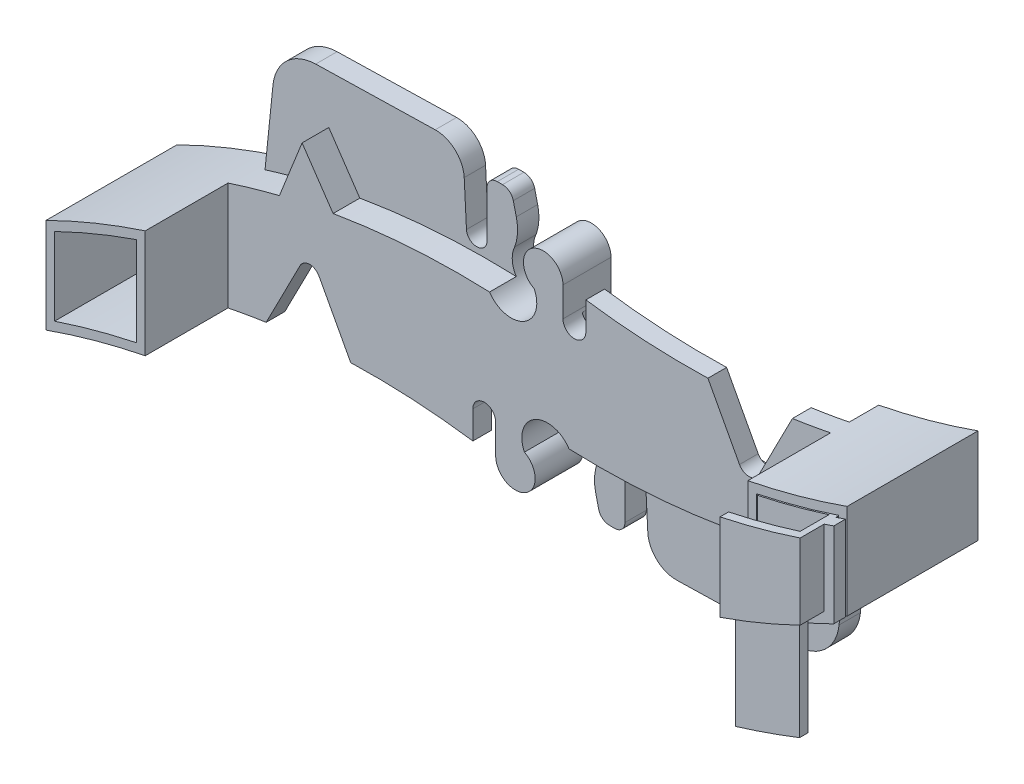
ISO-10303-21;
HEADER;
FILE_DESCRIPTION(('STEP AP214'),'2;1');
FILE_NAME('part.step','',(''),(''),'','','');
FILE_SCHEMA(('AUTOMOTIVE_DESIGN { 1 0 10303 214 1 1 1 1 }'));
ENDSEC;
DATA;
#1=APPLICATION_CONTEXT('core data for automotive mechanical design processes');
#2=APPLICATION_PROTOCOL_DEFINITION('international standard','automotive_design',2000,#1);
#3=PRODUCT_CONTEXT('',#1,'mechanical');
#4=PRODUCT('Part','Part','',(#3));
#5=PRODUCT_RELATED_PRODUCT_CATEGORY('part','',(#4));
#6=PRODUCT_DEFINITION_FORMATION('','',#4);
#7=PRODUCT_DEFINITION_CONTEXT('part definition',#1,'design');
#8=PRODUCT_DEFINITION('design','',#6,#7);
#9=PRODUCT_DEFINITION_SHAPE('','',#8);
#10=(LENGTH_UNIT() NAMED_UNIT(*) SI_UNIT(.MILLI.,.METRE.));
#11=(NAMED_UNIT(*) PLANE_ANGLE_UNIT() SI_UNIT($,.RADIAN.));
#12=(NAMED_UNIT(*) SI_UNIT($,.STERADIAN.) SOLID_ANGLE_UNIT());
#13=UNCERTAINTY_MEASURE_WITH_UNIT(LENGTH_MEASURE(1.E-05),#10,'distance_accuracy_value','');
#14=(GEOMETRIC_REPRESENTATION_CONTEXT(3) GLOBAL_UNCERTAINTY_ASSIGNED_CONTEXT((#13)) GLOBAL_UNIT_ASSIGNED_CONTEXT((#10,
#11,#12)) REPRESENTATION_CONTEXT('',''));
#15=CARTESIAN_POINT('',(0.,0.,0.));
#16=DIRECTION('',(0.,0.,1.));
#17=DIRECTION('',(1.,0.,0.));
#18=AXIS2_PLACEMENT_3D('',#15,#16,#17);
#19=CARTESIAN_POINT('',(-22.5253716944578,65.3414908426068,-4.));
#20=DIRECTION('',(0.,0.,1.));
#21=DIRECTION('',(1.,0.,0.));
#22=AXIS2_PLACEMENT_3D('',#19,#20,#21);
#23=CYLINDRICAL_SURFACE('',#22,68.9964644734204);
#24=DIRECTION('',(0.,0.,1.));
#25=VECTOR('',#24,1.);
#26=CARTESIAN_POINT('',(7.59999999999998,3.26916133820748,-4.));
#27=LINE('',#26,#25);
#28=CARTESIAN_POINT('',(7.59999999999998,3.26916133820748,-4.));
#29=VERTEX_POINT('',#28);
#30=CARTESIAN_POINT('',(7.59999999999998,3.26916133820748,0.149999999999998));
#31=VERTEX_POINT('',#30);
#32=EDGE_CURVE('E298',#29,#31,#27,.T.);
#33=ORIENTED_EDGE('',*,*,#32,.T.);
#34=CARTESIAN_POINT('',(-22.5253716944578,65.3414908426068,0.149999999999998));
#35=DIRECTION('',(0.,0.,-1.));
#36=DIRECTION('',(1.,0.,0.));
#37=AXIS2_PLACEMENT_3D('',#34,#35,#36);
#38=CIRCLE('',#37,68.9964644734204);
#39=CARTESIAN_POINT('',(0.0999999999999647,0.160169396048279,0.149999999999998));
#40=VERTEX_POINT('',#39);
#41=EDGE_CURVE('E205',#31,#40,#38,.T.);
#42=ORIENTED_EDGE('',*,*,#41,.T.);
#43=DIRECTION('',(0.,0.,1.));
#44=VECTOR('',#43,1.);
#45=CARTESIAN_POINT('',(0.1,0.16016939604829,-4.));
#46=LINE('',#45,#44);
#47=CARTESIAN_POINT('',(0.1,0.16016939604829,-4.));
#48=VERTEX_POINT('',#47);
#49=EDGE_CURVE('E285',#48,#40,#46,.T.);
#50=ORIENTED_EDGE('',*,*,#49,.F.);
#51=CARTESIAN_POINT('',(-22.5253716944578,65.3414908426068,-4.));
#52=DIRECTION('',(0.,0.,1.));
#53=DIRECTION('',(1.,0.,0.));
#54=AXIS2_PLACEMENT_3D('',#51,#52,#53);
#55=CIRCLE('',#54,68.9964644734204);
#56=EDGE_CURVE('E272',#48,#29,#55,.T.);
#57=ORIENTED_EDGE('',*,*,#56,.T.);
#58=EDGE_LOOP('',(#33,#42,#50,#57));
#59=FACE_BOUND('',#58,.T.);
#60=ADVANCED_FACE('F51',(#59),#23,.T.);
#61=CARTESIAN_POINT('',(7.59999999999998,3.26916133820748,-4.));
#62=DIRECTION('',(1.,0.,0.));
#63=DIRECTION('',(0.,1.,0.));
#64=AXIS2_PLACEMENT_3D('',#61,#62,#63);
#65=PLANE('',#64);
#66=DIRECTION('',(0.,0.,1.));
#67=VECTOR('',#66,1.);
#68=CARTESIAN_POINT('',(7.6,10.340055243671,-4.));
#69=LINE('',#68,#67);
#70=CARTESIAN_POINT('',(7.6,10.340055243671,-4.));
#71=VERTEX_POINT('',#70);
#72=CARTESIAN_POINT('',(7.59999999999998,10.340055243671,0.149999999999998));
#73=VERTEX_POINT('',#72);
#74=EDGE_CURVE('E294',#71,#73,#69,.T.);
#75=ORIENTED_EDGE('',*,*,#74,.T.);
#76=DIRECTION('',(0.,-1.,0.));
#77=VECTOR('',#76,1.);
#78=CARTESIAN_POINT('',(7.59999999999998,3.26916133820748,0.149999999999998));
#79=LINE('',#78,#77);
#80=EDGE_CURVE('E202',#73,#31,#79,.T.);
#81=ORIENTED_EDGE('',*,*,#80,.T.);
#82=ORIENTED_EDGE('',*,*,#32,.F.);
#83=DIRECTION('',(0.,1.,0.));
#84=VECTOR('',#83,1.);
#85=CARTESIAN_POINT('',(7.59999999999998,3.26916133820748,-4.));
#86=LINE('',#85,#84);
#87=EDGE_CURVE('E275',#29,#71,#86,.T.);
#88=ORIENTED_EDGE('',*,*,#87,.T.);
#89=EDGE_LOOP('',(#75,#81,#82,#88));
#90=FACE_BOUND('',#89,.T.);
#91=ADVANCED_FACE('F333',(#90),#65,.T.);
#92=CARTESIAN_POINT('',(0.1,8.30348373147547,-4.));
#93=DIRECTION('',(-1.,0.,0.));
#94=DIRECTION('',(0.,0.,1.));
#95=AXIS2_PLACEMENT_3D('',#92,#93,#94);
#96=PLANE('',#95);
#97=DIRECTION('',(0.,0.,1.));
#98=VECTOR('',#97,1.);
#99=CARTESIAN_POINT('',(0.0999999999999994,1.0075936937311,0.));
#100=LINE('',#99,#98);
#101=CARTESIAN_POINT('',(0.0999999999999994,1.00759369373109,0.));
#102=VERTEX_POINT('',#101);
#103=CARTESIAN_POINT('',(0.0999999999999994,1.00759369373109,2.7));
#104=VERTEX_POINT('',#103);
#105=EDGE_CURVE('E12',#102,#104,#100,.T.);
#106=ORIENTED_EDGE('',*,*,#105,.F.);
#107=DIRECTION('',(0.,1.,0.));
#108=VECTOR('',#107,1.);
#109=CARTESIAN_POINT('',(0.1,8.30348373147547,0.));
#110=LINE('',#109,#108);
#111=CARTESIAN_POINT('',(0.100000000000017,8.30348373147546,0.));
#112=VERTEX_POINT('',#111);
#113=EDGE_CURVE('E257',#102,#112,#110,.T.);
#114=ORIENTED_EDGE('',*,*,#113,.T.);
#115=DIRECTION('',(0.,0.,1.));
#116=VECTOR('',#115,1.);
#117=CARTESIAN_POINT('',(0.100000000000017,8.30348373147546,-4.));
#118=LINE('',#117,#116);
#119=CARTESIAN_POINT('',(0.100000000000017,8.30348373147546,-4.));
#120=VERTEX_POINT('',#119);
#121=EDGE_CURVE('E290',#120,#112,#118,.T.);
#122=ORIENTED_EDGE('',*,*,#121,.F.);
#123=DIRECTION('',(0.,-1.,0.));
#124=VECTOR('',#123,1.);
#125=CARTESIAN_POINT('',(0.1,8.30348373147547,-4.));
#126=LINE('',#125,#124);
#127=EDGE_CURVE('E281',#120,#48,#126,.T.);
#128=ORIENTED_EDGE('',*,*,#127,.T.);
#129=ORIENTED_EDGE('',*,*,#49,.T.);
#130=DIRECTION('',(0.,-1.,0.));
#131=VECTOR('',#130,1.);
#132=CARTESIAN_POINT('',(0.1,0.16016939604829,0.149999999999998));
#133=LINE('',#132,#131);
#134=CARTESIAN_POINT('',(0.100000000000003,-0.791770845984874,0.149999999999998));
#135=VERTEX_POINT('',#134);
#136=EDGE_CURVE('E183',#40,#135,#133,.T.);
#137=ORIENTED_EDGE('',*,*,#136,.T.);
#138=DIRECTION('',(0.,0.,1.));
#139=VECTOR('',#138,1.);
#140=CARTESIAN_POINT('',(0.100000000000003,-0.791770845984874,0.149999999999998));
#141=LINE('',#140,#139);
#142=CARTESIAN_POINT('',(0.100000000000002,-0.791770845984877,1.25));
#143=VERTEX_POINT('',#142);
#144=EDGE_CURVE('E195',#135,#143,#141,.T.);
#145=ORIENTED_EDGE('',*,*,#144,.T.);
#146=DIRECTION('',(0.,-1.,0.));
#147=VECTOR('',#146,1.);
#148=CARTESIAN_POINT('',(0.1,0.16016939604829,1.25));
#149=LINE('',#148,#147);
#150=CARTESIAN_POINT('',(0.100000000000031,-9.40575204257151,1.25));
#151=VERTEX_POINT('',#150);
#152=EDGE_CURVE('E216',#143,#151,#149,.T.);
#153=ORIENTED_EDGE('',*,*,#152,.T.);
#154=DIRECTION('',(0.,0.,-1.));
#155=VECTOR('',#154,1.);
#156=CARTESIAN_POINT('',(0.100000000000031,-9.40575204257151,2.05));
#157=LINE('',#156,#155);
#158=CARTESIAN_POINT('',(0.100000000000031,-9.40575204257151,2.05));
#159=VERTEX_POINT('',#158);
#160=EDGE_CURVE('E240',#159,#151,#157,.T.);
#161=ORIENTED_EDGE('',*,*,#160,.F.);
#162=DIRECTION('',(0.,-1.,0.));
#163=VECTOR('',#162,1.);
#164=CARTESIAN_POINT('',(0.1,0.16016939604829,2.05));
#165=LINE('',#164,#163);
#166=CARTESIAN_POINT('',(0.1,0.16016939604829,2.05));
#167=VERTEX_POINT('',#166);
#168=EDGE_CURVE('E221',#167,#159,#165,.T.);
#169=ORIENTED_EDGE('',*,*,#168,.F.);
#170=CARTESIAN_POINT('',(0.1,0.16016939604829,3.5));
#171=VERTEX_POINT('',#170);
#172=EDGE_CURVE('E289',#167,#171,#46,.T.);
#173=ORIENTED_EDGE('',*,*,#172,.T.);
#174=DIRECTION('',(0.,-1.,0.));
#175=VECTOR('',#174,1.);
#176=CARTESIAN_POINT('',(0.1,8.30348373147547,3.5));
#177=LINE('',#176,#175);
#178=CARTESIAN_POINT('',(0.100000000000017,8.30348373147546,3.5));
#179=VERTEX_POINT('',#178);
#180=EDGE_CURVE('E269',#179,#171,#177,.T.);
#181=ORIENTED_EDGE('',*,*,#180,.F.);
#182=CARTESIAN_POINT('',(0.100000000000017,8.30348373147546,2.7));
#183=VERTEX_POINT('',#182);
#184=EDGE_CURVE('E293',#183,#179,#118,.T.);
#185=ORIENTED_EDGE('',*,*,#184,.F.);
#186=DIRECTION('',(0.,1.,0.));
#187=VECTOR('',#186,1.);
#188=CARTESIAN_POINT('',(0.1,8.30348373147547,2.7));
#189=LINE('',#188,#187);
#190=EDGE_CURVE('E74',#104,#183,#189,.T.);
#191=ORIENTED_EDGE('',*,*,#190,.F.);
#192=EDGE_LOOP('',(#106,#114,#122,#128,#129,#137,#145,#153,#161,#169,#173,#181,#185,#191));
#193=FACE_BOUND('',#192,.T.);
#194=ADVANCED_FACE('F313',(#193),#96,.T.);
#195=CARTESIAN_POINT('',(-14.2272207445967,75.8940232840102,-4.));
#196=DIRECTION('',(0.,0.,1.));
#197=DIRECTION('',(1.,0.,0.));
#198=AXIS2_PLACEMENT_3D('',#195,#196,#197);
#199=CYLINDRICAL_SURFACE('',#198,69.0923316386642);
#200=ORIENTED_EDGE('',*,*,#121,.T.);
#201=CARTESIAN_POINT('',(-14.2272207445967,75.8940232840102,0.));
#202=DIRECTION('',(0.,0.,1.));
#203=DIRECTION('',(1.,0.,0.));
#204=AXIS2_PLACEMENT_3D('',#201,#202,#203);
#205=CIRCLE('',#204,69.0923316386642);
#206=CARTESIAN_POINT('',(6.79999999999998,10.0790836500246,0.));
#207=VERTEX_POINT('',#206);
#208=EDGE_CURVE('E59',#112,#207,#205,.T.);
#209=ORIENTED_EDGE('',*,*,#208,.T.);
#210=DIRECTION('',(0.,0.,1.));
#211=VECTOR('',#210,1.);
#212=CARTESIAN_POINT('',(6.79999999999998,10.0790836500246,-4.));
#213=LINE('',#212,#211);
#214=CARTESIAN_POINT('',(6.79999999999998,10.0790836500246,2.7));
#215=VERTEX_POINT('',#214);
#216=EDGE_CURVE('E302',#215,#207,#213,.F.);
#217=ORIENTED_EDGE('',*,*,#216,.F.);
#218=CARTESIAN_POINT('',(-14.2272207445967,75.8940232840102,2.7));
#219=DIRECTION('',(0.,0.,1.));
#220=DIRECTION('',(1.,0.,0.));
#221=AXIS2_PLACEMENT_3D('',#218,#219,#220);
#222=CIRCLE('',#221,69.0923316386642);
#223=EDGE_CURVE('E288',#183,#215,#222,.T.);
#224=ORIENTED_EDGE('',*,*,#223,.F.);
#225=ORIENTED_EDGE('',*,*,#184,.T.);
#226=CARTESIAN_POINT('',(-14.2272207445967,75.8940232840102,3.5));
#227=DIRECTION('',(0.,0.,-1.));
#228=DIRECTION('',(1.,0.,0.));
#229=AXIS2_PLACEMENT_3D('',#226,#227,#228);
#230=CIRCLE('',#229,69.0923316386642);
#231=CARTESIAN_POINT('',(7.6,10.340055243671,3.5));
#232=VERTEX_POINT('',#231);
#233=EDGE_CURVE('E266',#232,#179,#230,.T.);
#234=ORIENTED_EDGE('',*,*,#233,.F.);
#235=CARTESIAN_POINT('',(7.59999999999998,10.340055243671,1.25));
#236=VERTEX_POINT('',#235);
#237=EDGE_CURVE('E297',#236,#232,#69,.T.);
#238=ORIENTED_EDGE('',*,*,#237,.F.);
#239=CARTESIAN_POINT('',(-14.2272207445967,75.8940232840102,1.25));
#240=DIRECTION('',(0.,0.,-1.));
#241=DIRECTION('',(1.,0.,0.));
#242=AXIS2_PLACEMENT_3D('',#239,#240,#241);
#243=CIRCLE('',#242,69.0923316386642);
#244=CARTESIAN_POINT('',(8.5,10.6466192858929,1.25));
#245=VERTEX_POINT('',#244);
#246=EDGE_CURVE('E212',#245,#236,#243,.T.);
#247=ORIENTED_EDGE('',*,*,#246,.F.);
#248=DIRECTION('',(0.,0.,1.));
#249=VECTOR('',#248,1.);
#250=CARTESIAN_POINT('',(8.5,10.6466192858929,0.149999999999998));
#251=LINE('',#250,#249);
#252=CARTESIAN_POINT('',(8.5,10.6466192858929,0.149999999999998));
#253=VERTEX_POINT('',#252);
#254=EDGE_CURVE('E182',#253,#245,#251,.T.);
#255=ORIENTED_EDGE('',*,*,#254,.F.);
#256=CARTESIAN_POINT('',(-14.2272207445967,75.8940232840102,0.149999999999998));
#257=DIRECTION('',(0.,0.,-1.));
#258=DIRECTION('',(1.,0.,0.));
#259=AXIS2_PLACEMENT_3D('',#256,#257,#258);
#260=CIRCLE('',#259,69.0923316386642);
#261=EDGE_CURVE('E192',#253,#73,#260,.T.);
#262=ORIENTED_EDGE('',*,*,#261,.T.);
#263=ORIENTED_EDGE('',*,*,#74,.F.);
#264=CARTESIAN_POINT('',(-14.2272207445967,75.8940232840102,-4.));
#265=DIRECTION('',(0.,0.,-1.));
#266=DIRECTION('',(1.,0.,0.));
#267=AXIS2_PLACEMENT_3D('',#264,#265,#266);
#268=CIRCLE('',#267,69.0923316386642);
#269=EDGE_CURVE('E278',#71,#120,#268,.T.);
#270=ORIENTED_EDGE('',*,*,#269,.T.);
#271=EDGE_LOOP('',(#200,#209,#217,#224,#225,#234,#238,#247,#255,#262,#263,#270));
#272=FACE_BOUND('',#271,.T.);
#273=ADVANCED_FACE('F306',(#272),#199,.F.);
#274=CARTESIAN_POINT('',(-22.5253716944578,65.3414908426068,1.25));
#275=DIRECTION('',(0.,0.,-1.));
#276=DIRECTION('',(1.,0.,0.));
#277=AXIS2_PLACEMENT_3D('',#274,#275,#276);
#278=CIRCLE('',#277,68.9964644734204);
#279=CARTESIAN_POINT('',(7.59999999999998,3.26916133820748,1.25));
#280=VERTEX_POINT('',#279);
#281=CARTESIAN_POINT('',(6.1,2.56330828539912,1.25));
#282=VERTEX_POINT('',#281);
#283=EDGE_CURVE('E196',#280,#282,#278,.T.);
#284=ORIENTED_EDGE('',*,*,#283,.F.);
#285=CARTESIAN_POINT('',(7.59999999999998,3.26916133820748,3.5));
#286=VERTEX_POINT('',#285);
#287=EDGE_CURVE('E284',#280,#286,#27,.T.);
#288=ORIENTED_EDGE('',*,*,#287,.T.);
#289=CARTESIAN_POINT('',(-22.5253716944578,65.3414908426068,3.5));
#290=DIRECTION('',(0.,0.,1.));
#291=DIRECTION('',(1.,0.,0.));
#292=AXIS2_PLACEMENT_3D('',#289,#290,#291);
#293=CIRCLE('',#292,68.9964644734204);
#294=EDGE_CURVE('E260',#171,#286,#293,.T.);
#295=ORIENTED_EDGE('',*,*,#294,.F.);
#296=ORIENTED_EDGE('',*,*,#172,.F.);
#297=CARTESIAN_POINT('',(-22.5253716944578,65.3414908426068,2.05));
#298=DIRECTION('',(0.,0.,-1.));
#299=DIRECTION('',(1.,0.,0.));
#300=AXIS2_PLACEMENT_3D('',#297,#298,#299);
#301=CIRCLE('',#300,68.9964644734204);
#302=CARTESIAN_POINT('',(6.1,2.56330828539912,2.05));
#303=VERTEX_POINT('',#302);
#304=EDGE_CURVE('E218',#303,#167,#301,.T.);
#305=ORIENTED_EDGE('',*,*,#304,.F.);
#306=DIRECTION('',(0.,0.,-1.));
#307=VECTOR('',#306,1.);
#308=CARTESIAN_POINT('',(6.1,2.56330828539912,2.05));
#309=LINE('',#308,#307);
#310=EDGE_CURVE('E228',#303,#282,#309,.T.);
#311=ORIENTED_EDGE('',*,*,#310,.T.);
#312=EDGE_LOOP('',(#284,#288,#295,#296,#305,#311));
#313=FACE_BOUND('',#312,.T.);
#314=ADVANCED_FACE('F53',(#313),#23,.T.);
#315=DIRECTION('',(0.,-1.,0.));
#316=VECTOR('',#315,1.);
#317=CARTESIAN_POINT('',(7.59999999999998,3.26916133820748,1.25));
#318=LINE('',#317,#316);
#319=EDGE_CURVE('E198',#236,#280,#318,.T.);
#320=ORIENTED_EDGE('',*,*,#319,.F.);
#321=ORIENTED_EDGE('',*,*,#237,.T.);
#322=DIRECTION('',(0.,1.,0.));
#323=VECTOR('',#322,1.);
#324=CARTESIAN_POINT('',(7.59999999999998,3.26916133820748,3.5));
#325=LINE('',#324,#323);
#326=EDGE_CURVE('E263',#286,#232,#325,.T.);
#327=ORIENTED_EDGE('',*,*,#326,.F.);
#328=ORIENTED_EDGE('',*,*,#287,.F.);
#329=EDGE_LOOP('',(#320,#321,#327,#328));
#330=FACE_BOUND('',#329,.T.);
#331=ADVANCED_FACE('F339',(#330),#65,.T.);
#332=CARTESIAN_POINT('',(-22.5253716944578,65.3414908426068,-4.));
#333=DIRECTION('',(0.,0.,1.));
#334=DIRECTION('',(1.,0.,0.));
#335=AXIS2_PLACEMENT_3D('',#332,#333,#334);
#336=PLANE('',#335);
#337=ORIENTED_EDGE('',*,*,#56,.F.);
#338=ORIENTED_EDGE('',*,*,#127,.F.);
#339=ORIENTED_EDGE('',*,*,#269,.F.);
#340=ORIENTED_EDGE('',*,*,#87,.F.);
#341=EDGE_LOOP('',(#337,#338,#339,#340));
#342=FACE_BOUND('',#341,.T.);
#343=ADVANCED_FACE('F346',(#342),#336,.F.);
#344=CARTESIAN_POINT('',(-22.5253716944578,65.3414908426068,3.5));
#345=DIRECTION('',(0.,0.,1.));
#346=DIRECTION('',(1.,0.,0.));
#347=AXIS2_PLACEMENT_3D('',#344,#345,#346);
#348=PLANE('',#347);
#349=ORIENTED_EDGE('',*,*,#294,.T.);
#350=ORIENTED_EDGE('',*,*,#326,.T.);
#351=ORIENTED_EDGE('',*,*,#233,.T.);
#352=ORIENTED_EDGE('',*,*,#180,.T.);
#353=EDGE_LOOP('',(#349,#350,#351,#352));
#354=FACE_BOUND('',#353,.T.);
#355=ADVANCED_FACE('F329',(#354),#348,.T.);
#356=CARTESIAN_POINT('',(-22.5253716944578,65.3414908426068,0.));
#357=DIRECTION('',(0.,0.,1.));
#358=DIRECTION('',(1.,0.,0.));
#359=AXIS2_PLACEMENT_3D('',#356,#357,#358);
#360=CYLINDRICAL_SURFACE('',#359,68.1964644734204);
#361=ORIENTED_EDGE('',*,*,#105,.T.);
#362=CARTESIAN_POINT('',(-22.5253716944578,65.3414908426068,2.7));
#363=DIRECTION('',(0.,0.,1.));
#364=DIRECTION('',(1.,0.,0.));
#365=AXIS2_PLACEMENT_3D('',#362,#363,#364);
#366=CIRCLE('',#365,68.1964644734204);
#367=CARTESIAN_POINT('',(6.79999999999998,3.77217753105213,2.7));
#368=VERTEX_POINT('',#367);
#369=EDGE_CURVE('E243',#104,#368,#366,.T.);
#370=ORIENTED_EDGE('',*,*,#369,.T.);
#371=DIRECTION('',(0.,0.,1.));
#372=VECTOR('',#371,1.);
#373=CARTESIAN_POINT('',(6.79999999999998,3.77217753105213,0.));
#374=LINE('',#373,#372);
#375=CARTESIAN_POINT('',(6.79999999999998,3.77217753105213,0.));
#376=VERTEX_POINT('',#375);
#377=EDGE_CURVE('E250',#376,#368,#374,.T.);
#378=ORIENTED_EDGE('',*,*,#377,.F.);
#379=CARTESIAN_POINT('',(-22.5253716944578,65.3414908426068,0.));
#380=DIRECTION('',(0.,0.,1.));
#381=DIRECTION('',(1.,0.,0.));
#382=AXIS2_PLACEMENT_3D('',#379,#380,#381);
#383=CIRCLE('',#382,68.1964644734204);
#384=EDGE_CURVE('E244',#102,#376,#383,.T.);
#385=ORIENTED_EDGE('',*,*,#384,.F.);
#386=EDGE_LOOP('',(#361,#370,#378,#385));
#387=FACE_BOUND('',#386,.T.);
#388=ADVANCED_FACE('F316',(#387),#360,.F.);
#389=CARTESIAN_POINT('',(6.79999999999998,3.77217753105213,0.));
#390=DIRECTION('',(1.,0.,0.));
#391=DIRECTION('',(0.,0.,-1.));
#392=AXIS2_PLACEMENT_3D('',#389,#390,#391);
#393=PLANE('',#392);
#394=ORIENTED_EDGE('',*,*,#216,.T.);
#395=DIRECTION('',(0.,1.,0.));
#396=VECTOR('',#395,1.);
#397=CARTESIAN_POINT('',(6.79999999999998,3.77217753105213,0.));
#398=LINE('',#397,#396);
#399=EDGE_CURVE('E246',#376,#207,#398,.T.);
#400=ORIENTED_EDGE('',*,*,#399,.F.);
#401=ORIENTED_EDGE('',*,*,#377,.T.);
#402=DIRECTION('',(0.,1.,0.));
#403=VECTOR('',#402,1.);
#404=CARTESIAN_POINT('',(6.79999999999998,3.77217753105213,2.7));
#405=LINE('',#404,#403);
#406=EDGE_CURVE('E247',#368,#215,#405,.T.);
#407=ORIENTED_EDGE('',*,*,#406,.T.);
#408=EDGE_LOOP('',(#394,#400,#401,#407));
#409=FACE_BOUND('',#408,.T.);
#410=ADVANCED_FACE('F321',(#409),#393,.F.);
#411=CARTESIAN_POINT('',(-22.5253716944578,65.3414908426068,0.));
#412=DIRECTION('',(0.,0.,1.));
#413=DIRECTION('',(1.,0.,0.));
#414=AXIS2_PLACEMENT_3D('',#411,#412,#413);
#415=PLANE('',#414);
#416=ORIENTED_EDGE('',*,*,#384,.T.);
#417=ORIENTED_EDGE('',*,*,#399,.T.);
#418=ORIENTED_EDGE('',*,*,#208,.F.);
#419=ORIENTED_EDGE('',*,*,#113,.F.);
#420=EDGE_LOOP('',(#416,#417,#418,#419));
#421=FACE_BOUND('',#420,.T.);
#422=ADVANCED_FACE('F308',(#421),#415,.T.);
#423=CARTESIAN_POINT('',(-22.5253716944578,65.3414908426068,2.7));
#424=DIRECTION('',(0.,0.,1.));
#425=DIRECTION('',(1.,0.,0.));
#426=AXIS2_PLACEMENT_3D('',#423,#424,#425);
#427=PLANE('',#426);
#428=ORIENTED_EDGE('',*,*,#190,.T.);
#429=ORIENTED_EDGE('',*,*,#223,.T.);
#430=ORIENTED_EDGE('',*,*,#406,.F.);
#431=ORIENTED_EDGE('',*,*,#369,.F.);
#432=EDGE_LOOP('',(#428,#429,#430,#431));
#433=FACE_BOUND('',#432,.T.);
#434=ADVANCED_FACE('F319',(#433),#427,.F.);
#435=CARTESIAN_POINT('',(-22.5253716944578,65.3414908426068,2.05));
#436=DIRECTION('',(0.,0.,-1.));
#437=DIRECTION('',(-1.,0.,0.));
#438=AXIS2_PLACEMENT_3D('',#435,#436,#437);
#439=CYLINDRICAL_SURFACE('',#438,78.0964644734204);
#440=CARTESIAN_POINT('',(-22.5253716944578,65.3414908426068,1.25));
#441=DIRECTION('',(0.,0.,1.));
#442=DIRECTION('',(1.,0.,0.));
#443=AXIS2_PLACEMENT_3D('',#440,#441,#442);
#444=CIRCLE('',#443,78.0964644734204);
#445=CARTESIAN_POINT('',(6.1,-7.31968075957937,1.25));
#446=VERTEX_POINT('',#445);
#447=EDGE_CURVE('E230',#151,#446,#444,.T.);
#448=ORIENTED_EDGE('',*,*,#447,.T.);
#449=DIRECTION('',(0.,0.,-1.));
#450=VECTOR('',#449,1.);
#451=CARTESIAN_POINT('',(6.1,-7.31968075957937,2.05));
#452=LINE('',#451,#450);
#453=CARTESIAN_POINT('',(6.1,-7.31968075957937,2.05));
#454=VERTEX_POINT('',#453);
#455=EDGE_CURVE('E237',#454,#446,#452,.T.);
#456=ORIENTED_EDGE('',*,*,#455,.F.);
#457=CARTESIAN_POINT('',(-22.5253716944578,65.3414908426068,2.05));
#458=DIRECTION('',(0.,0.,1.));
#459=DIRECTION('',(1.,0.,0.));
#460=AXIS2_PLACEMENT_3D('',#457,#458,#459);
#461=CIRCLE('',#460,78.0964644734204);
#462=EDGE_CURVE('E224',#159,#454,#461,.T.);
#463=ORIENTED_EDGE('',*,*,#462,.F.);
#464=ORIENTED_EDGE('',*,*,#160,.T.);
#465=EDGE_LOOP('',(#448,#456,#463,#464));
#466=FACE_BOUND('',#465,.T.);
#467=ADVANCED_FACE('F378',(#466),#439,.T.);
#468=CARTESIAN_POINT('',(6.1,2.56330828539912,2.05));
#469=DIRECTION('',(-1.,0.,0.));
#470=DIRECTION('',(0.,-1.,0.));
#471=AXIS2_PLACEMENT_3D('',#468,#469,#470);
#472=PLANE('',#471);
#473=DIRECTION('',(0.,1.,0.));
#474=VECTOR('',#473,1.);
#475=CARTESIAN_POINT('',(6.1,2.56330828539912,1.25));
#476=LINE('',#475,#474);
#477=CARTESIAN_POINT('',(6.1,1.57548233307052,1.25));
#478=VERTEX_POINT('',#477);
#479=EDGE_CURVE('E222',#446,#478,#476,.T.);
#480=ORIENTED_EDGE('',*,*,#479,.T.);
#481=EDGE_CURVE('E232',#478,#282,#476,.T.);
#482=ORIENTED_EDGE('',*,*,#481,.T.);
#483=ORIENTED_EDGE('',*,*,#310,.F.);
#484=DIRECTION('',(0.,1.,0.));
#485=VECTOR('',#484,1.);
#486=CARTESIAN_POINT('',(6.1,2.56330828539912,2.05));
#487=LINE('',#486,#485);
#488=EDGE_CURVE('E226',#454,#303,#487,.T.);
#489=ORIENTED_EDGE('',*,*,#488,.F.);
#490=ORIENTED_EDGE('',*,*,#455,.T.);
#491=EDGE_LOOP('',(#480,#482,#483,#489,#490));
#492=FACE_BOUND('',#491,.T.);
#493=ADVANCED_FACE('F370',(#492),#472,.F.);
#494=CARTESIAN_POINT('',(-22.5253716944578,65.3414908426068,2.05));
#495=DIRECTION('',(0.,0.,1.));
#496=DIRECTION('',(1.,0.,0.));
#497=AXIS2_PLACEMENT_3D('',#494,#495,#496);
#498=PLANE('',#497);
#499=ORIENTED_EDGE('',*,*,#304,.T.);
#500=ORIENTED_EDGE('',*,*,#168,.T.);
#501=ORIENTED_EDGE('',*,*,#462,.T.);
#502=ORIENTED_EDGE('',*,*,#488,.T.);
#503=EDGE_LOOP('',(#499,#500,#501,#502));
#504=FACE_BOUND('',#503,.T.);
#505=ADVANCED_FACE('F366',(#504),#498,.T.);
#506=CARTESIAN_POINT('',(-22.5253716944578,65.3414908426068,1.25));
#507=DIRECTION('',(0.,0.,1.));
#508=DIRECTION('',(1.,0.,0.));
#509=AXIS2_PLACEMENT_3D('',#506,#507,#508);
#510=PLANE('',#509);
#511=ORIENTED_EDGE('',*,*,#152,.F.);
#512=CARTESIAN_POINT('',(-22.5253716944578,65.3414908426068,1.25));
#513=DIRECTION('',(0.,0.,1.));
#514=DIRECTION('',(1.,0.,0.));
#515=AXIS2_PLACEMENT_3D('',#512,#513,#514);
#516=CIRCLE('',#515,69.8964644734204);
#517=EDGE_CURVE('E66',#143,#478,#516,.T.);
#518=ORIENTED_EDGE('',*,*,#517,.T.);
#519=ORIENTED_EDGE('',*,*,#479,.F.);
#520=ORIENTED_EDGE('',*,*,#447,.F.);
#521=EDGE_LOOP('',(#511,#518,#519,#520));
#522=FACE_BOUND('',#521,.T.);
#523=ADVANCED_FACE('F375',(#522),#510,.F.);
#524=CARTESIAN_POINT('',(-22.5253716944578,65.3414908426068,1.25));
#525=DIRECTION('',(0.,0.,1.));
#526=DIRECTION('',(1.,0.,0.));
#527=AXIS2_PLACEMENT_3D('',#524,#525,#526);
#528=PLANE('',#527);
#529=ORIENTED_EDGE('',*,*,#481,.F.);
#530=CARTESIAN_POINT('',(8.49999999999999,2.70809673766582,1.25));
#531=VERTEX_POINT('',#530);
#532=EDGE_CURVE('E210',#478,#531,#516,.T.);
#533=ORIENTED_EDGE('',*,*,#532,.T.);
#534=DIRECTION('',(0.,1.,0.));
#535=VECTOR('',#534,1.);
#536=CARTESIAN_POINT('',(8.49999999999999,2.70809673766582,1.25));
#537=LINE('',#536,#535);
#538=EDGE_CURVE('E180',#531,#245,#537,.T.);
#539=ORIENTED_EDGE('',*,*,#538,.T.);
#540=ORIENTED_EDGE('',*,*,#246,.T.);
#541=ORIENTED_EDGE('',*,*,#319,.T.);
#542=ORIENTED_EDGE('',*,*,#283,.T.);
#543=EDGE_LOOP('',(#529,#533,#539,#540,#541,#542));
#544=FACE_BOUND('',#543,.T.);
#545=ADVANCED_FACE('F372',(#544),#528,.T.);
#546=CARTESIAN_POINT('',(-22.5253716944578,65.3414908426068,0.149999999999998));
#547=DIRECTION('',(0.,0.,1.));
#548=DIRECTION('',(1.,0.,0.));
#549=AXIS2_PLACEMENT_3D('',#546,#547,#548);
#550=CYLINDRICAL_SURFACE('',#549,69.8964644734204);
#551=ORIENTED_EDGE('',*,*,#517,.F.);
#552=ORIENTED_EDGE('',*,*,#144,.F.);
#553=CARTESIAN_POINT('',(-22.5253716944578,65.3414908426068,0.149999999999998));
#554=DIRECTION('',(0.,0.,1.));
#555=DIRECTION('',(1.,0.,0.));
#556=AXIS2_PLACEMENT_3D('',#553,#554,#555);
#557=CIRCLE('',#556,69.8964644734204);
#558=CARTESIAN_POINT('',(8.49999999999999,2.70809673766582,0.149999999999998));
#559=VERTEX_POINT('',#558);
#560=EDGE_CURVE('E189',#135,#559,#557,.T.);
#561=ORIENTED_EDGE('',*,*,#560,.T.);
#562=DIRECTION('',(0.,0.,1.));
#563=VECTOR('',#562,1.);
#564=CARTESIAN_POINT('',(8.49999999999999,2.70809673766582,0.149999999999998));
#565=LINE('',#564,#563);
#566=EDGE_CURVE('E175',#559,#531,#565,.T.);
#567=ORIENTED_EDGE('',*,*,#566,.T.);
#568=ORIENTED_EDGE('',*,*,#532,.F.);
#569=EDGE_LOOP('',(#551,#552,#561,#567,#568));
#570=FACE_BOUND('',#569,.T.);
#571=ADVANCED_FACE('F194',(#570),#550,.T.);
#572=CARTESIAN_POINT('',(8.49999999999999,2.70809673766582,0.149999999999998));
#573=DIRECTION('',(1.,0.,0.));
#574=DIRECTION('',(0.,1.,0.));
#575=AXIS2_PLACEMENT_3D('',#572,#573,#574);
#576=PLANE('',#575);
#577=ORIENTED_EDGE('',*,*,#538,.F.);
#578=ORIENTED_EDGE('',*,*,#566,.F.);
#579=DIRECTION('',(0.,1.,0.));
#580=VECTOR('',#579,1.);
#581=CARTESIAN_POINT('',(8.49999999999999,2.70809673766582,0.149999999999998));
#582=LINE('',#581,#580);
#583=EDGE_CURVE('E178',#559,#253,#582,.T.);
#584=ORIENTED_EDGE('',*,*,#583,.T.);
#585=ORIENTED_EDGE('',*,*,#254,.T.);
#586=EDGE_LOOP('',(#577,#578,#584,#585));
#587=FACE_BOUND('',#586,.T.);
#588=ADVANCED_FACE('F177',(#587),#576,.T.);
#589=CARTESIAN_POINT('',(-22.5253716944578,65.3414908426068,0.149999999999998));
#590=DIRECTION('',(0.,0.,1.));
#591=DIRECTION('',(1.,0.,0.));
#592=AXIS2_PLACEMENT_3D('',#589,#590,#591);
#593=PLANE('',#592);
#594=ORIENTED_EDGE('',*,*,#560,.F.);
#595=ORIENTED_EDGE('',*,*,#136,.F.);
#596=ORIENTED_EDGE('',*,*,#41,.F.);
#597=ORIENTED_EDGE('',*,*,#80,.F.);
#598=ORIENTED_EDGE('',*,*,#261,.F.);
#599=ORIENTED_EDGE('',*,*,#583,.F.);
#600=EDGE_LOOP('',(#594,#595,#596,#597,#598,#599));
#601=FACE_BOUND('',#600,.T.);
#602=ADVANCED_FACE('F188',(#601),#593,.F.);
#603=CLOSED_SHELL('',(#60,#91,#194,#273,#314,#331,#343,#355,#388,#410,#422,#434,#467,#493,#505,
#523,#545,#571,#588,#602));
#604=MANIFOLD_SOLID_BREP('B2',#603);
#605=CARTESIAN_POINT('',(-35.4641054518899,-65.3414908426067,-7.75));
#606=DIRECTION('',(0.,0.,1.));
#607=DIRECTION('',(1.,0.,0.));
#608=AXIS2_PLACEMENT_3D('',#605,#606,#607);
#609=PLANE('',#608);
#610=CARTESIAN_POINT('',(-35.4641054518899,-65.3414908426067,-7.75));
#611=DIRECTION('',(0.,0.,1.));
#612=DIRECTION('',(1.,0.,0.));
#613=AXIS2_PLACEMENT_3D('',#610,#611,#612);
#614=CIRCLE('',#613,69.8964644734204);
#615=CARTESIAN_POINT('',(-52.3919489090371,2.47417004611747,-7.75));
#616=VERTEX_POINT('',#615);
#617=CARTESIAN_POINT('',(-57.2,1.08942540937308,-7.75));
#618=VERTEX_POINT('',#617);
#619=EDGE_CURVE('E1346',#616,#618,#614,.T.);
#620=ORIENTED_EDGE('',*,*,#619,.T.);
#621=DIRECTION('',(0.,-1.,0.));
#622=VECTOR('',#621,1.);
#623=CARTESIAN_POINT('',(-57.1999999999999,-65.3414908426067,-7.75));
#624=LINE('',#623,#622);
#625=CARTESIAN_POINT('',(-57.2,-9.03879804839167,-7.75));
#626=VERTEX_POINT('',#625);
#627=EDGE_CURVE('E1123',#618,#626,#624,.T.);
#628=ORIENTED_EDGE('',*,*,#627,.T.);
#629=CARTESIAN_POINT('',(-43.7622564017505,-75.8940232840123,-7.75));
#630=DIRECTION('',(0.,0.,-1.));
#631=DIRECTION('',(1.,0.,0.));
#632=AXIS2_PLACEMENT_3D('',#629,#630,#631);
#633=CIRCLE('',#632,68.1923316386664);
#634=CARTESIAN_POINT('',(-53.6300467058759,-8.41942948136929,-7.75));
#635=VERTEX_POINT('',#634);
#636=EDGE_CURVE('E1349',#626,#635,#633,.T.);
#637=ORIENTED_EDGE('',*,*,#636,.T.);
#638=DIRECTION('',(0.456375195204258,0.889787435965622,0.));
#639=VECTOR('',#638,1.);
#640=CARTESIAN_POINT('',(-50.4458020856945,-2.21115855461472,-7.75));
#641=LINE('',#640,#639);
#642=CARTESIAN_POINT('',(-50.4458020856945,-2.21115855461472,-7.75));
#643=VERTEX_POINT('',#642);
#644=EDGE_CURVE('E1352',#635,#643,#641,.T.);
#645=ORIENTED_EDGE('',*,*,#644,.T.);
#646=CARTESIAN_POINT('',(-49.5611129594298,-2.68536103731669,-7.75));
#647=DIRECTION('',(0.,0.,-1.));
#648=DIRECTION('',(1.,0.,0.));
#649=AXIS2_PLACEMENT_3D('',#646,#647,#648);
#650=CIRCLE('',#649,1.00376433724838);
#651=CARTESIAN_POINT('',(-48.6764238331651,-2.21115855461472,-7.75));
#652=VERTEX_POINT('',#651);
#653=EDGE_CURVE('E1354',#643,#652,#650,.T.);
#654=ORIENTED_EDGE('',*,*,#653,.T.);
#655=DIRECTION('',(0.472424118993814,-0.881371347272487,0.));
#656=VECTOR('',#655,1.);
#657=CARTESIAN_POINT('',(-45.7183998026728,-7.72975407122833,-7.75));
#658=LINE('',#657,#656);
#659=CARTESIAN_POINT('',(-45.7183998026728,-7.72975407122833,-7.75));
#660=VERTEX_POINT('',#659);
#661=EDGE_CURVE('E1356',#652,#660,#658,.T.);
#662=ORIENTED_EDGE('',*,*,#661,.T.);
#663=CARTESIAN_POINT('',(-43.7622564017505,-75.8940232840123,-7.75));
#664=DIRECTION('',(0.,0.,-1.));
#665=DIRECTION('',(1.,0.,0.));
#666=AXIS2_PLACEMENT_3D('',#663,#664,#665);
#667=CIRCLE('',#666,68.1923316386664);
#668=CARTESIAN_POINT('',(-34.2814814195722,-8.36396331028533,-7.75));
#669=VERTEX_POINT('',#668);
#670=EDGE_CURVE('E1358',#660,#669,#667,.T.);
#671=ORIENTED_EDGE('',*,*,#670,.T.);
#672=DIRECTION('',(0.,1.,0.));
#673=VECTOR('',#672,1.);
#674=CARTESIAN_POINT('',(-34.2814814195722,-8.36396331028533,-7.75));
#675=LINE('',#674,#673);
#676=CARTESIAN_POINT('',(-34.2814814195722,-5.75287291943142,-7.75));
#677=VERTEX_POINT('',#676);
#678=EDGE_CURVE('E1360',#669,#677,#675,.T.);
#679=ORIENTED_EDGE('',*,*,#678,.T.);
#680=CARTESIAN_POINT('',(-33.2157407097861,-5.75287291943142,-7.75));
#681=DIRECTION('',(0.,0.,-1.));
#682=DIRECTION('',(1.,0.,0.));
#683=AXIS2_PLACEMENT_3D('',#680,#681,#682);
#684=CIRCLE('',#683,1.06574070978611);
#685=CARTESIAN_POINT('',(-32.15,-5.75287291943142,-7.75));
#686=VERTEX_POINT('',#685);
#687=EDGE_CURVE('E1362',#677,#686,#684,.T.);
#688=ORIENTED_EDGE('',*,*,#687,.T.);
#689=DIRECTION('',(0.,-1.,0.));
#690=VECTOR('',#689,1.);
#691=CARTESIAN_POINT('',(-32.15,-5.75287291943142,-7.75));
#692=LINE('',#691,#690);
#693=CARTESIAN_POINT('',(-32.15,-8.5,-7.75));
#694=VERTEX_POINT('',#693);
#695=EDGE_CURVE('E1364',#686,#694,#692,.T.);
#696=ORIENTED_EDGE('',*,*,#695,.T.);
#697=CARTESIAN_POINT('',(-30.3,-8.5,-7.75));
#698=DIRECTION('',(0.,0.,1.));
#699=DIRECTION('',(1.,0.,0.));
#700=AXIS2_PLACEMENT_3D('',#697,#698,#699);
#701=CIRCLE('',#700,1.85);
#702=CARTESIAN_POINT('',(-29.4563993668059,-6.85353774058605,-7.75));
#703=VERTEX_POINT('',#702);
#704=EDGE_CURVE('E1366',#694,#703,#701,.T.);
#705=ORIENTED_EDGE('',*,*,#704,.T.);
#706=CARTESIAN_POINT('',(-27.3,-5.8,-7.75));
#707=DIRECTION('',(0.,0.,-1.));
#708=DIRECTION('',(1.,0.,0.));
#709=AXIS2_PLACEMENT_3D('',#706,#707,#708);
#710=CIRCLE('',#709,2.4);
#711=CARTESIAN_POINT('',(-25.282198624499,-4.50058566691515,-7.75));
#712=VERTEX_POINT('',#711);
#713=EDGE_CURVE('E1368',#703,#712,#710,.T.);
#714=ORIENTED_EDGE('',*,*,#713,.T.);
#715=CARTESIAN_POINT('',(-22.5253716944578,65.3414908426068,-7.75));
#716=DIRECTION('',(0.,0.,-1.));
#717=DIRECTION('',(1.,0.,0.));
#718=AXIS2_PLACEMENT_3D('',#715,#716,#717);
#719=CIRCLE('',#718,69.8964644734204);
#720=CARTESIAN_POINT('',(-10.6352034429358,-3.53622431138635,-7.75));
#721=VERTEX_POINT('',#720);
#722=EDGE_CURVE('E1239',#721,#712,#719,.T.);
#723=ORIENTED_EDGE('',*,*,#722,.F.);
#724=DIRECTION('',(-0.561884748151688,0.827215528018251,0.));
#725=VECTOR('',#724,1.);
#726=CARTESIAN_POINT('',(-7.73162311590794,-7.81092075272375,-7.75));
#727=LINE('',#726,#725);
#728=CARTESIAN_POINT('',(-7.73162311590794,-7.81092075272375,-7.75));
#729=VERTEX_POINT('',#728);
#730=EDGE_CURVE('E1237',#729,#721,#727,.T.);
#731=ORIENTED_EDGE('',*,*,#730,.F.);
#732=DIRECTION('',(-0.369719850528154,-0.929143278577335,0.));
#733=VECTOR('',#732,1.);
#734=CARTESIAN_POINT('',(-7.73162311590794,-7.81092075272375,-7.75));
#735=LINE('',#734,#733);
#736=CARTESIAN_POINT('',(-5.60921107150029,-2.47708519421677,-7.75));
#737=VERTEX_POINT('',#736);
#738=EDGE_CURVE('E1241',#737,#729,#735,.T.);
#739=ORIENTED_EDGE('',*,*,#738,.F.);
#740=CARTESIAN_POINT('',(-22.5253716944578,65.3414908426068,-7.75));
#741=DIRECTION('',(0.,0.,1.));
#742=DIRECTION('',(1.,0.,0.));
#743=AXIS2_PLACEMENT_3D('',#740,#741,#742);
#744=CIRCLE('',#743,69.8964644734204);
#745=CARTESIAN_POINT('',(-0.800000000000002,-1.09286751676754,-7.75));
#746=VERTEX_POINT('',#745);
#747=EDGE_CURVE('E1371',#737,#746,#744,.T.);
#748=ORIENTED_EDGE('',*,*,#747,.T.);
#749=DIRECTION('',(0.,1.,0.));
#750=VECTOR('',#749,1.);
#751=CARTESIAN_POINT('',(-0.799999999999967,-65.3414908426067,-7.75));
#752=LINE('',#751,#750);
#753=CARTESIAN_POINT('',(-0.800000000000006,9.03668384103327,-7.75));
#754=VERTEX_POINT('',#753);
#755=EDGE_CURVE('E1141',#746,#754,#752,.T.);
#756=ORIENTED_EDGE('',*,*,#755,.T.);
#757=CARTESIAN_POINT('',(-14.2272207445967,75.8940232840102,-7.75));
#758=DIRECTION('',(0.,0.,-1.));
#759=DIRECTION('',(1.,0.,0.));
#760=AXIS2_PLACEMENT_3D('',#757,#758,#759);
#761=CIRCLE('',#760,68.1923316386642);
#762=CARTESIAN_POINT('',(-4.37080607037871,8.41776683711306,-7.75));
#763=VERTEX_POINT('',#762);
#764=EDGE_CURVE('E1374',#754,#763,#761,.T.);
#765=ORIENTED_EDGE('',*,*,#764,.T.);
#766=DIRECTION('',(-0.456375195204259,-0.889787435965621,0.));
#767=VECTOR('',#766,1.);
#768=CARTESIAN_POINT('',(-7.55419791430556,2.21115855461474,-7.75));
#769=LINE('',#768,#767);
#770=CARTESIAN_POINT('',(-7.55419791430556,2.21115855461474,-7.75));
#771=VERTEX_POINT('',#770);
#772=EDGE_CURVE('E1376',#763,#771,#769,.T.);
#773=ORIENTED_EDGE('',*,*,#772,.T.);
#774=CARTESIAN_POINT('',(-8.43888704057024,2.68536103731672,-7.75));
#775=DIRECTION('',(0.,0.,-1.));
#776=DIRECTION('',(1.,0.,0.));
#777=AXIS2_PLACEMENT_3D('',#774,#775,#776);
#778=CIRCLE('',#777,1.00376433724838);
#779=CARTESIAN_POINT('',(-9.32357616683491,2.21115855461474,-7.75));
#780=VERTEX_POINT('',#779);
#781=EDGE_CURVE('E1378',#771,#780,#778,.T.);
#782=ORIENTED_EDGE('',*,*,#781,.T.);
#783=DIRECTION('',(-0.472424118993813,0.881371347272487,0.));
#784=VECTOR('',#783,1.);
#785=CARTESIAN_POINT('',(-12.2814412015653,7.72945744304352,-7.75));
#786=LINE('',#785,#784);
#787=CARTESIAN_POINT('',(-12.2814412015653,7.72945744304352,-7.75));
#788=VERTEX_POINT('',#787);
#789=EDGE_CURVE('E1380',#780,#788,#786,.T.);
#790=ORIENTED_EDGE('',*,*,#789,.T.);
#791=CARTESIAN_POINT('',(-14.2272207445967,75.8940232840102,-7.75));
#792=DIRECTION('',(0.,0.,-1.));
#793=DIRECTION('',(1.,0.,0.));
#794=AXIS2_PLACEMENT_3D('',#791,#792,#793);
#795=CIRCLE('',#794,68.1923316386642);
#796=CARTESIAN_POINT('',(-23.7079957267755,8.36396331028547,-7.75));
#797=VERTEX_POINT('',#796);
#798=EDGE_CURVE('E1382',#788,#797,#795,.T.);
#799=ORIENTED_EDGE('',*,*,#798,.T.);
#800=DIRECTION('',(0.,-1.,0.));
#801=VECTOR('',#800,1.);
#802=CARTESIAN_POINT('',(-23.7079957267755,8.36396331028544,-7.75));
#803=LINE('',#802,#801);
#804=CARTESIAN_POINT('',(-23.7079957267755,5.75287291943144,-7.75));
#805=VERTEX_POINT('',#804);
#806=EDGE_CURVE('E1384',#797,#805,#803,.T.);
#807=ORIENTED_EDGE('',*,*,#806,.T.);
#808=CARTESIAN_POINT('',(-24.7789978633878,5.75287291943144,-7.75));
#809=DIRECTION('',(0.,0.,-1.));
#810=DIRECTION('',(1.,0.,0.));
#811=AXIS2_PLACEMENT_3D('',#808,#809,#810);
#812=CIRCLE('',#811,1.07100213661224);
#813=CARTESIAN_POINT('',(-25.85,5.75287291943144,-7.75));
#814=VERTEX_POINT('',#813);
#815=EDGE_CURVE('E1386',#805,#814,#812,.T.);
#816=ORIENTED_EDGE('',*,*,#815,.T.);
#817=DIRECTION('',(0.,1.,0.));
#818=VECTOR('',#817,1.);
#819=CARTESIAN_POINT('',(-25.85,5.75287291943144,-7.75));
#820=LINE('',#819,#818);
#821=CARTESIAN_POINT('',(-25.85,8.50000000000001,-7.75));
#822=VERTEX_POINT('',#821);
#823=EDGE_CURVE('E1388',#814,#822,#820,.T.);
#824=ORIENTED_EDGE('',*,*,#823,.T.);
#825=CARTESIAN_POINT('',(-27.7,8.50000000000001,-7.75));
#826=DIRECTION('',(0.,0.,1.));
#827=DIRECTION('',(1.,0.,0.));
#828=AXIS2_PLACEMENT_3D('',#825,#826,#827);
#829=CIRCLE('',#828,1.85);
#830=CARTESIAN_POINT('',(-28.5436006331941,6.85353774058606,-7.75));
#831=VERTEX_POINT('',#830);
#832=EDGE_CURVE('E1390',#822,#831,#829,.T.);
#833=ORIENTED_EDGE('',*,*,#832,.T.);
#834=CARTESIAN_POINT('',(-30.7,5.80000000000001,-7.75));
#835=DIRECTION('',(0.,0.,-1.));
#836=DIRECTION('',(1.,0.,0.));
#837=AXIS2_PLACEMENT_3D('',#834,#835,#836);
#838=CIRCLE('',#837,2.4);
#839=CARTESIAN_POINT('',(-32.7180752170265,4.50101100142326,-7.75));
#840=VERTEX_POINT('',#839);
#841=EDGE_CURVE('E1392',#831,#840,#838,.T.);
#842=ORIENTED_EDGE('',*,*,#841,.T.);
#843=CARTESIAN_POINT('',(-35.4641054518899,-65.3414908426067,-7.75));
#844=DIRECTION('',(0.,0.,-1.));
#845=DIRECTION('',(1.,0.,0.));
#846=AXIS2_PLACEMENT_3D('',#843,#844,#845);
#847=CIRCLE('',#846,69.8964644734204);
#848=CARTESIAN_POINT('',(-47.363691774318,3.53459783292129,-7.75));
#849=VERTEX_POINT('',#848);
#850=EDGE_CURVE('E1292',#849,#840,#847,.T.);
#851=ORIENTED_EDGE('',*,*,#850,.F.);
#852=DIRECTION('',(0.561884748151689,-0.827215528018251,0.));
#853=VECTOR('',#852,1.);
#854=CARTESIAN_POINT('',(-50.2683768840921,7.81092075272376,-7.75));
#855=LINE('',#854,#853);
#856=CARTESIAN_POINT('',(-50.2683768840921,7.81092075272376,-7.75));
#857=VERTEX_POINT('',#856);
#858=EDGE_CURVE('E1297',#857,#849,#855,.T.);
#859=ORIENTED_EDGE('',*,*,#858,.F.);
#860=DIRECTION('',(0.369719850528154,0.929143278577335,0.));
#861=VECTOR('',#860,1.);
#862=CARTESIAN_POINT('',(-50.2683768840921,7.81092075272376,-7.75));
#863=LINE('',#862,#861);
#864=EDGE_CURVE('E1294',#616,#857,#863,.T.);
#865=ORIENTED_EDGE('',*,*,#864,.F.);
#866=EDGE_LOOP('',(#620,#628,#637,#645,#654,#662,#671,#679,#688,#696,#705,#714,#723,#731,#739,
#748,#756,#765,#773,#782,#790,#799,#807,#816,#824,#833,#842,#851,#859,#865));
#867=FACE_BOUND('',#866,.T.);
#868=ADVANCED_FACE('F534',(#867),#609,.T.);
#869=CARTESIAN_POINT('',(-35.4641054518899,-65.3414908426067,-12.25));
#870=DIRECTION('',(0.,0.,1.));
#871=DIRECTION('',(1.,0.,0.));
#872=AXIS2_PLACEMENT_3D('',#869,#870,#871);
#873=PLANE('',#872);
#874=DIRECTION('',(-0.877777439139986,0.479068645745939,0.));
#875=VECTOR('',#874,1.);
#876=CARTESIAN_POINT('',(-16.7755878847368,-31.0993018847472,-12.25));
#877=LINE('',#876,#875);
#878=CARTESIAN_POINT('',(-57.1971687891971,-9.0382290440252,-12.25));
#879=VERTEX_POINT('',#878);
#880=CARTESIAN_POINT('',(-57.2,-9.03668384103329,-12.25));
#881=VERTEX_POINT('',#880);
#882=EDGE_CURVE('E1190',#879,#881,#877,.T.);
#883=ORIENTED_EDGE('',*,*,#882,.F.);
#884=CARTESIAN_POINT('',(-43.7622564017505,-75.8940232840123,-12.25));
#885=DIRECTION('',(0.,0.,-1.));
#886=DIRECTION('',(1.,0.,0.));
#887=AXIS2_PLACEMENT_3D('',#884,#885,#886);
#888=CIRCLE('',#887,68.1923316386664);
#889=CARTESIAN_POINT('',(-66.4894771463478,-11.6004191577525,-12.25));
#890=VERTEX_POINT('',#889);
#891=EDGE_CURVE('E1401',#890,#879,#888,.T.);
#892=ORIENTED_EDGE('',*,*,#891,.F.);
#893=DIRECTION('',(0.,-1.,0.));
#894=VECTOR('',#893,1.);
#895=CARTESIAN_POINT('',(-66.4894771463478,-2.70809673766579,-12.25));
#896=LINE('',#895,#894);
#897=CARTESIAN_POINT('',(-66.4894771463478,-2.70809673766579,-12.25));
#898=VERTEX_POINT('',#897);
#899=EDGE_CURVE('E1398',#898,#890,#896,.T.);
#900=ORIENTED_EDGE('',*,*,#899,.F.);
#901=CARTESIAN_POINT('',(-35.4641054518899,-65.3414908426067,-12.25));
#902=DIRECTION('',(0.,0.,1.));
#903=DIRECTION('',(1.,0.,0.));
#904=AXIS2_PLACEMENT_3D('',#901,#902,#903);
#905=CIRCLE('',#904,69.8964644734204);
#906=CARTESIAN_POINT('',(-56.2374537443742,1.39668224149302,-12.25));
#907=VERTEX_POINT('',#906);
#908=EDGE_CURVE('E1345',#907,#898,#905,.T.);
#909=ORIENTED_EDGE('',*,*,#908,.F.);
#910=DIRECTION('',(-0.102126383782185,-0.994771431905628,0.));
#911=VECTOR('',#910,1.);
#912=CARTESIAN_POINT('',(-56.2374537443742,1.39668224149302,-12.25));
#913=LINE('',#912,#911);
#914=CARTESIAN_POINT('',(-55.4936918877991,8.64136299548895,-12.25));
#915=VERTEX_POINT('',#914);
#916=EDGE_CURVE('E1350',#915,#907,#913,.T.);
#917=ORIENTED_EDGE('',*,*,#916,.F.);
#918=CARTESIAN_POINT('',(-51.3954367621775,8.22062315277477,-12.25));
#919=DIRECTION('',(0.,0.,1.));
#920=DIRECTION('',(1.,0.,0.));
#921=AXIS2_PLACEMENT_3D('',#918,#919,#920);
#922=CIRCLE('',#921,4.11979575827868);
#923=CARTESIAN_POINT('',(-51.4926083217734,12.3392727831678,-12.25));
#924=VERTEX_POINT('',#923);
#925=EDGE_CURVE('E1497',#924,#915,#922,.T.);
#926=ORIENTED_EDGE('',*,*,#925,.F.);
#927=DIRECTION('',(-0.999721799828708,-0.0235864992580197,0.));
#928=VECTOR('',#927,1.);
#929=CARTESIAN_POINT('',(-51.4926083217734,12.3392727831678,-12.25));
#930=LINE('',#929,#928);
#931=CARTESIAN_POINT('',(-40.3070185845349,12.6031751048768,-12.25));
#932=VERTEX_POINT('',#931);
#933=EDGE_CURVE('E1494',#932,#924,#930,.T.);
#934=ORIENTED_EDGE('',*,*,#933,.F.);
#935=CARTESIAN_POINT('',(-40.2444183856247,9.94984436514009,-12.25));
#936=DIRECTION('',(0.,0.,1.));
#937=DIRECTION('',(1.,0.,0.));
#938=AXIS2_PLACEMENT_3D('',#935,#936,#937);
#939=CIRCLE('',#938,2.65406910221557);
#940=CARTESIAN_POINT('',(-37.5939015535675,10.087115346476,-12.25));
#941=VERTEX_POINT('',#940);
#942=EDGE_CURVE('E1491',#941,#932,#939,.T.);
#943=ORIENTED_EDGE('',*,*,#942,.F.);
#944=DIRECTION('',(-0.0517209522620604,0.998661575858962,0.));
#945=VECTOR('',#944,1.);
#946=CARTESIAN_POINT('',(-37.5939015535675,10.087115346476,-12.25));
#947=LINE('',#946,#945);
#948=CARTESIAN_POINT('',(-37.381302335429,5.9821122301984,-12.25));
#949=VERTEX_POINT('',#948);
#950=EDGE_CURVE('E1488',#949,#941,#947,.T.);
#951=ORIENTED_EDGE('',*,*,#950,.F.);
#952=CARTESIAN_POINT('',(-36.4180965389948,6.03199691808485,-12.25));
#953=DIRECTION('',(0.,0.,-1.));
#954=DIRECTION('',(1.,0.,0.));
#955=AXIS2_PLACEMENT_3D('',#952,#953,#954);
#956=CIRCLE('',#955,0.964496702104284);
#957=CARTESIAN_POINT('',(-35.4535998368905,6.03199691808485,-12.25));
#958=VERTEX_POINT('',#957);
#959=EDGE_CURVE('E1485',#958,#949,#956,.T.);
#960=ORIENTED_EDGE('',*,*,#959,.F.);
#961=DIRECTION('',(0.,-1.,0.));
#962=VECTOR('',#961,1.);
#963=CARTESIAN_POINT('',(-35.4535998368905,6.03199691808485,-12.25));
#964=LINE('',#963,#962);
#965=CARTESIAN_POINT('',(-35.4535998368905,10.3541587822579,-12.25));
#966=VERTEX_POINT('',#965);
#967=EDGE_CURVE('E1482',#966,#958,#964,.T.);
#968=ORIENTED_EDGE('',*,*,#967,.F.);
#969=CARTESIAN_POINT('',(-34.4985912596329,10.3541587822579,-12.25));
#970=DIRECTION('',(0.,0.,1.));
#971=DIRECTION('',(1.,0.,0.));
#972=AXIS2_PLACEMENT_3D('',#969,#970,#971);
#973=CIRCLE('',#972,0.955008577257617);
#974=CARTESIAN_POINT('',(-34.4985912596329,11.3091673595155,-12.25));
#975=VERTEX_POINT('',#974);
#976=EDGE_CURVE('E1479',#975,#966,#973,.T.);
#977=ORIENTED_EDGE('',*,*,#976,.F.);
#978=DIRECTION('',(-1.,0.,0.));
#979=VECTOR('',#978,1.);
#980=CARTESIAN_POINT('',(-34.4985912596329,11.3091673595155,-12.25));
#981=LINE('',#980,#979);
#982=CARTESIAN_POINT('',(-34.0058221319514,11.3091673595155,-12.25));
#983=VERTEX_POINT('',#982);
#984=EDGE_CURVE('E1476',#983,#975,#981,.T.);
#985=ORIENTED_EDGE('',*,*,#984,.F.);
#986=CARTESIAN_POINT('',(-34.0058221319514,10.2727717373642,-12.25));
#987=DIRECTION('',(0.,0.,1.));
#988=DIRECTION('',(1.,0.,0.));
#989=AXIS2_PLACEMENT_3D('',#986,#987,#988);
#990=CIRCLE('',#989,1.03639562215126);
#991=CARTESIAN_POINT('',(-32.9976096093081,10.5128204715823,-12.25));
#992=VERTEX_POINT('',#991);
#993=EDGE_CURVE('E1473',#992,#983,#990,.T.);
#994=ORIENTED_EDGE('',*,*,#993,.F.);
#995=DIRECTION('',(-0.231618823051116,0.972806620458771,0.));
#996=VECTOR('',#995,1.);
#997=CARTESIAN_POINT('',(-32.9976096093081,10.5128204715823,-12.25));
#998=LINE('',#997,#996);
#999=CARTESIAN_POINT('',(-32.717801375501,9.33761675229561,-12.25));
#1000=VERTEX_POINT('',#999);
#1001=EDGE_CURVE('E1470',#1000,#992,#998,.T.);
#1002=ORIENTED_EDGE('',*,*,#1001,.F.);
#1003=CARTESIAN_POINT('',(-36.9376191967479,8.33290603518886,-12.25));
#1004=DIRECTION('',(0.,0.,1.));
#1005=DIRECTION('',(1.,0.,0.));
#1006=AXIS2_PLACEMENT_3D('',#1003,#1004,#1005);
#1007=CIRCLE('',#1006,4.33777662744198);
#1008=CARTESIAN_POINT('',(-32.8713267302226,6.8224188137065,-12.25));
#1009=VERTEX_POINT('',#1008);
#1010=EDGE_CURVE('E1467',#1009,#1000,#1007,.T.);
#1011=ORIENTED_EDGE('',*,*,#1010,.F.);
#1012=CARTESIAN_POINT('',(-30.7,5.80000000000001,-12.25));
#1013=DIRECTION('',(0.,0.,-1.));
#1014=DIRECTION('',(1.,0.,0.));
#1015=AXIS2_PLACEMENT_3D('',#1012,#1013,#1014);
#1016=CIRCLE('',#1015,2.4);
#1017=CARTESIAN_POINT('',(-28.5436006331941,6.85353774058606,-12.25));
#1018=VERTEX_POINT('',#1017);
#1019=EDGE_CURVE('E1464',#1018,#1009,#1016,.T.);
#1020=ORIENTED_EDGE('',*,*,#1019,.F.);
#1021=CARTESIAN_POINT('',(-27.7,8.50000000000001,-12.25));
#1022=DIRECTION('',(0.,0.,1.));
#1023=DIRECTION('',(1.,0.,0.));
#1024=AXIS2_PLACEMENT_3D('',#1021,#1022,#1023);
#1025=CIRCLE('',#1024,1.85);
#1026=CARTESIAN_POINT('',(-25.85,8.50000000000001,-12.25));
#1027=VERTEX_POINT('',#1026);
#1028=EDGE_CURVE('E1462',#1027,#1018,#1025,.T.);
#1029=ORIENTED_EDGE('',*,*,#1028,.F.);
#1030=DIRECTION('',(0.,1.,0.));
#1031=VECTOR('',#1030,1.);
#1032=CARTESIAN_POINT('',(-25.85,5.75287291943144,-12.25));
#1033=LINE('',#1032,#1031);
#1034=CARTESIAN_POINT('',(-25.85,5.75287291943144,-12.25));
#1035=VERTEX_POINT('',#1034);
#1036=EDGE_CURVE('E1460',#1035,#1027,#1033,.T.);
#1037=ORIENTED_EDGE('',*,*,#1036,.F.);
#1038=CARTESIAN_POINT('',(-24.7789978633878,5.75287291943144,-12.25));
#1039=DIRECTION('',(0.,0.,-1.));
#1040=DIRECTION('',(1.,0.,0.));
#1041=AXIS2_PLACEMENT_3D('',#1038,#1039,#1040);
#1042=CIRCLE('',#1041,1.07100213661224);
#1043=CARTESIAN_POINT('',(-25.8,5.42945335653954,-12.25));
#1044=VERTEX_POINT('',#1043);
#1045=EDGE_CURVE('E1458',#1044,#1035,#1042,.T.);
#1046=ORIENTED_EDGE('',*,*,#1045,.F.);
#1047=DIRECTION('',(0.,1.,0.));
#1048=VECTOR('',#1047,1.);
#1049=CARTESIAN_POINT('',(-25.8,-65.3414908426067,-12.25));
#1050=LINE('',#1049,#1048);
#1051=CARTESIAN_POINT('',(-25.8,2.21030441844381,-12.25));
#1052=VERTEX_POINT('',#1051);
#1053=EDGE_CURVE('E1621',#1052,#1044,#1050,.T.);
#1054=ORIENTED_EDGE('',*,*,#1053,.F.);
#1055=CARTESIAN_POINT('',(-23.3,2.21030441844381,-12.25));
#1056=DIRECTION('',(0.,0.,1.));
#1057=DIRECTION('',(1.,0.,0.));
#1058=AXIS2_PLACEMENT_3D('',#1055,#1056,#1057);
#1059=CIRCLE('',#1058,2.5);
#1060=CARTESIAN_POINT('',(-23.4283376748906,-0.286399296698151,-12.25));
#1061=VERTEX_POINT('',#1060);
#1062=EDGE_CURVE('E1619',#1061,#1052,#1059,.F.);
#1063=ORIENTED_EDGE('',*,*,#1062,.F.);
#1064=DIRECTION('',(-0.998681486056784,0.0513350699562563,0.));
#1065=VECTOR('',#1064,1.);
#1066=CARTESIAN_POINT('',(-32.0971833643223,0.159204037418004,-12.25));
#1067=LINE('',#1066,#1065);
#1068=CARTESIAN_POINT('',(-5.53100781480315,-1.20637297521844,-12.25));
#1069=VERTEX_POINT('',#1068);
#1070=EDGE_CURVE('E1617',#1069,#1061,#1067,.T.);
#1071=ORIENTED_EDGE('',*,*,#1070,.F.);
#1072=CARTESIAN_POINT('',(-5.3,3.28769371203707,-12.25));
#1073=DIRECTION('',(0.,0.,1.));
#1074=DIRECTION('',(1.,0.,0.));
#1075=AXIS2_PLACEMENT_3D('',#1072,#1073,#1074);
#1076=CIRCLE('',#1075,4.5);
#1077=CARTESIAN_POINT('',(-0.800000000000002,3.28769371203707,-12.25));
#1078=VERTEX_POINT('',#1077);
#1079=EDGE_CURVE('E1623',#1078,#1069,#1076,.F.);
#1080=ORIENTED_EDGE('',*,*,#1079,.F.);
#1081=DIRECTION('',(0.,-1.,0.));
#1082=VECTOR('',#1081,1.);
#1083=CARTESIAN_POINT('',(-0.799999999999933,-65.3414908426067,-12.25));
#1084=LINE('',#1083,#1082);
#1085=CARTESIAN_POINT('',(-0.800000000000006,9.03668384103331,-12.25));
#1086=VERTEX_POINT('',#1085);
#1087=EDGE_CURVE('E1626',#1086,#1078,#1084,.T.);
#1088=ORIENTED_EDGE('',*,*,#1087,.F.);
#1089=CARTESIAN_POINT('',(-14.2272207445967,75.8940232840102,-12.25));
#1090=DIRECTION('',(0.,0.,-1.));
#1091=DIRECTION('',(1.,0.,0.));
#1092=AXIS2_PLACEMENT_3D('',#1089,#1090,#1091);
#1093=CIRCLE('',#1092,68.1923316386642);
#1094=CARTESIAN_POINT('',(8.50000000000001,11.6004191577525,-12.25));
#1095=VERTEX_POINT('',#1094);
#1096=EDGE_CURVE('E1455',#1095,#1086,#1093,.T.);
#1097=ORIENTED_EDGE('',*,*,#1096,.F.);
#1098=DIRECTION('',(0.,1.,0.));
#1099=VECTOR('',#1098,1.);
#1100=CARTESIAN_POINT('',(8.49999999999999,2.70809673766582,-12.25));
#1101=LINE('',#1100,#1099);
#1102=CARTESIAN_POINT('',(8.49999999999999,2.70809673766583,-12.25));
#1103=VERTEX_POINT('',#1102);
#1104=EDGE_CURVE('E1452',#1103,#1095,#1101,.T.);
#1105=ORIENTED_EDGE('',*,*,#1104,.F.);
#1106=CARTESIAN_POINT('',(-22.5253716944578,65.3414908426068,-12.25));
#1107=DIRECTION('',(0.,0.,1.));
#1108=DIRECTION('',(1.,0.,0.));
#1109=AXIS2_PLACEMENT_3D('',#1106,#1107,#1108);
#1110=CIRCLE('',#1109,69.8964644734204);
#1111=CARTESIAN_POINT('',(-1.76289351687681,-1.40006477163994,-12.25));
#1112=VERTEX_POINT('',#1111);
#1113=EDGE_CURVE('E1449',#1112,#1103,#1110,.T.);
#1114=ORIENTED_EDGE('',*,*,#1113,.F.);
#1115=DIRECTION('',(0.102126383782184,0.994771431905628,0.));
#1116=VECTOR('',#1115,1.);
#1117=CARTESIAN_POINT('',(-1.76289351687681,-1.40006477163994,-12.25));
#1118=LINE('',#1117,#1116);
#1119=CARTESIAN_POINT('',(-2.50630811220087,-8.64136299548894,-12.25));
#1120=VERTEX_POINT('',#1119);
#1121=EDGE_CURVE('E1446',#1120,#1112,#1118,.T.);
#1122=ORIENTED_EDGE('',*,*,#1121,.F.);
#1123=CARTESIAN_POINT('',(-6.60456323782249,-8.22062315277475,-12.25));
#1124=DIRECTION('',(0.,0.,1.));
#1125=DIRECTION('',(1.,0.,0.));
#1126=AXIS2_PLACEMENT_3D('',#1123,#1124,#1125);
#1127=CIRCLE('',#1126,4.11979575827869);
#1128=CARTESIAN_POINT('',(-6.50739167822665,-12.3392727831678,-12.25));
#1129=VERTEX_POINT('',#1128);
#1130=EDGE_CURVE('E1443',#1129,#1120,#1127,.T.);
#1131=ORIENTED_EDGE('',*,*,#1130,.F.);
#1132=DIRECTION('',(0.999721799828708,0.0235864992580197,0.));
#1133=VECTOR('',#1132,1.);
#1134=CARTESIAN_POINT('',(-6.50739167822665,-12.3392727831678,-12.25));
#1135=LINE('',#1134,#1133);
#1136=CARTESIAN_POINT('',(-17.6929814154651,-12.6031751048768,-12.25));
#1137=VERTEX_POINT('',#1136);
#1138=EDGE_CURVE('E1440',#1137,#1129,#1135,.T.);
#1139=ORIENTED_EDGE('',*,*,#1138,.F.);
#1140=CARTESIAN_POINT('',(-17.7555816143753,-9.94984436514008,-12.25));
#1141=DIRECTION('',(0.,0.,1.));
#1142=DIRECTION('',(1.,0.,0.));
#1143=AXIS2_PLACEMENT_3D('',#1140,#1141,#1142);
#1144=CIRCLE('',#1143,2.65406910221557);
#1145=CARTESIAN_POINT('',(-20.4060984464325,-10.087115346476,-12.25));
#1146=VERTEX_POINT('',#1145);
#1147=EDGE_CURVE('E1437',#1146,#1137,#1144,.T.);
#1148=ORIENTED_EDGE('',*,*,#1147,.F.);
#1149=DIRECTION('',(0.0517209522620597,-0.998661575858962,0.));
#1150=VECTOR('',#1149,1.);
#1151=CARTESIAN_POINT('',(-20.4060984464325,-10.087115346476,-12.25));
#1152=LINE('',#1151,#1150);
#1153=CARTESIAN_POINT('',(-20.618697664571,-5.98211223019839,-12.25));
#1154=VERTEX_POINT('',#1153);
#1155=EDGE_CURVE('E1434',#1154,#1146,#1152,.T.);
#1156=ORIENTED_EDGE('',*,*,#1155,.F.);
#1157=CARTESIAN_POINT('',(-21.5819034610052,-6.03199691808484,-12.25));
#1158=DIRECTION('',(0.,0.,-1.));
#1159=DIRECTION('',(1.,0.,0.));
#1160=AXIS2_PLACEMENT_3D('',#1157,#1158,#1159);
#1161=CIRCLE('',#1160,0.964496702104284);
#1162=CARTESIAN_POINT('',(-22.5464001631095,-6.03199691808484,-12.25));
#1163=VERTEX_POINT('',#1162);
#1164=EDGE_CURVE('E1431',#1163,#1154,#1161,.T.);
#1165=ORIENTED_EDGE('',*,*,#1164,.F.);
#1166=DIRECTION('',(0.,1.,0.));
#1167=VECTOR('',#1166,1.);
#1168=CARTESIAN_POINT('',(-22.5464001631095,-6.03199691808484,-12.25));
#1169=LINE('',#1168,#1167);
#1170=CARTESIAN_POINT('',(-22.5464001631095,-10.3541587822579,-12.25));
#1171=VERTEX_POINT('',#1170);
#1172=EDGE_CURVE('E1428',#1171,#1163,#1169,.T.);
#1173=ORIENTED_EDGE('',*,*,#1172,.F.);
#1174=CARTESIAN_POINT('',(-23.5014087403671,-10.3541587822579,-12.25));
#1175=DIRECTION('',(0.,0.,1.));
#1176=DIRECTION('',(1.,0.,0.));
#1177=AXIS2_PLACEMENT_3D('',#1174,#1175,#1176);
#1178=CIRCLE('',#1177,0.955008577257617);
#1179=CARTESIAN_POINT('',(-23.5014087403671,-11.3091673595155,-12.25));
#1180=VERTEX_POINT('',#1179);
#1181=EDGE_CURVE('E1425',#1180,#1171,#1178,.T.);
#1182=ORIENTED_EDGE('',*,*,#1181,.F.);
#1183=DIRECTION('',(1.,0.,0.));
#1184=VECTOR('',#1183,1.);
#1185=CARTESIAN_POINT('',(-23.5014087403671,-11.3091673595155,-12.25));
#1186=LINE('',#1185,#1184);
#1187=CARTESIAN_POINT('',(-23.9941778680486,-11.3091673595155,-12.25));
#1188=VERTEX_POINT('',#1187);
#1189=EDGE_CURVE('E1422',#1188,#1180,#1186,.T.);
#1190=ORIENTED_EDGE('',*,*,#1189,.F.);
#1191=CARTESIAN_POINT('',(-23.9941778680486,-10.2727717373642,-12.25));
#1192=DIRECTION('',(0.,0.,1.));
#1193=DIRECTION('',(1.,0.,0.));
#1194=AXIS2_PLACEMENT_3D('',#1191,#1192,#1193);
#1195=CIRCLE('',#1194,1.03639562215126);
#1196=CARTESIAN_POINT('',(-25.0023903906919,-10.5128204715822,-12.25));
#1197=VERTEX_POINT('',#1196);
#1198=EDGE_CURVE('E1419',#1197,#1188,#1195,.T.);
#1199=ORIENTED_EDGE('',*,*,#1198,.F.);
#1200=DIRECTION('',(0.231618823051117,-0.972806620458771,0.));
#1201=VECTOR('',#1200,1.);
#1202=CARTESIAN_POINT('',(-25.0023903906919,-10.5128204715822,-12.25));
#1203=LINE('',#1202,#1201);
#1204=CARTESIAN_POINT('',(-25.282198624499,-9.3376167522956,-12.25));
#1205=VERTEX_POINT('',#1204);
#1206=EDGE_CURVE('E1416',#1205,#1197,#1203,.T.);
#1207=ORIENTED_EDGE('',*,*,#1206,.F.);
#1208=CARTESIAN_POINT('',(-21.0732354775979,-8.33549046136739,-12.25));
#1209=DIRECTION('',(0.,0.,1.));
#1210=DIRECTION('',(1.,0.,0.));
#1211=AXIS2_PLACEMENT_3D('',#1208,#1209,#1210);
#1212=CIRCLE('',#1211,4.32661852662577);
#1213=CARTESIAN_POINT('',(-25.118036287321,-6.79951706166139,-12.25));
#1214=VERTEX_POINT('',#1213);
#1215=EDGE_CURVE('E1413',#1214,#1205,#1212,.T.);
#1216=ORIENTED_EDGE('',*,*,#1215,.F.);
#1217=CARTESIAN_POINT('',(-27.3,-5.8,-12.25));
#1218=DIRECTION('',(0.,0.,-1.));
#1219=DIRECTION('',(1.,0.,0.));
#1220=AXIS2_PLACEMENT_3D('',#1217,#1218,#1219);
#1221=CIRCLE('',#1220,2.4);
#1222=CARTESIAN_POINT('',(-29.4563993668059,-6.85353774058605,-12.25));
#1223=VERTEX_POINT('',#1222);
#1224=EDGE_CURVE('E1410',#1223,#1214,#1221,.T.);
#1225=ORIENTED_EDGE('',*,*,#1224,.F.);
#1226=CARTESIAN_POINT('',(-30.3,-8.5,-12.25));
#1227=DIRECTION('',(0.,0.,1.));
#1228=DIRECTION('',(1.,0.,0.));
#1229=AXIS2_PLACEMENT_3D('',#1226,#1227,#1228);
#1230=CIRCLE('',#1229,1.85);
#1231=CARTESIAN_POINT('',(-32.15,-8.5,-12.25));
#1232=VERTEX_POINT('',#1231);
#1233=EDGE_CURVE('E1408',#1232,#1223,#1230,.T.);
#1234=ORIENTED_EDGE('',*,*,#1233,.F.);
#1235=DIRECTION('',(0.,-1.,0.));
#1236=VECTOR('',#1235,1.);
#1237=CARTESIAN_POINT('',(-32.15,-5.75287291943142,-12.25));
#1238=LINE('',#1237,#1236);
#1239=CARTESIAN_POINT('',(-32.15,-5.75287291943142,-12.25));
#1240=VERTEX_POINT('',#1239);
#1241=EDGE_CURVE('E1406',#1240,#1232,#1238,.T.);
#1242=ORIENTED_EDGE('',*,*,#1241,.F.);
#1243=CARTESIAN_POINT('',(-33.2157407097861,-5.75287291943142,-12.25));
#1244=DIRECTION('',(0.,0.,-1.));
#1245=DIRECTION('',(1.,0.,0.));
#1246=AXIS2_PLACEMENT_3D('',#1243,#1244,#1245);
#1247=CIRCLE('',#1246,1.06574070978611);
#1248=CARTESIAN_POINT('',(-32.2,-5.43026778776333,-12.25));
#1249=VERTEX_POINT('',#1248);
#1250=EDGE_CURVE('E1404',#1249,#1240,#1247,.T.);
#1251=ORIENTED_EDGE('',*,*,#1250,.F.);
#1252=DIRECTION('',(0.,-1.,0.));
#1253=VECTOR('',#1252,1.);
#1254=CARTESIAN_POINT('',(-32.2,-65.3414908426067,-12.25));
#1255=LINE('',#1254,#1253);
#1256=CARTESIAN_POINT('',(-32.2,-2.21030441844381,-12.25));
#1257=VERTEX_POINT('',#1256);
#1258=EDGE_CURVE('E1188',#1257,#1249,#1255,.T.);
#1259=ORIENTED_EDGE('',*,*,#1258,.F.);
#1260=CARTESIAN_POINT('',(-34.7,-2.21030441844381,-12.25));
#1261=DIRECTION('',(0.,0.,1.));
#1262=DIRECTION('',(1.,0.,0.));
#1263=AXIS2_PLACEMENT_3D('',#1260,#1261,#1262);
#1264=CIRCLE('',#1263,2.5);
#1265=CARTESIAN_POINT('',(-34.5716623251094,0.286399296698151,-12.25));
#1266=VERTEX_POINT('',#1265);
#1267=EDGE_CURVE('E1647',#1266,#1257,#1264,.F.);
#1268=ORIENTED_EDGE('',*,*,#1267,.F.);
#1269=DIRECTION('',(0.998681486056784,-0.0513350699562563,0.));
#1270=VECTOR('',#1269,1.);
#1271=CARTESIAN_POINT('',(-32.0971833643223,0.159204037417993,-12.25));
#1272=LINE('',#1271,#1270);
#1273=CARTESIAN_POINT('',(-52.4689921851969,1.20637297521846,-12.25));
#1274=VERTEX_POINT('',#1273);
#1275=EDGE_CURVE('E1645',#1274,#1266,#1272,.T.);
#1276=ORIENTED_EDGE('',*,*,#1275,.F.);
#1277=CARTESIAN_POINT('',(-52.7,-3.28769371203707,-12.25));
#1278=DIRECTION('',(0.,0.,1.));
#1279=DIRECTION('',(1.,0.,0.));
#1280=AXIS2_PLACEMENT_3D('',#1277,#1278,#1279);
#1281=CIRCLE('',#1280,4.5);
#1282=CARTESIAN_POINT('',(-57.2,-3.28769371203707,-12.25));
#1283=VERTEX_POINT('',#1282);
#1284=EDGE_CURVE('E1643',#1283,#1274,#1281,.F.);
#1285=ORIENTED_EDGE('',*,*,#1284,.F.);
#1286=DIRECTION('',(0.,1.,0.));
#1287=VECTOR('',#1286,1.);
#1288=CARTESIAN_POINT('',(-57.1999999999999,-65.3414908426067,-12.25));
#1289=LINE('',#1288,#1287);
#1290=EDGE_CURVE('E1640',#881,#1283,#1289,.T.);
#1291=ORIENTED_EDGE('',*,*,#1290,.F.);
#1292=EDGE_LOOP('',(#883,#892,#900,#909,#917,#926,#934,#943,#951,#960,#968,#977,#985,#994,#1002,
#1011,#1020,#1029,#1037,#1046,#1054,#1063,#1071,#1080,#1088,#1097,#1105,#1114,#1122,#1131,#1139,
#1148,#1156,#1165,#1173,#1182,#1190,#1199,#1207,#1216,#1225,#1234,#1242,#1251,#1259,#1268,#1276,
#1285,#1291));
#1293=FACE_BOUND('',#1292,.T.);
#1294=ADVANCED_FACE('F1664',(#1293),#873,.F.);
#1295=CARTESIAN_POINT('',(-43.7622564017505,-75.8940232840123,-7.75));
#1296=DIRECTION('',(0.,0.,-1.));
#1297=DIRECTION('',(-1.,0.,0.));
#1298=AXIS2_PLACEMENT_3D('',#1295,#1296,#1297);
#1299=CYLINDRICAL_SURFACE('',#1298,68.1923316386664);
#1300=ORIENTED_EDGE('',*,*,#636,.F.);
#1301=DIRECTION('',(0.,0.,-1.));
#1302=VECTOR('',#1301,1.);
#1303=CARTESIAN_POINT('',(-57.2,-9.03879804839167,0.));
#1304=LINE('',#1303,#1302);
#1305=CARTESIAN_POINT('',(-57.2,-9.03879804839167,0.));
#1306=VERTEX_POINT('',#1305);
#1307=EDGE_CURVE('E1121',#1306,#626,#1304,.T.);
#1308=ORIENTED_EDGE('',*,*,#1307,.F.);
#1309=CARTESIAN_POINT('',(-43.7622564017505,-75.8940232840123,0.));
#1310=DIRECTION('',(0.,0.,-1.));
#1311=DIRECTION('',(1.,0.,0.));
#1312=AXIS2_PLACEMENT_3D('',#1309,#1310,#1311);
#1313=CIRCLE('',#1312,68.1923316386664);
#1314=CARTESIAN_POINT('',(-66.4894771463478,-11.6004191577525,0.));
#1315=VERTEX_POINT('',#1314);
#1316=EDGE_CURVE('E1114',#1315,#1306,#1313,.T.);
#1317=ORIENTED_EDGE('',*,*,#1316,.F.);
#1318=DIRECTION('',(0.,0.,-1.));
#1319=VECTOR('',#1318,1.);
#1320=CARTESIAN_POINT('',(-66.4894771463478,-11.6004191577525,-7.75));
#1321=LINE('',#1320,#1319);
#1322=EDGE_CURVE('E1611',#1315,#890,#1321,.T.);
#1323=ORIENTED_EDGE('',*,*,#1322,.T.);
#1324=ORIENTED_EDGE('',*,*,#891,.T.);
#1325=DIRECTION('',(0.,0.,-1.));
#1326=VECTOR('',#1325,1.);
#1327=CARTESIAN_POINT('',(-57.1971687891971,-9.0382290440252,-7.75));
#1328=LINE('',#1327,#1326);
#1329=CARTESIAN_POINT('',(-57.1971687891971,-9.03822904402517,-9.5));
#1330=VERTEX_POINT('',#1329);
#1331=EDGE_CURVE('E1638',#1330,#879,#1328,.T.);
#1332=ORIENTED_EDGE('',*,*,#1331,.F.);
#1333=CARTESIAN_POINT('',(-43.7622564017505,-75.8940232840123,-9.5));
#1334=DIRECTION('',(0.,0.,1.));
#1335=DIRECTION('',(1.,0.,0.));
#1336=AXIS2_PLACEMENT_3D('',#1333,#1334,#1335);
#1337=CIRCLE('',#1336,68.1923316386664);
#1338=CARTESIAN_POINT('',(-53.6300467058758,-8.41942948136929,-9.5));
#1339=VERTEX_POINT('',#1338);
#1340=EDGE_CURVE('E1185',#1330,#1339,#1337,.F.);
#1341=ORIENTED_EDGE('',*,*,#1340,.T.);
#1342=DIRECTION('',(0.,0.,-1.));
#1343=VECTOR('',#1342,1.);
#1344=CARTESIAN_POINT('',(-53.6300467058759,-8.41942948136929,-7.75));
#1345=LINE('',#1344,#1343);
#1346=EDGE_CURVE('E1608',#635,#1339,#1345,.T.);
#1347=ORIENTED_EDGE('',*,*,#1346,.F.);
#1348=EDGE_LOOP('',(#1300,#1308,#1317,#1323,#1324,#1332,#1341,#1347));
#1349=FACE_BOUND('',#1348,.T.);
#1350=ADVANCED_FACE('F1670',(#1349),#1299,.F.);
#1351=CARTESIAN_POINT('',(-33.2157407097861,-5.75287291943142,-7.75));
#1352=DIRECTION('',(0.,0.,-1.));
#1353=DIRECTION('',(-1.,0.,0.));
#1354=AXIS2_PLACEMENT_3D('',#1351,#1352,#1353);
#1355=CYLINDRICAL_SURFACE('',#1354,1.06574070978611);
#1356=DIRECTION('',(0.,0.,-1.));
#1357=VECTOR('',#1356,1.);
#1358=CARTESIAN_POINT('',(-32.2,-5.43026778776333,-7.75));
#1359=LINE('',#1358,#1357);
#1360=CARTESIAN_POINT('',(-32.2,-5.43026778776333,-9.5));
#1361=VERTEX_POINT('',#1360);
#1362=EDGE_CURVE('E1635',#1249,#1361,#1359,.F.);
#1363=ORIENTED_EDGE('',*,*,#1362,.F.);
#1364=ORIENTED_EDGE('',*,*,#1250,.T.);
#1365=DIRECTION('',(0.,0.,-1.));
#1366=VECTOR('',#1365,1.);
#1367=CARTESIAN_POINT('',(-32.15,-5.75287291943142,-7.75));
#1368=LINE('',#1367,#1366);
#1369=EDGE_CURVE('E1590',#686,#1240,#1368,.T.);
#1370=ORIENTED_EDGE('',*,*,#1369,.F.);
#1371=ORIENTED_EDGE('',*,*,#687,.F.);
#1372=DIRECTION('',(0.,0.,-1.));
#1373=VECTOR('',#1372,1.);
#1374=CARTESIAN_POINT('',(-34.2814814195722,-5.75287291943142,-7.75));
#1375=LINE('',#1374,#1373);
#1376=CARTESIAN_POINT('',(-34.2814814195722,-5.75287291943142,-9.5));
#1377=VERTEX_POINT('',#1376);
#1378=EDGE_CURVE('E1593',#677,#1377,#1375,.T.);
#1379=ORIENTED_EDGE('',*,*,#1378,.T.);
#1380=CARTESIAN_POINT('',(-33.2157407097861,-5.75287291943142,-9.5));
#1381=DIRECTION('',(0.,0.,1.));
#1382=DIRECTION('',(1.,0.,0.));
#1383=AXIS2_PLACEMENT_3D('',#1380,#1381,#1382);
#1384=CIRCLE('',#1383,1.06574070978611);
#1385=EDGE_CURVE('E1632',#1377,#1361,#1384,.F.);
#1386=ORIENTED_EDGE('',*,*,#1385,.T.);
#1387=EDGE_LOOP('',(#1363,#1364,#1370,#1371,#1379,#1386));
#1388=FACE_BOUND('',#1387,.T.);
#1389=ADVANCED_FACE('F1768',(#1388),#1355,.F.);
#1390=CARTESIAN_POINT('',(-14.2272207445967,75.8940232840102,-7.75));
#1391=DIRECTION('',(0.,0.,-1.));
#1392=DIRECTION('',(-1.,0.,0.));
#1393=AXIS2_PLACEMENT_3D('',#1390,#1391,#1392);
#1394=CYLINDRICAL_SURFACE('',#1393,68.1923316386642);
#1395=DIRECTION('',(0.,0.,-1.));
#1396=VECTOR('',#1395,1.);
#1397=CARTESIAN_POINT('',(-0.800000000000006,9.03668384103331,-9.5));
#1398=LINE('',#1397,#1396);
#1399=CARTESIAN_POINT('',(-0.800000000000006,9.03668384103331,-9.5));
#1400=VERTEX_POINT('',#1399);
#1401=EDGE_CURVE('E1213',#1400,#1086,#1398,.T.);
#1402=ORIENTED_EDGE('',*,*,#1401,.F.);
#1403=CARTESIAN_POINT('',(-14.2272207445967,75.8940232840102,-9.5));
#1404=DIRECTION('',(0.,0.,1.));
#1405=DIRECTION('',(1.,0.,0.));
#1406=AXIS2_PLACEMENT_3D('',#1403,#1404,#1405);
#1407=CIRCLE('',#1406,68.1923316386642);
#1408=CARTESIAN_POINT('',(-4.37080607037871,8.41776683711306,-9.5));
#1409=VERTEX_POINT('',#1408);
#1410=EDGE_CURVE('E1234',#1400,#1409,#1407,.F.);
#1411=ORIENTED_EDGE('',*,*,#1410,.T.);
#1412=DIRECTION('',(0.,0.,-1.));
#1413=VECTOR('',#1412,1.);
#1414=CARTESIAN_POINT('',(-4.37080607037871,8.41776683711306,-7.75));
#1415=LINE('',#1414,#1413);
#1416=EDGE_CURVE('E1551',#763,#1409,#1415,.T.);
#1417=ORIENTED_EDGE('',*,*,#1416,.F.);
#1418=ORIENTED_EDGE('',*,*,#764,.F.);
#1419=DIRECTION('',(0.,0.,-1.));
#1420=VECTOR('',#1419,1.);
#1421=CARTESIAN_POINT('',(-0.800000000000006,9.03668384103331,0.));
#1422=LINE('',#1421,#1420);
#1423=CARTESIAN_POINT('',(-0.800000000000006,9.03668384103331,0.));
#1424=VERTEX_POINT('',#1423);
#1425=EDGE_CURVE('E1139',#1424,#754,#1422,.T.);
#1426=ORIENTED_EDGE('',*,*,#1425,.F.);
#1427=CARTESIAN_POINT('',(-14.2272207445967,75.8940232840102,0.));
#1428=DIRECTION('',(0.,0.,-1.));
#1429=DIRECTION('',(1.,0.,0.));
#1430=AXIS2_PLACEMENT_3D('',#1427,#1428,#1429);
#1431=CIRCLE('',#1430,68.1923316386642);
#1432=CARTESIAN_POINT('',(8.5,11.6004191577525,0.));
#1433=VERTEX_POINT('',#1432);
#1434=EDGE_CURVE('E1132',#1433,#1424,#1431,.T.);
#1435=ORIENTED_EDGE('',*,*,#1434,.F.);
#1436=DIRECTION('',(0.,0.,-1.));
#1437=VECTOR('',#1436,1.);
#1438=CARTESIAN_POINT('',(8.50000000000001,11.6004191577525,-7.75));
#1439=LINE('',#1438,#1437);
#1440=EDGE_CURVE('E1554',#1433,#1095,#1439,.T.);
#1441=ORIENTED_EDGE('',*,*,#1440,.T.);
#1442=ORIENTED_EDGE('',*,*,#1096,.T.);
#1443=EDGE_LOOP('',(#1402,#1411,#1417,#1418,#1426,#1435,#1441,#1442));
#1444=FACE_BOUND('',#1443,.T.);
#1445=ADVANCED_FACE('F1744',(#1444),#1394,.F.);
#1446=CARTESIAN_POINT('',(-24.7789978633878,5.75287291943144,-7.75));
#1447=DIRECTION('',(0.,0.,-1.));
#1448=DIRECTION('',(-1.,0.,0.));
#1449=AXIS2_PLACEMENT_3D('',#1446,#1447,#1448);
#1450=CYLINDRICAL_SURFACE('',#1449,1.07100213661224);
#1451=DIRECTION('',(0.,0.,-1.));
#1452=VECTOR('',#1451,1.);
#1453=CARTESIAN_POINT('',(-25.8,5.42945335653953,-7.75));
#1454=LINE('',#1453,#1452);
#1455=CARTESIAN_POINT('',(-25.8,5.42945335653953,-9.5));
#1456=VERTEX_POINT('',#1455);
#1457=EDGE_CURVE('E1217',#1044,#1456,#1454,.F.);
#1458=ORIENTED_EDGE('',*,*,#1457,.F.);
#1459=ORIENTED_EDGE('',*,*,#1045,.T.);
#1460=DIRECTION('',(0.,0.,-1.));
#1461=VECTOR('',#1460,1.);
#1462=CARTESIAN_POINT('',(-25.85,5.75287291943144,-7.75));
#1463=LINE('',#1462,#1461);
#1464=EDGE_CURVE('E1533',#814,#1035,#1463,.T.);
#1465=ORIENTED_EDGE('',*,*,#1464,.F.);
#1466=ORIENTED_EDGE('',*,*,#815,.F.);
#1467=DIRECTION('',(0.,0.,-1.));
#1468=VECTOR('',#1467,1.);
#1469=CARTESIAN_POINT('',(-23.7079957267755,5.75287291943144,-7.75));
#1470=LINE('',#1469,#1468);
#1471=CARTESIAN_POINT('',(-23.7079957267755,5.75287291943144,-9.5));
#1472=VERTEX_POINT('',#1471);
#1473=EDGE_CURVE('E1536',#805,#1472,#1470,.T.);
#1474=ORIENTED_EDGE('',*,*,#1473,.T.);
#1475=CARTESIAN_POINT('',(-24.7789978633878,5.75287291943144,-9.5));
#1476=DIRECTION('',(0.,0.,1.));
#1477=DIRECTION('',(1.,0.,0.));
#1478=AXIS2_PLACEMENT_3D('',#1475,#1476,#1477);
#1479=CIRCLE('',#1478,1.07100213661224);
#1480=EDGE_CURVE('E1629',#1472,#1456,#1479,.F.);
#1481=ORIENTED_EDGE('',*,*,#1480,.T.);
#1482=EDGE_LOOP('',(#1458,#1459,#1465,#1466,#1474,#1481));
#1483=FACE_BOUND('',#1482,.T.);
#1484=ADVANCED_FACE('F1740',(#1483),#1450,.F.);
#1485=CARTESIAN_POINT('',(-21.0732354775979,-8.33549046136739,-7.75));
#1486=DIRECTION('',(0.,0.,-1.));
#1487=DIRECTION('',(-1.,0.,0.));
#1488=AXIS2_PLACEMENT_3D('',#1485,#1486,#1487);
#1489=CYLINDRICAL_SURFACE('',#1488,4.32661852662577);
#1490=CARTESIAN_POINT('',(-21.0732354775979,-8.33549046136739,-10.25));
#1491=DIRECTION('',(0.,0.,1.));
#1492=DIRECTION('',(1.,0.,0.));
#1493=AXIS2_PLACEMENT_3D('',#1490,#1491,#1492);
#1494=CIRCLE('',#1493,4.32661852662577);
#1495=CARTESIAN_POINT('',(-25.118036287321,-6.79951706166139,-10.25));
#1496=VERTEX_POINT('',#1495);
#1497=CARTESIAN_POINT('',(-25.282198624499,-9.3376167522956,-10.25));
#1498=VERTEX_POINT('',#1497);
#1499=EDGE_CURVE('E1288',#1496,#1498,#1494,.T.);
#1500=ORIENTED_EDGE('',*,*,#1499,.F.);
#1501=DIRECTION('',(0.,0.,-1.));
#1502=VECTOR('',#1501,1.);
#1503=CARTESIAN_POINT('',(-25.118036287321,-6.79951706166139,-7.75));
#1504=LINE('',#1503,#1502);
#1505=EDGE_CURVE('E1582',#1496,#1214,#1504,.T.);
#1506=ORIENTED_EDGE('',*,*,#1505,.T.);
#1507=ORIENTED_EDGE('',*,*,#1215,.T.);
#1508=DIRECTION('',(0.,0.,-1.));
#1509=VECTOR('',#1508,1.);
#1510=CARTESIAN_POINT('',(-25.282198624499,-9.3376167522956,-7.75));
#1511=LINE('',#1510,#1509);
#1512=EDGE_CURVE('E1580',#1498,#1205,#1511,.T.);
#1513=ORIENTED_EDGE('',*,*,#1512,.F.);
#1514=EDGE_LOOP('',(#1500,#1506,#1507,#1513));
#1515=FACE_BOUND('',#1514,.T.);
#1516=ADVANCED_FACE('F1743',(#1515),#1489,.T.);
#1517=CARTESIAN_POINT('',(-25.0023903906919,-10.5128204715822,-7.75));
#1518=DIRECTION('',(0.972806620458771,0.231618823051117,0.));
#1519=DIRECTION('',(-0.231618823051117,0.972806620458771,0.));
#1520=AXIS2_PLACEMENT_3D('',#1517,#1518,#1519);
#1521=PLANE('',#1520);
#1522=DIRECTION('',(0.231618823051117,-0.972806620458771,0.));
#1523=VECTOR('',#1522,1.);
#1524=CARTESIAN_POINT('',(-25.0023903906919,-10.5128204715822,-10.25));
#1525=LINE('',#1524,#1523);
#1526=CARTESIAN_POINT('',(-25.0023903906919,-10.5128204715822,-10.25));
#1527=VERTEX_POINT('',#1526);
#1528=EDGE_CURVE('E1286',#1498,#1527,#1525,.T.);
#1529=ORIENTED_EDGE('',*,*,#1528,.F.);
#1530=ORIENTED_EDGE('',*,*,#1512,.T.);
#1531=ORIENTED_EDGE('',*,*,#1206,.T.);
#1532=DIRECTION('',(0.,0.,-1.));
#1533=VECTOR('',#1532,1.);
#1534=CARTESIAN_POINT('',(-25.0023903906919,-10.5128204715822,-7.75));
#1535=LINE('',#1534,#1533);
#1536=EDGE_CURVE('E1578',#1527,#1197,#1535,.T.);
#1537=ORIENTED_EDGE('',*,*,#1536,.F.);
#1538=EDGE_LOOP('',(#1529,#1530,#1531,#1537));
#1539=FACE_BOUND('',#1538,.T.);
#1540=ADVANCED_FACE('F1816',(#1539),#1521,.F.);
#1541=CARTESIAN_POINT('',(-23.9941778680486,-10.2727717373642,-7.75));
#1542=DIRECTION('',(0.,0.,-1.));
#1543=DIRECTION('',(-1.,0.,0.));
#1544=AXIS2_PLACEMENT_3D('',#1541,#1542,#1543);
#1545=CYLINDRICAL_SURFACE('',#1544,1.03639562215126);
#1546=CARTESIAN_POINT('',(-23.9941778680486,-10.2727717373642,-10.25));
#1547=DIRECTION('',(0.,0.,1.));
#1548=DIRECTION('',(1.,0.,0.));
#1549=AXIS2_PLACEMENT_3D('',#1546,#1547,#1548);
#1550=CIRCLE('',#1549,1.03639562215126);
#1551=CARTESIAN_POINT('',(-23.9941778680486,-11.3091673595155,-10.25));
#1552=VERTEX_POINT('',#1551);
#1553=EDGE_CURVE('E1284',#1527,#1552,#1550,.T.);
#1554=ORIENTED_EDGE('',*,*,#1553,.F.);
#1555=ORIENTED_EDGE('',*,*,#1536,.T.);
#1556=ORIENTED_EDGE('',*,*,#1198,.T.);
#1557=DIRECTION('',(0.,0.,-1.));
#1558=VECTOR('',#1557,1.);
#1559=CARTESIAN_POINT('',(-23.9941778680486,-11.3091673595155,-7.75));
#1560=LINE('',#1559,#1558);
#1561=EDGE_CURVE('E1576',#1552,#1188,#1560,.T.);
#1562=ORIENTED_EDGE('',*,*,#1561,.F.);
#1563=EDGE_LOOP('',(#1554,#1555,#1556,#1562));
#1564=FACE_BOUND('',#1563,.T.);
#1565=ADVANCED_FACE('F1812',(#1564),#1545,.T.);
#1566=CARTESIAN_POINT('',(-23.5014087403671,-11.3091673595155,-7.75));
#1567=DIRECTION('',(0.,1.,0.));
#1568=DIRECTION('',(0.,0.,1.));
#1569=AXIS2_PLACEMENT_3D('',#1566,#1567,#1568);
#1570=PLANE('',#1569);
#1571=DIRECTION('',(1.,0.,0.));
#1572=VECTOR('',#1571,1.);
#1573=CARTESIAN_POINT('',(-23.5014087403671,-11.3091673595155,-10.25));
#1574=LINE('',#1573,#1572);
#1575=CARTESIAN_POINT('',(-23.5014087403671,-11.3091673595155,-10.25));
#1576=VERTEX_POINT('',#1575);
#1577=EDGE_CURVE('E1282',#1552,#1576,#1574,.T.);
#1578=ORIENTED_EDGE('',*,*,#1577,.F.);
#1579=ORIENTED_EDGE('',*,*,#1561,.T.);
#1580=ORIENTED_EDGE('',*,*,#1189,.T.);
#1581=DIRECTION('',(0.,0.,-1.));
#1582=VECTOR('',#1581,1.);
#1583=CARTESIAN_POINT('',(-23.5014087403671,-11.3091673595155,-7.75));
#1584=LINE('',#1583,#1582);
#1585=EDGE_CURVE('E1574',#1576,#1180,#1584,.T.);
#1586=ORIENTED_EDGE('',*,*,#1585,.F.);
#1587=EDGE_LOOP('',(#1578,#1579,#1580,#1586));
#1588=FACE_BOUND('',#1587,.T.);
#1589=ADVANCED_FACE('F1808',(#1588),#1570,.F.);
#1590=CARTESIAN_POINT('',(-23.5014087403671,-10.3541587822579,-7.75));
#1591=DIRECTION('',(0.,0.,-1.));
#1592=DIRECTION('',(-1.,0.,0.));
#1593=AXIS2_PLACEMENT_3D('',#1590,#1591,#1592);
#1594=CYLINDRICAL_SURFACE('',#1593,0.955008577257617);
#1595=CARTESIAN_POINT('',(-23.5014087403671,-10.3541587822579,-10.25));
#1596=DIRECTION('',(0.,0.,1.));
#1597=DIRECTION('',(1.,0.,0.));
#1598=AXIS2_PLACEMENT_3D('',#1595,#1596,#1597);
#1599=CIRCLE('',#1598,0.955008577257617);
#1600=CARTESIAN_POINT('',(-22.5464001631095,-10.3541587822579,-10.25));
#1601=VERTEX_POINT('',#1600);
#1602=EDGE_CURVE('E1280',#1576,#1601,#1599,.T.);
#1603=ORIENTED_EDGE('',*,*,#1602,.F.);
#1604=ORIENTED_EDGE('',*,*,#1585,.T.);
#1605=ORIENTED_EDGE('',*,*,#1181,.T.);
#1606=DIRECTION('',(0.,0.,-1.));
#1607=VECTOR('',#1606,1.);
#1608=CARTESIAN_POINT('',(-22.5464001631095,-10.3541587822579,-7.75));
#1609=LINE('',#1608,#1607);
#1610=EDGE_CURVE('E1572',#1601,#1171,#1609,.T.);
#1611=ORIENTED_EDGE('',*,*,#1610,.F.);
#1612=EDGE_LOOP('',(#1603,#1604,#1605,#1611));
#1613=FACE_BOUND('',#1612,.T.);
#1614=ADVANCED_FACE('F1804',(#1613),#1594,.T.);
#1615=CARTESIAN_POINT('',(-22.5464001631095,-6.03199691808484,-7.75));
#1616=DIRECTION('',(-1.,0.,0.));
#1617=DIRECTION('',(0.,-1.,0.));
#1618=AXIS2_PLACEMENT_3D('',#1615,#1616,#1617);
#1619=PLANE('',#1618);
#1620=DIRECTION('',(0.,1.,0.));
#1621=VECTOR('',#1620,1.);
#1622=CARTESIAN_POINT('',(-22.5464001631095,-6.03199691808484,-10.25));
#1623=LINE('',#1622,#1621);
#1624=CARTESIAN_POINT('',(-22.5464001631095,-6.03199691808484,-10.25));
#1625=VERTEX_POINT('',#1624);
#1626=EDGE_CURVE('E1278',#1601,#1625,#1623,.T.);
#1627=ORIENTED_EDGE('',*,*,#1626,.F.);
#1628=ORIENTED_EDGE('',*,*,#1610,.T.);
#1629=ORIENTED_EDGE('',*,*,#1172,.T.);
#1630=DIRECTION('',(0.,0.,-1.));
#1631=VECTOR('',#1630,1.);
#1632=CARTESIAN_POINT('',(-22.5464001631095,-6.03199691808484,-7.75));
#1633=LINE('',#1632,#1631);
#1634=EDGE_CURVE('E1570',#1625,#1163,#1633,.T.);
#1635=ORIENTED_EDGE('',*,*,#1634,.F.);
#1636=EDGE_LOOP('',(#1627,#1628,#1629,#1635));
#1637=FACE_BOUND('',#1636,.T.);
#1638=ADVANCED_FACE('F1800',(#1637),#1619,.F.);
#1639=CARTESIAN_POINT('',(-21.5819034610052,-6.03199691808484,-7.75));
#1640=DIRECTION('',(0.,0.,-1.));
#1641=DIRECTION('',(-1.,0.,0.));
#1642=AXIS2_PLACEMENT_3D('',#1639,#1640,#1641);
#1643=CYLINDRICAL_SURFACE('',#1642,0.964496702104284);
#1644=CARTESIAN_POINT('',(-21.5819034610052,-6.03199691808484,-10.25));
#1645=DIRECTION('',(0.,0.,1.));
#1646=DIRECTION('',(1.,0.,0.));
#1647=AXIS2_PLACEMENT_3D('',#1644,#1645,#1646);
#1648=CIRCLE('',#1647,0.964496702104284);
#1649=CARTESIAN_POINT('',(-20.618697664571,-5.98211223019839,-10.25));
#1650=VERTEX_POINT('',#1649);
#1651=EDGE_CURVE('E1276',#1625,#1650,#1648,.F.);
#1652=ORIENTED_EDGE('',*,*,#1651,.F.);
#1653=ORIENTED_EDGE('',*,*,#1634,.T.);
#1654=ORIENTED_EDGE('',*,*,#1164,.T.);
#1655=DIRECTION('',(0.,0.,-1.));
#1656=VECTOR('',#1655,1.);
#1657=CARTESIAN_POINT('',(-20.618697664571,-5.98211223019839,-7.75));
#1658=LINE('',#1657,#1656);
#1659=EDGE_CURVE('E1568',#1650,#1154,#1658,.T.);
#1660=ORIENTED_EDGE('',*,*,#1659,.F.);
#1661=EDGE_LOOP('',(#1652,#1653,#1654,#1660));
#1662=FACE_BOUND('',#1661,.T.);
#1663=ADVANCED_FACE('F1796',(#1662),#1643,.F.);
#1664=CARTESIAN_POINT('',(-20.4060984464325,-10.087115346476,-7.75));
#1665=DIRECTION('',(0.998661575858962,0.0517209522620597,0.));
#1666=DIRECTION('',(-0.0517209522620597,0.998661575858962,0.));
#1667=AXIS2_PLACEMENT_3D('',#1664,#1665,#1666);
#1668=PLANE('',#1667);
#1669=DIRECTION('',(0.0517209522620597,-0.998661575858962,0.));
#1670=VECTOR('',#1669,1.);
#1671=CARTESIAN_POINT('',(-20.4060984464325,-10.087115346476,-10.25));
#1672=LINE('',#1671,#1670);
#1673=CARTESIAN_POINT('',(-20.4060984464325,-10.087115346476,-10.25));
#1674=VERTEX_POINT('',#1673);
#1675=EDGE_CURVE('E1274',#1650,#1674,#1672,.T.);
#1676=ORIENTED_EDGE('',*,*,#1675,.F.);
#1677=ORIENTED_EDGE('',*,*,#1659,.T.);
#1678=ORIENTED_EDGE('',*,*,#1155,.T.);
#1679=DIRECTION('',(0.,0.,-1.));
#1680=VECTOR('',#1679,1.);
#1681=CARTESIAN_POINT('',(-20.4060984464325,-10.087115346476,-7.75));
#1682=LINE('',#1681,#1680);
#1683=EDGE_CURVE('E1566',#1674,#1146,#1682,.T.);
#1684=ORIENTED_EDGE('',*,*,#1683,.F.);
#1685=EDGE_LOOP('',(#1676,#1677,#1678,#1684));
#1686=FACE_BOUND('',#1685,.T.);
#1687=ADVANCED_FACE('F1792',(#1686),#1668,.F.);
#1688=CARTESIAN_POINT('',(-17.7555816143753,-9.94984436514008,-7.75));
#1689=DIRECTION('',(0.,0.,-1.));
#1690=DIRECTION('',(-1.,0.,0.));
#1691=AXIS2_PLACEMENT_3D('',#1688,#1689,#1690);
#1692=CYLINDRICAL_SURFACE('',#1691,2.65406910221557);
#1693=CARTESIAN_POINT('',(-17.7555816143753,-9.94984436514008,-10.25));
#1694=DIRECTION('',(0.,0.,1.));
#1695=DIRECTION('',(1.,0.,0.));
#1696=AXIS2_PLACEMENT_3D('',#1693,#1694,#1695);
#1697=CIRCLE('',#1696,2.65406910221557);
#1698=CARTESIAN_POINT('',(-17.6929814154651,-12.6031751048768,-10.25));
#1699=VERTEX_POINT('',#1698);
#1700=EDGE_CURVE('E1272',#1674,#1699,#1697,.T.);
#1701=ORIENTED_EDGE('',*,*,#1700,.F.);
#1702=ORIENTED_EDGE('',*,*,#1683,.T.);
#1703=ORIENTED_EDGE('',*,*,#1147,.T.);
#1704=DIRECTION('',(0.,0.,-1.));
#1705=VECTOR('',#1704,1.);
#1706=CARTESIAN_POINT('',(-17.6929814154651,-12.6031751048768,-7.75));
#1707=LINE('',#1706,#1705);
#1708=EDGE_CURVE('E1564',#1699,#1137,#1707,.T.);
#1709=ORIENTED_EDGE('',*,*,#1708,.F.);
#1710=EDGE_LOOP('',(#1701,#1702,#1703,#1709));
#1711=FACE_BOUND('',#1710,.T.);
#1712=ADVANCED_FACE('F1788',(#1711),#1692,.T.);
#1713=CARTESIAN_POINT('',(-6.50739167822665,-12.3392727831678,-7.75));
#1714=DIRECTION('',(-0.0235864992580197,0.999721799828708,0.));
#1715=DIRECTION('',(-0.999721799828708,-0.0235864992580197,0.));
#1716=AXIS2_PLACEMENT_3D('',#1713,#1714,#1715);
#1717=PLANE('',#1716);
#1718=DIRECTION('',(0.999721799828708,0.0235864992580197,0.));
#1719=VECTOR('',#1718,1.);
#1720=CARTESIAN_POINT('',(-6.50739167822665,-12.3392727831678,-10.25));
#1721=LINE('',#1720,#1719);
#1722=CARTESIAN_POINT('',(-6.50739167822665,-12.3392727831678,-10.25));
#1723=VERTEX_POINT('',#1722);
#1724=EDGE_CURVE('E1270',#1699,#1723,#1721,.T.);
#1725=ORIENTED_EDGE('',*,*,#1724,.F.);
#1726=ORIENTED_EDGE('',*,*,#1708,.T.);
#1727=ORIENTED_EDGE('',*,*,#1138,.T.);
#1728=DIRECTION('',(0.,0.,-1.));
#1729=VECTOR('',#1728,1.);
#1730=CARTESIAN_POINT('',(-6.50739167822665,-12.3392727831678,-7.75));
#1731=LINE('',#1730,#1729);
#1732=EDGE_CURVE('E1562',#1723,#1129,#1731,.T.);
#1733=ORIENTED_EDGE('',*,*,#1732,.F.);
#1734=EDGE_LOOP('',(#1725,#1726,#1727,#1733));
#1735=FACE_BOUND('',#1734,.T.);
#1736=ADVANCED_FACE('F1784',(#1735),#1717,.F.);
#1737=CARTESIAN_POINT('',(-6.60456323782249,-8.22062315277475,-7.75));
#1738=DIRECTION('',(0.,0.,-1.));
#1739=DIRECTION('',(-1.,0.,0.));
#1740=AXIS2_PLACEMENT_3D('',#1737,#1738,#1739);
#1741=CYLINDRICAL_SURFACE('',#1740,4.11979575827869);
#1742=CARTESIAN_POINT('',(-6.60456323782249,-8.22062315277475,-10.25));
#1743=DIRECTION('',(0.,0.,1.));
#1744=DIRECTION('',(1.,0.,0.));
#1745=AXIS2_PLACEMENT_3D('',#1742,#1743,#1744);
#1746=CIRCLE('',#1745,4.11979575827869);
#1747=CARTESIAN_POINT('',(-2.50630811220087,-8.64136299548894,-10.25));
#1748=VERTEX_POINT('',#1747);
#1749=EDGE_CURVE('E1268',#1723,#1748,#1746,.T.);
#1750=ORIENTED_EDGE('',*,*,#1749,.F.);
#1751=ORIENTED_EDGE('',*,*,#1732,.T.);
#1752=ORIENTED_EDGE('',*,*,#1130,.T.);
#1753=DIRECTION('',(0.,0.,-1.));
#1754=VECTOR('',#1753,1.);
#1755=CARTESIAN_POINT('',(-2.50630811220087,-8.64136299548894,-7.75));
#1756=LINE('',#1755,#1754);
#1757=EDGE_CURVE('E1560',#1748,#1120,#1756,.T.);
#1758=ORIENTED_EDGE('',*,*,#1757,.F.);
#1759=EDGE_LOOP('',(#1750,#1751,#1752,#1758));
#1760=FACE_BOUND('',#1759,.T.);
#1761=ADVANCED_FACE('F1780',(#1760),#1741,.T.);
#1762=CARTESIAN_POINT('',(-1.76289351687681,-1.40006477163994,-7.75));
#1763=DIRECTION('',(-0.994771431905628,0.102126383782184,0.));
#1764=DIRECTION('',(-0.102126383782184,-0.994771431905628,0.));
#1765=AXIS2_PLACEMENT_3D('',#1762,#1763,#1764);
#1766=PLANE('',#1765);
#1767=DIRECTION('',(0.102126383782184,0.994771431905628,0.));
#1768=VECTOR('',#1767,1.);
#1769=CARTESIAN_POINT('',(-1.76289351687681,-1.40006477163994,-10.25));
#1770=LINE('',#1769,#1768);
#1771=CARTESIAN_POINT('',(-1.76289351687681,-1.40006477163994,-10.25));
#1772=VERTEX_POINT('',#1771);
#1773=EDGE_CURVE('E1266',#1748,#1772,#1770,.T.);
#1774=ORIENTED_EDGE('',*,*,#1773,.F.);
#1775=ORIENTED_EDGE('',*,*,#1757,.T.);
#1776=ORIENTED_EDGE('',*,*,#1121,.T.);
#1777=DIRECTION('',(0.,0.,-1.));
#1778=VECTOR('',#1777,1.);
#1779=CARTESIAN_POINT('',(-1.76289351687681,-1.40006477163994,-7.75));
#1780=LINE('',#1779,#1778);
#1781=EDGE_CURVE('E1558',#1772,#1112,#1780,.T.);
#1782=ORIENTED_EDGE('',*,*,#1781,.F.);
#1783=EDGE_LOOP('',(#1774,#1775,#1776,#1782));
#1784=FACE_BOUND('',#1783,.T.);
#1785=ADVANCED_FACE('F1724',(#1784),#1766,.F.);
#1786=CARTESIAN_POINT('',(-36.9376191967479,8.33290603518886,-7.75));
#1787=DIRECTION('',(0.,0.,-1.));
#1788=DIRECTION('',(-1.,0.,0.));
#1789=AXIS2_PLACEMENT_3D('',#1786,#1787,#1788);
#1790=CYLINDRICAL_SURFACE('',#1789,4.33777662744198);
#1791=CARTESIAN_POINT('',(-36.9376191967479,8.33290603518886,-10.25));
#1792=DIRECTION('',(0.,0.,1.));
#1793=DIRECTION('',(1.,0.,0.));
#1794=AXIS2_PLACEMENT_3D('',#1791,#1792,#1793);
#1795=CIRCLE('',#1794,4.33777662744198);
#1796=CARTESIAN_POINT('',(-32.8713267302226,6.8224188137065,-10.25));
#1797=VERTEX_POINT('',#1796);
#1798=CARTESIAN_POINT('',(-32.717801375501,9.33761675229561,-10.25));
#1799=VERTEX_POINT('',#1798);
#1800=EDGE_CURVE('E1341',#1797,#1799,#1795,.T.);
#1801=ORIENTED_EDGE('',*,*,#1800,.F.);
#1802=DIRECTION('',(0.,0.,-1.));
#1803=VECTOR('',#1802,1.);
#1804=CARTESIAN_POINT('',(-32.8713267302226,6.8224188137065,-7.75));
#1805=LINE('',#1804,#1803);
#1806=EDGE_CURVE('E1525',#1797,#1009,#1805,.T.);
#1807=ORIENTED_EDGE('',*,*,#1806,.T.);
#1808=ORIENTED_EDGE('',*,*,#1010,.T.);
#1809=DIRECTION('',(0.,0.,-1.));
#1810=VECTOR('',#1809,1.);
#1811=CARTESIAN_POINT('',(-32.717801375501,9.33761675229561,-7.75));
#1812=LINE('',#1811,#1810);
#1813=EDGE_CURVE('E1523',#1799,#1000,#1812,.T.);
#1814=ORIENTED_EDGE('',*,*,#1813,.F.);
#1815=EDGE_LOOP('',(#1801,#1807,#1808,#1814));
#1816=FACE_BOUND('',#1815,.T.);
#1817=ADVANCED_FACE('F1720',(#1816),#1790,.T.);
#1818=CARTESIAN_POINT('',(-32.9976096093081,10.5128204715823,-7.75));
#1819=DIRECTION('',(-0.972806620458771,-0.231618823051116,0.));
#1820=DIRECTION('',(0.231618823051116,-0.972806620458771,0.));
#1821=AXIS2_PLACEMENT_3D('',#1818,#1819,#1820);
#1822=PLANE('',#1821);
#1823=DIRECTION('',(-0.231618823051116,0.972806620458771,0.));
#1824=VECTOR('',#1823,1.);
#1825=CARTESIAN_POINT('',(-32.9976096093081,10.5128204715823,-10.25));
#1826=LINE('',#1825,#1824);
#1827=CARTESIAN_POINT('',(-32.9976096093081,10.5128204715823,-10.25));
#1828=VERTEX_POINT('',#1827);
#1829=EDGE_CURVE('E1339',#1799,#1828,#1826,.T.);
#1830=ORIENTED_EDGE('',*,*,#1829,.F.);
#1831=ORIENTED_EDGE('',*,*,#1813,.T.);
#1832=ORIENTED_EDGE('',*,*,#1001,.T.);
#1833=DIRECTION('',(0.,0.,-1.));
#1834=VECTOR('',#1833,1.);
#1835=CARTESIAN_POINT('',(-32.9976096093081,10.5128204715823,-7.75));
#1836=LINE('',#1835,#1834);
#1837=EDGE_CURVE('E1521',#1828,#992,#1836,.T.);
#1838=ORIENTED_EDGE('',*,*,#1837,.F.);
#1839=EDGE_LOOP('',(#1830,#1831,#1832,#1838));
#1840=FACE_BOUND('',#1839,.T.);
#1841=ADVANCED_FACE('F1716',(#1840),#1822,.F.);
#1842=CARTESIAN_POINT('',(-34.0058221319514,10.2727717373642,-7.75));
#1843=DIRECTION('',(0.,0.,-1.));
#1844=DIRECTION('',(-1.,0.,0.));
#1845=AXIS2_PLACEMENT_3D('',#1842,#1843,#1844);
#1846=CYLINDRICAL_SURFACE('',#1845,1.03639562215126);
#1847=CARTESIAN_POINT('',(-34.0058221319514,10.2727717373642,-10.25));
#1848=DIRECTION('',(0.,0.,1.));
#1849=DIRECTION('',(1.,0.,0.));
#1850=AXIS2_PLACEMENT_3D('',#1847,#1848,#1849);
#1851=CIRCLE('',#1850,1.03639562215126);
#1852=CARTESIAN_POINT('',(-34.0058221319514,11.3091673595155,-10.25));
#1853=VERTEX_POINT('',#1852);
#1854=EDGE_CURVE('E1337',#1828,#1853,#1851,.T.);
#1855=ORIENTED_EDGE('',*,*,#1854,.F.);
#1856=ORIENTED_EDGE('',*,*,#1837,.T.);
#1857=ORIENTED_EDGE('',*,*,#993,.T.);
#1858=DIRECTION('',(0.,0.,-1.));
#1859=VECTOR('',#1858,1.);
#1860=CARTESIAN_POINT('',(-34.0058221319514,11.3091673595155,-7.75));
#1861=LINE('',#1860,#1859);
#1862=EDGE_CURVE('E1519',#1853,#983,#1861,.T.);
#1863=ORIENTED_EDGE('',*,*,#1862,.F.);
#1864=EDGE_LOOP('',(#1855,#1856,#1857,#1863));
#1865=FACE_BOUND('',#1864,.T.);
#1866=ADVANCED_FACE('F1712',(#1865),#1846,.T.);
#1867=CARTESIAN_POINT('',(-34.4985912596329,11.3091673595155,-7.75));
#1868=DIRECTION('',(0.,-1.,0.));
#1869=DIRECTION('',(0.,0.,-1.));
#1870=AXIS2_PLACEMENT_3D('',#1867,#1868,#1869);
#1871=PLANE('',#1870);
#1872=DIRECTION('',(-1.,0.,0.));
#1873=VECTOR('',#1872,1.);
#1874=CARTESIAN_POINT('',(-34.4985912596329,11.3091673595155,-10.25));
#1875=LINE('',#1874,#1873);
#1876=CARTESIAN_POINT('',(-34.4985912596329,11.3091673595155,-10.25));
#1877=VERTEX_POINT('',#1876);
#1878=EDGE_CURVE('E1335',#1853,#1877,#1875,.T.);
#1879=ORIENTED_EDGE('',*,*,#1878,.F.);
#1880=ORIENTED_EDGE('',*,*,#1862,.T.);
#1881=ORIENTED_EDGE('',*,*,#984,.T.);
#1882=DIRECTION('',(0.,0.,-1.));
#1883=VECTOR('',#1882,1.);
#1884=CARTESIAN_POINT('',(-34.4985912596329,11.3091673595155,-7.75));
#1885=LINE('',#1884,#1883);
#1886=EDGE_CURVE('E1517',#1877,#975,#1885,.T.);
#1887=ORIENTED_EDGE('',*,*,#1886,.F.);
#1888=EDGE_LOOP('',(#1879,#1880,#1881,#1887));
#1889=FACE_BOUND('',#1888,.T.);
#1890=ADVANCED_FACE('F1708',(#1889),#1871,.F.);
#1891=CARTESIAN_POINT('',(-34.4985912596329,10.3541587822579,-7.75));
#1892=DIRECTION('',(0.,0.,-1.));
#1893=DIRECTION('',(-1.,0.,0.));
#1894=AXIS2_PLACEMENT_3D('',#1891,#1892,#1893);
#1895=CYLINDRICAL_SURFACE('',#1894,0.955008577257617);
#1896=CARTESIAN_POINT('',(-34.4985912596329,10.3541587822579,-10.25));
#1897=DIRECTION('',(0.,0.,1.));
#1898=DIRECTION('',(1.,0.,0.));
#1899=AXIS2_PLACEMENT_3D('',#1896,#1897,#1898);
#1900=CIRCLE('',#1899,0.955008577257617);
#1901=CARTESIAN_POINT('',(-35.4535998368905,10.3541587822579,-10.25));
#1902=VERTEX_POINT('',#1901);
#1903=EDGE_CURVE('E1333',#1877,#1902,#1900,.T.);
#1904=ORIENTED_EDGE('',*,*,#1903,.F.);
#1905=ORIENTED_EDGE('',*,*,#1886,.T.);
#1906=ORIENTED_EDGE('',*,*,#976,.T.);
#1907=DIRECTION('',(0.,0.,-1.));
#1908=VECTOR('',#1907,1.);
#1909=CARTESIAN_POINT('',(-35.4535998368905,10.3541587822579,-7.75));
#1910=LINE('',#1909,#1908);
#1911=EDGE_CURVE('E1515',#1902,#966,#1910,.T.);
#1912=ORIENTED_EDGE('',*,*,#1911,.F.);
#1913=EDGE_LOOP('',(#1904,#1905,#1906,#1912));
#1914=FACE_BOUND('',#1913,.T.);
#1915=ADVANCED_FACE('F1704',(#1914),#1895,.T.);
#1916=CARTESIAN_POINT('',(-35.4535998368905,6.03199691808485,-7.75));
#1917=DIRECTION('',(1.,0.,0.));
#1918=DIRECTION('',(0.,1.,0.));
#1919=AXIS2_PLACEMENT_3D('',#1916,#1917,#1918);
#1920=PLANE('',#1919);
#1921=DIRECTION('',(0.,-1.,0.));
#1922=VECTOR('',#1921,1.);
#1923=CARTESIAN_POINT('',(-35.4535998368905,6.03199691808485,-10.25));
#1924=LINE('',#1923,#1922);
#1925=CARTESIAN_POINT('',(-35.4535998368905,6.03199691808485,-10.25));
#1926=VERTEX_POINT('',#1925);
#1927=EDGE_CURVE('E1331',#1902,#1926,#1924,.T.);
#1928=ORIENTED_EDGE('',*,*,#1927,.F.);
#1929=ORIENTED_EDGE('',*,*,#1911,.T.);
#1930=ORIENTED_EDGE('',*,*,#967,.T.);
#1931=DIRECTION('',(0.,0.,-1.));
#1932=VECTOR('',#1931,1.);
#1933=CARTESIAN_POINT('',(-35.4535998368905,6.03199691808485,-7.75));
#1934=LINE('',#1933,#1932);
#1935=EDGE_CURVE('E1513',#1926,#958,#1934,.T.);
#1936=ORIENTED_EDGE('',*,*,#1935,.F.);
#1937=EDGE_LOOP('',(#1928,#1929,#1930,#1936));
#1938=FACE_BOUND('',#1937,.T.);
#1939=ADVANCED_FACE('F1700',(#1938),#1920,.F.);
#1940=CARTESIAN_POINT('',(-36.4180965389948,6.03199691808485,-7.75));
#1941=DIRECTION('',(0.,0.,-1.));
#1942=DIRECTION('',(-1.,0.,0.));
#1943=AXIS2_PLACEMENT_3D('',#1940,#1941,#1942);
#1944=CYLINDRICAL_SURFACE('',#1943,0.964496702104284);
#1945=CARTESIAN_POINT('',(-36.4180965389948,6.03199691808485,-10.25));
#1946=DIRECTION('',(0.,0.,1.));
#1947=DIRECTION('',(1.,0.,0.));
#1948=AXIS2_PLACEMENT_3D('',#1945,#1946,#1947);
#1949=CIRCLE('',#1948,0.964496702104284);
#1950=CARTESIAN_POINT('',(-37.381302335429,5.9821122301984,-10.25));
#1951=VERTEX_POINT('',#1950);
#1952=EDGE_CURVE('E1329',#1926,#1951,#1949,.F.);
#1953=ORIENTED_EDGE('',*,*,#1952,.F.);
#1954=ORIENTED_EDGE('',*,*,#1935,.T.);
#1955=ORIENTED_EDGE('',*,*,#959,.T.);
#1956=DIRECTION('',(0.,0.,-1.));
#1957=VECTOR('',#1956,1.);
#1958=CARTESIAN_POINT('',(-37.381302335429,5.9821122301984,-7.75));
#1959=LINE('',#1958,#1957);
#1960=EDGE_CURVE('E1511',#1951,#949,#1959,.T.);
#1961=ORIENTED_EDGE('',*,*,#1960,.F.);
#1962=EDGE_LOOP('',(#1953,#1954,#1955,#1961));
#1963=FACE_BOUND('',#1962,.T.);
#1964=ADVANCED_FACE('F1696',(#1963),#1944,.F.);
#1965=CARTESIAN_POINT('',(-37.5939015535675,10.087115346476,-7.75));
#1966=DIRECTION('',(-0.998661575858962,-0.0517209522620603,0.));
#1967=DIRECTION('',(0.0517209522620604,-0.998661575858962,0.));
#1968=AXIS2_PLACEMENT_3D('',#1965,#1966,#1967);
#1969=PLANE('',#1968);
#1970=DIRECTION('',(-0.0517209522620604,0.998661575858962,0.));
#1971=VECTOR('',#1970,1.);
#1972=CARTESIAN_POINT('',(-37.5939015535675,10.087115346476,-10.25));
#1973=LINE('',#1972,#1971);
#1974=CARTESIAN_POINT('',(-37.5939015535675,10.087115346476,-10.25));
#1975=VERTEX_POINT('',#1974);
#1976=EDGE_CURVE('E1327',#1951,#1975,#1973,.T.);
#1977=ORIENTED_EDGE('',*,*,#1976,.F.);
#1978=ORIENTED_EDGE('',*,*,#1960,.T.);
#1979=ORIENTED_EDGE('',*,*,#950,.T.);
#1980=DIRECTION('',(0.,0.,-1.));
#1981=VECTOR('',#1980,1.);
#1982=CARTESIAN_POINT('',(-37.5939015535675,10.087115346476,-7.75));
#1983=LINE('',#1982,#1981);
#1984=EDGE_CURVE('E1509',#1975,#941,#1983,.T.);
#1985=ORIENTED_EDGE('',*,*,#1984,.F.);
#1986=EDGE_LOOP('',(#1977,#1978,#1979,#1985));
#1987=FACE_BOUND('',#1986,.T.);
#1988=ADVANCED_FACE('F1692',(#1987),#1969,.F.);
#1989=CARTESIAN_POINT('',(-40.2444183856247,9.94984436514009,-7.75));
#1990=DIRECTION('',(0.,0.,-1.));
#1991=DIRECTION('',(-1.,0.,0.));
#1992=AXIS2_PLACEMENT_3D('',#1989,#1990,#1991);
#1993=CYLINDRICAL_SURFACE('',#1992,2.65406910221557);
#1994=CARTESIAN_POINT('',(-40.2444183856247,9.94984436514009,-10.25));
#1995=DIRECTION('',(0.,0.,1.));
#1996=DIRECTION('',(1.,0.,0.));
#1997=AXIS2_PLACEMENT_3D('',#1994,#1995,#1996);
#1998=CIRCLE('',#1997,2.65406910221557);
#1999=CARTESIAN_POINT('',(-40.3070185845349,12.6031751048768,-10.25));
#2000=VERTEX_POINT('',#1999);
#2001=EDGE_CURVE('E1325',#1975,#2000,#1998,.T.);
#2002=ORIENTED_EDGE('',*,*,#2001,.F.);
#2003=ORIENTED_EDGE('',*,*,#1984,.T.);
#2004=ORIENTED_EDGE('',*,*,#942,.T.);
#2005=DIRECTION('',(0.,0.,-1.));
#2006=VECTOR('',#2005,1.);
#2007=CARTESIAN_POINT('',(-40.3070185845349,12.6031751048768,-7.75));
#2008=LINE('',#2007,#2006);
#2009=EDGE_CURVE('E1507',#2000,#932,#2008,.T.);
#2010=ORIENTED_EDGE('',*,*,#2009,.F.);
#2011=EDGE_LOOP('',(#2002,#2003,#2004,#2010));
#2012=FACE_BOUND('',#2011,.T.);
#2013=ADVANCED_FACE('F1688',(#2012),#1993,.T.);
#2014=CARTESIAN_POINT('',(-51.4926083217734,12.3392727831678,-7.75));
#2015=DIRECTION('',(0.0235864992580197,-0.999721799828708,0.));
#2016=DIRECTION('',(0.999721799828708,0.0235864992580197,0.));
#2017=AXIS2_PLACEMENT_3D('',#2014,#2015,#2016);
#2018=PLANE('',#2017);
#2019=DIRECTION('',(-0.999721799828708,-0.0235864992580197,0.));
#2020=VECTOR('',#2019,1.);
#2021=CARTESIAN_POINT('',(-51.4926083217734,12.3392727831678,-10.25));
#2022=LINE('',#2021,#2020);
#2023=CARTESIAN_POINT('',(-51.4926083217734,12.3392727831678,-10.25));
#2024=VERTEX_POINT('',#2023);
#2025=EDGE_CURVE('E1323',#2000,#2024,#2022,.T.);
#2026=ORIENTED_EDGE('',*,*,#2025,.F.);
#2027=ORIENTED_EDGE('',*,*,#2009,.T.);
#2028=ORIENTED_EDGE('',*,*,#933,.T.);
#2029=DIRECTION('',(0.,0.,-1.));
#2030=VECTOR('',#2029,1.);
#2031=CARTESIAN_POINT('',(-51.4926083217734,12.3392727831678,-7.75));
#2032=LINE('',#2031,#2030);
#2033=EDGE_CURVE('E1505',#2024,#924,#2032,.T.);
#2034=ORIENTED_EDGE('',*,*,#2033,.F.);
#2035=EDGE_LOOP('',(#2026,#2027,#2028,#2034));
#2036=FACE_BOUND('',#2035,.T.);
#2037=ADVANCED_FACE('F1684',(#2036),#2018,.F.);
#2038=CARTESIAN_POINT('',(-51.3954367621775,8.22062315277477,-7.75));
#2039=DIRECTION('',(0.,0.,-1.));
#2040=DIRECTION('',(-1.,0.,0.));
#2041=AXIS2_PLACEMENT_3D('',#2038,#2039,#2040);
#2042=CYLINDRICAL_SURFACE('',#2041,4.11979575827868);
#2043=CARTESIAN_POINT('',(-51.3954367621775,8.22062315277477,-10.25));
#2044=DIRECTION('',(0.,0.,1.));
#2045=DIRECTION('',(1.,0.,0.));
#2046=AXIS2_PLACEMENT_3D('',#2043,#2044,#2045);
#2047=CIRCLE('',#2046,4.11979575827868);
#2048=CARTESIAN_POINT('',(-55.4936918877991,8.64136299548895,-10.25));
#2049=VERTEX_POINT('',#2048);
#2050=EDGE_CURVE('E1321',#2024,#2049,#2047,.T.);
#2051=ORIENTED_EDGE('',*,*,#2050,.F.);
#2052=ORIENTED_EDGE('',*,*,#2033,.T.);
#2053=ORIENTED_EDGE('',*,*,#925,.T.);
#2054=DIRECTION('',(0.,0.,-1.));
#2055=VECTOR('',#2054,1.);
#2056=CARTESIAN_POINT('',(-55.4936918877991,8.64136299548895,-7.75));
#2057=LINE('',#2056,#2055);
#2058=EDGE_CURVE('E1503',#2049,#915,#2057,.T.);
#2059=ORIENTED_EDGE('',*,*,#2058,.F.);
#2060=EDGE_LOOP('',(#2051,#2052,#2053,#2059));
#2061=FACE_BOUND('',#2060,.T.);
#2062=ADVANCED_FACE('F1680',(#2061),#2042,.T.);
#2063=CARTESIAN_POINT('',(-56.2374537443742,1.39668224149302,-7.75));
#2064=DIRECTION('',(0.994771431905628,-0.102126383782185,0.));
#2065=DIRECTION('',(0.102126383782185,0.994771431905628,0.));
#2066=AXIS2_PLACEMENT_3D('',#2063,#2064,#2065);
#2067=PLANE('',#2066);
#2068=DIRECTION('',(-0.102126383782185,-0.994771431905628,0.));
#2069=VECTOR('',#2068,1.);
#2070=CARTESIAN_POINT('',(-56.2374537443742,1.39668224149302,-10.25));
#2071=LINE('',#2070,#2069);
#2072=CARTESIAN_POINT('',(-56.2374537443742,1.39668224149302,-10.25));
#2073=VERTEX_POINT('',#2072);
#2074=EDGE_CURVE('E1615',#2049,#2073,#2071,.T.);
#2075=ORIENTED_EDGE('',*,*,#2074,.F.);
#2076=ORIENTED_EDGE('',*,*,#2058,.T.);
#2077=ORIENTED_EDGE('',*,*,#916,.T.);
#2078=DIRECTION('',(0.,0.,-1.));
#2079=VECTOR('',#2078,1.);
#2080=CARTESIAN_POINT('',(-56.2374537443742,1.39668224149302,-7.75));
#2081=LINE('',#2080,#2079);
#2082=EDGE_CURVE('E1395',#2073,#907,#2081,.T.);
#2083=ORIENTED_EDGE('',*,*,#2082,.F.);
#2084=EDGE_LOOP('',(#2075,#2076,#2077,#2083));
#2085=FACE_BOUND('',#2084,.T.);
#2086=ADVANCED_FACE('F1677',(#2085),#2067,.F.);
#2087=CARTESIAN_POINT('',(-35.4641054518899,-65.3414908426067,-7.75));
#2088=DIRECTION('',(0.,0.,-1.));
#2089=DIRECTION('',(-1.,0.,0.));
#2090=AXIS2_PLACEMENT_3D('',#2087,#2088,#2089);
#2091=CYLINDRICAL_SURFACE('',#2090,69.8964644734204);
#2092=DIRECTION('',(0.,0.,-1.));
#2093=VECTOR('',#2092,1.);
#2094=CARTESIAN_POINT('',(-66.4894771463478,-2.70809673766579,-7.75));
#2095=LINE('',#2094,#2093);
#2096=CARTESIAN_POINT('',(-66.4894771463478,-2.70809673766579,0.));
#2097=VERTEX_POINT('',#2096);
#2098=EDGE_CURVE('E1613',#2097,#898,#2095,.T.);
#2099=ORIENTED_EDGE('',*,*,#2098,.F.);
#2100=CARTESIAN_POINT('',(-35.4641054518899,-65.3414908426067,0.));
#2101=DIRECTION('',(0.,0.,1.));
#2102=DIRECTION('',(1.,0.,0.));
#2103=AXIS2_PLACEMENT_3D('',#2100,#2101,#2102);
#2104=CIRCLE('',#2103,69.8964644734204);
#2105=CARTESIAN_POINT('',(-57.2,1.08942540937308,0.));
#2106=VERTEX_POINT('',#2105);
#2107=EDGE_CURVE('E1054',#2106,#2097,#2104,.T.);
#2108=ORIENTED_EDGE('',*,*,#2107,.F.);
#2109=DIRECTION('',(0.,0.,-1.));
#2110=VECTOR('',#2109,1.);
#2111=CARTESIAN_POINT('',(-57.2,1.08942540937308,0.));
#2112=LINE('',#2111,#2110);
#2113=EDGE_CURVE('E1118',#2106,#618,#2112,.T.);
#2114=ORIENTED_EDGE('',*,*,#2113,.T.);
#2115=ORIENTED_EDGE('',*,*,#619,.F.);
#2116=DIRECTION('',(0.,0.,1.));
#2117=VECTOR('',#2116,1.);
#2118=CARTESIAN_POINT('',(-52.3919489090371,2.47417004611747,-10.25));
#2119=LINE('',#2118,#2117);
#2120=CARTESIAN_POINT('',(-52.3919489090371,2.47417004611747,-10.25));
#2121=VERTEX_POINT('',#2120);
#2122=EDGE_CURVE('E1311',#2121,#616,#2119,.T.);
#2123=ORIENTED_EDGE('',*,*,#2122,.F.);
#2124=CARTESIAN_POINT('',(-35.4641054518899,-65.3414908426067,-10.25));
#2125=DIRECTION('',(0.,0.,-1.));
#2126=DIRECTION('',(1.,0.,0.));
#2127=AXIS2_PLACEMENT_3D('',#2124,#2125,#2126);
#2128=CIRCLE('',#2127,69.8964644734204);
#2129=EDGE_CURVE('E1303',#2073,#2121,#2128,.T.);
#2130=ORIENTED_EDGE('',*,*,#2129,.F.);
#2131=ORIENTED_EDGE('',*,*,#2082,.T.);
#2132=ORIENTED_EDGE('',*,*,#908,.T.);
#2133=EDGE_LOOP('',(#2099,#2108,#2114,#2115,#2123,#2130,#2131,#2132));
#2134=FACE_BOUND('',#2133,.T.);
#2135=ADVANCED_FACE('F536',(#2134),#2091,.T.);
#2136=CARTESIAN_POINT('',(-66.4894771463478,-2.70809673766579,-7.75));
#2137=DIRECTION('',(1.,0.,0.));
#2138=DIRECTION('',(0.,1.,0.));
#2139=AXIS2_PLACEMENT_3D('',#2136,#2137,#2138);
#2140=PLANE('',#2139);
#2141=ORIENTED_EDGE('',*,*,#2098,.T.);
#2142=ORIENTED_EDGE('',*,*,#899,.T.);
#2143=ORIENTED_EDGE('',*,*,#1322,.F.);
#2144=DIRECTION('',(0.,-1.,0.));
#2145=VECTOR('',#2144,1.);
#2146=CARTESIAN_POINT('',(-66.4894771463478,-2.70809673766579,0.));
#2147=LINE('',#2146,#2145);
#2148=EDGE_CURVE('E1111',#2097,#1315,#2147,.T.);
#2149=ORIENTED_EDGE('',*,*,#2148,.F.);
#2150=EDGE_LOOP('',(#2141,#2142,#2143,#2149));
#2151=FACE_BOUND('',#2150,.T.);
#2152=ADVANCED_FACE('F1857',(#2151),#2140,.F.);
#2153=CARTESIAN_POINT('',(-50.4458020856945,-2.21115855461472,-7.75));
#2154=DIRECTION('',(-0.889787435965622,0.456375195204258,0.));
#2155=DIRECTION('',(-0.456375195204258,-0.889787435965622,0.));
#2156=AXIS2_PLACEMENT_3D('',#2153,#2154,#2155);
#2157=PLANE('',#2156);
#2158=ORIENTED_EDGE('',*,*,#1346,.T.);
#2159=DIRECTION('',(0.456375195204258,0.889787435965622,0.));
#2160=VECTOR('',#2159,1.);
#2161=CARTESIAN_POINT('',(-50.4458020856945,-2.21115855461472,-9.5));
#2162=LINE('',#2161,#2160);
#2163=CARTESIAN_POINT('',(-50.4458020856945,-2.21115855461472,-9.5));
#2164=VERTEX_POINT('',#2163);
#2165=EDGE_CURVE('E1182',#1339,#2164,#2162,.T.);
#2166=ORIENTED_EDGE('',*,*,#2165,.T.);
#2167=DIRECTION('',(0.,0.,-1.));
#2168=VECTOR('',#2167,1.);
#2169=CARTESIAN_POINT('',(-50.4458020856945,-2.21115855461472,-7.75));
#2170=LINE('',#2169,#2168);
#2171=EDGE_CURVE('E1605',#643,#2164,#2170,.T.);
#2172=ORIENTED_EDGE('',*,*,#2171,.F.);
#2173=ORIENTED_EDGE('',*,*,#644,.F.);
#2174=EDGE_LOOP('',(#2158,#2166,#2172,#2173));
#2175=FACE_BOUND('',#2174,.T.);
#2176=ADVANCED_FACE('F1853',(#2175),#2157,.F.);
#2177=CARTESIAN_POINT('',(-49.5611129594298,-2.68536103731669,-7.75));
#2178=DIRECTION('',(0.,0.,-1.));
#2179=DIRECTION('',(-1.,0.,0.));
#2180=AXIS2_PLACEMENT_3D('',#2177,#2178,#2179);
#2181=CYLINDRICAL_SURFACE('',#2180,1.00376433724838);
#2182=ORIENTED_EDGE('',*,*,#2171,.T.);
#2183=CARTESIAN_POINT('',(-49.5611129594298,-2.68536103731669,-9.5));
#2184=DIRECTION('',(0.,0.,1.));
#2185=DIRECTION('',(1.,0.,0.));
#2186=AXIS2_PLACEMENT_3D('',#2183,#2184,#2185);
#2187=CIRCLE('',#2186,1.00376433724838);
#2188=CARTESIAN_POINT('',(-48.6764238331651,-2.21115855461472,-9.5));
#2189=VERTEX_POINT('',#2188);
#2190=EDGE_CURVE('E1179',#2164,#2189,#2187,.F.);
#2191=ORIENTED_EDGE('',*,*,#2190,.T.);
#2192=DIRECTION('',(0.,0.,-1.));
#2193=VECTOR('',#2192,1.);
#2194=CARTESIAN_POINT('',(-48.6764238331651,-2.21115855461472,-7.75));
#2195=LINE('',#2194,#2193);
#2196=EDGE_CURVE('E1602',#652,#2189,#2195,.T.);
#2197=ORIENTED_EDGE('',*,*,#2196,.F.);
#2198=ORIENTED_EDGE('',*,*,#653,.F.);
#2199=EDGE_LOOP('',(#2182,#2191,#2197,#2198));
#2200=FACE_BOUND('',#2199,.T.);
#2201=ADVANCED_FACE('F1849',(#2200),#2181,.F.);
#2202=CARTESIAN_POINT('',(-45.7183998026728,-7.72975407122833,-7.75));
#2203=DIRECTION('',(0.881371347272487,0.472424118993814,0.));
#2204=DIRECTION('',(-0.472424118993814,0.881371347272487,0.));
#2205=AXIS2_PLACEMENT_3D('',#2202,#2203,#2204);
#2206=PLANE('',#2205);
#2207=ORIENTED_EDGE('',*,*,#2196,.T.);
#2208=DIRECTION('',(0.472424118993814,-0.881371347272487,0.));
#2209=VECTOR('',#2208,1.);
#2210=CARTESIAN_POINT('',(-45.7183998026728,-7.72975407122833,-9.5));
#2211=LINE('',#2210,#2209);
#2212=CARTESIAN_POINT('',(-45.7183998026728,-7.72975407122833,-9.5));
#2213=VERTEX_POINT('',#2212);
#2214=EDGE_CURVE('E1176',#2189,#2213,#2211,.T.);
#2215=ORIENTED_EDGE('',*,*,#2214,.T.);
#2216=DIRECTION('',(0.,0.,-1.));
#2217=VECTOR('',#2216,1.);
#2218=CARTESIAN_POINT('',(-45.7183998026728,-7.72975407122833,-7.75));
#2219=LINE('',#2218,#2217);
#2220=EDGE_CURVE('E1599',#660,#2213,#2219,.T.);
#2221=ORIENTED_EDGE('',*,*,#2220,.F.);
#2222=ORIENTED_EDGE('',*,*,#661,.F.);
#2223=EDGE_LOOP('',(#2207,#2215,#2221,#2222));
#2224=FACE_BOUND('',#2223,.T.);
#2225=ADVANCED_FACE('F1845',(#2224),#2206,.F.);
#2226=CARTESIAN_POINT('',(-43.7622564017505,-75.8940232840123,-7.75));
#2227=DIRECTION('',(0.,0.,-1.));
#2228=DIRECTION('',(-1.,0.,0.));
#2229=AXIS2_PLACEMENT_3D('',#2226,#2227,#2228);
#2230=CYLINDRICAL_SURFACE('',#2229,68.1923316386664);
#2231=ORIENTED_EDGE('',*,*,#2220,.T.);
#2232=CARTESIAN_POINT('',(-43.7622564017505,-75.8940232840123,-9.5));
#2233=DIRECTION('',(0.,0.,1.));
#2234=DIRECTION('',(1.,0.,0.));
#2235=AXIS2_PLACEMENT_3D('',#2232,#2233,#2234);
#2236=CIRCLE('',#2235,68.1923316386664);
#2237=CARTESIAN_POINT('',(-34.2814814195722,-8.36396331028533,-9.5));
#2238=VERTEX_POINT('',#2237);
#2239=EDGE_CURVE('E1173',#2213,#2238,#2236,.F.);
#2240=ORIENTED_EDGE('',*,*,#2239,.T.);
#2241=DIRECTION('',(0.,0.,-1.));
#2242=VECTOR('',#2241,1.);
#2243=CARTESIAN_POINT('',(-34.2814814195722,-8.36396331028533,-7.75));
#2244=LINE('',#2243,#2242);
#2245=EDGE_CURVE('E1596',#669,#2238,#2244,.T.);
#2246=ORIENTED_EDGE('',*,*,#2245,.F.);
#2247=ORIENTED_EDGE('',*,*,#670,.F.);
#2248=EDGE_LOOP('',(#2231,#2240,#2246,#2247));
#2249=FACE_BOUND('',#2248,.T.);
#2250=ADVANCED_FACE('F1841',(#2249),#2230,.F.);
#2251=CARTESIAN_POINT('',(-34.2814814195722,-8.36396331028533,-7.75));
#2252=DIRECTION('',(-1.,0.,0.));
#2253=DIRECTION('',(0.,-1.,0.));
#2254=AXIS2_PLACEMENT_3D('',#2251,#2252,#2253);
#2255=PLANE('',#2254);
#2256=ORIENTED_EDGE('',*,*,#2245,.T.);
#2257=DIRECTION('',(0.,1.,0.));
#2258=VECTOR('',#2257,1.);
#2259=CARTESIAN_POINT('',(-34.2814814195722,-8.36396331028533,-9.5));
#2260=LINE('',#2259,#2258);
#2261=EDGE_CURVE('E1170',#2238,#1377,#2260,.T.);
#2262=ORIENTED_EDGE('',*,*,#2261,.T.);
#2263=ORIENTED_EDGE('',*,*,#1378,.F.);
#2264=ORIENTED_EDGE('',*,*,#678,.F.);
#2265=EDGE_LOOP('',(#2256,#2262,#2263,#2264));
#2266=FACE_BOUND('',#2265,.T.);
#2267=ADVANCED_FACE('F1834',(#2266),#2255,.F.);
#2268=CARTESIAN_POINT('',(-32.15,-5.75287291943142,-7.75));
#2269=DIRECTION('',(1.,0.,0.));
#2270=DIRECTION('',(0.,1.,0.));
#2271=AXIS2_PLACEMENT_3D('',#2268,#2269,#2270);
#2272=PLANE('',#2271);
#2273=ORIENTED_EDGE('',*,*,#1241,.T.);
#2274=DIRECTION('',(0.,0.,-1.));
#2275=VECTOR('',#2274,1.);
#2276=CARTESIAN_POINT('',(-32.15,-8.5,-7.75));
#2277=LINE('',#2276,#2275);
#2278=EDGE_CURVE('E1587',#694,#1232,#2277,.T.);
#2279=ORIENTED_EDGE('',*,*,#2278,.F.);
#2280=ORIENTED_EDGE('',*,*,#695,.F.);
#2281=ORIENTED_EDGE('',*,*,#1369,.T.);
#2282=EDGE_LOOP('',(#2273,#2279,#2280,#2281));
#2283=FACE_BOUND('',#2282,.T.);
#2284=ADVANCED_FACE('F1830',(#2283),#2272,.F.);
#2285=CARTESIAN_POINT('',(-30.3,-8.5,-7.75));
#2286=DIRECTION('',(0.,0.,-1.));
#2287=DIRECTION('',(-1.,0.,0.));
#2288=AXIS2_PLACEMENT_3D('',#2285,#2286,#2287);
#2289=CYLINDRICAL_SURFACE('',#2288,1.85);
#2290=ORIENTED_EDGE('',*,*,#1233,.T.);
#2291=DIRECTION('',(0.,0.,-1.));
#2292=VECTOR('',#2291,1.);
#2293=CARTESIAN_POINT('',(-29.4563993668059,-6.85353774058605,-7.75));
#2294=LINE('',#2293,#2292);
#2295=EDGE_CURVE('E1584',#703,#1223,#2294,.T.);
#2296=ORIENTED_EDGE('',*,*,#2295,.F.);
#2297=ORIENTED_EDGE('',*,*,#704,.F.);
#2298=ORIENTED_EDGE('',*,*,#2278,.T.);
#2299=EDGE_LOOP('',(#2290,#2296,#2297,#2298));
#2300=FACE_BOUND('',#2299,.T.);
#2301=ADVANCED_FACE('F1826',(#2300),#2289,.T.);
#2302=CARTESIAN_POINT('',(-27.3,-5.8,-7.75));
#2303=DIRECTION('',(0.,0.,-1.));
#2304=DIRECTION('',(-1.,0.,0.));
#2305=AXIS2_PLACEMENT_3D('',#2302,#2303,#2304);
#2306=CYLINDRICAL_SURFACE('',#2305,2.4);
#2307=CARTESIAN_POINT('',(-27.3,-5.8,-10.25));
#2308=DIRECTION('',(0.,0.,1.));
#2309=DIRECTION('',(1.,0.,0.));
#2310=AXIS2_PLACEMENT_3D('',#2307,#2308,#2309);
#2311=CIRCLE('',#2310,2.4);
#2312=CARTESIAN_POINT('',(-25.2821986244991,-4.50058566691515,-10.25));
#2313=VERTEX_POINT('',#2312);
#2314=EDGE_CURVE('E1290',#2313,#1496,#2311,.F.);
#2315=ORIENTED_EDGE('',*,*,#2314,.F.);
#2316=DIRECTION('',(0.,0.,1.));
#2317=VECTOR('',#2316,1.);
#2318=CARTESIAN_POINT('',(-25.282198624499,-4.50058566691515,-9.00000000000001));
#2319=LINE('',#2318,#2317);
#2320=EDGE_CURVE('E1258',#2313,#712,#2319,.T.);
#2321=ORIENTED_EDGE('',*,*,#2320,.T.);
#2322=ORIENTED_EDGE('',*,*,#713,.F.);
#2323=ORIENTED_EDGE('',*,*,#2295,.T.);
#2324=ORIENTED_EDGE('',*,*,#1224,.T.);
#2325=ORIENTED_EDGE('',*,*,#1505,.F.);
#2326=EDGE_LOOP('',(#2315,#2321,#2322,#2323,#2324,#2325));
#2327=FACE_BOUND('',#2326,.T.);
#2328=ADVANCED_FACE('F1776',(#2327),#2306,.F.);
#2329=CARTESIAN_POINT('',(-22.5253716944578,65.3414908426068,-7.75));
#2330=DIRECTION('',(0.,0.,-1.));
#2331=DIRECTION('',(-1.,0.,0.));
#2332=AXIS2_PLACEMENT_3D('',#2329,#2330,#2331);
#2333=CYLINDRICAL_SURFACE('',#2332,69.8964644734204);
#2334=DIRECTION('',(0.,0.,-1.));
#2335=VECTOR('',#2334,1.);
#2336=CARTESIAN_POINT('',(8.49999999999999,2.70809673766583,-7.75));
#2337=LINE('',#2336,#2335);
#2338=CARTESIAN_POINT('',(8.49999999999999,2.70809673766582,0.));
#2339=VERTEX_POINT('',#2338);
#2340=EDGE_CURVE('E1556',#2339,#1103,#2337,.T.);
#2341=ORIENTED_EDGE('',*,*,#2340,.F.);
#2342=CARTESIAN_POINT('',(-22.5253716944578,65.3414908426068,0.));
#2343=DIRECTION('',(0.,0.,1.));
#2344=DIRECTION('',(1.,0.,0.));
#2345=AXIS2_PLACEMENT_3D('',#2342,#2343,#2344);
#2346=CIRCLE('',#2345,69.8964644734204);
#2347=CARTESIAN_POINT('',(-0.800000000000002,-1.09286751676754,0.));
#2348=VERTEX_POINT('',#2347);
#2349=EDGE_CURVE('E1126',#2348,#2339,#2346,.T.);
#2350=ORIENTED_EDGE('',*,*,#2349,.F.);
#2351=DIRECTION('',(0.,0.,-1.));
#2352=VECTOR('',#2351,1.);
#2353=CARTESIAN_POINT('',(-0.800000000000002,-1.09286751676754,0.));
#2354=LINE('',#2353,#2352);
#2355=EDGE_CURVE('E1136',#2348,#746,#2354,.T.);
#2356=ORIENTED_EDGE('',*,*,#2355,.T.);
#2357=ORIENTED_EDGE('',*,*,#747,.F.);
#2358=DIRECTION('',(0.,0.,1.));
#2359=VECTOR('',#2358,1.);
#2360=CARTESIAN_POINT('',(-5.60921107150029,-2.47708519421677,-10.25));
#2361=LINE('',#2360,#2359);
#2362=CARTESIAN_POINT('',(-5.60921107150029,-2.47708519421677,-10.25));
#2363=VERTEX_POINT('',#2362);
#2364=EDGE_CURVE('E1259',#2363,#737,#2361,.T.);
#2365=ORIENTED_EDGE('',*,*,#2364,.F.);
#2366=CARTESIAN_POINT('',(-22.5253716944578,65.3414908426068,-10.25));
#2367=DIRECTION('',(0.,0.,-1.));
#2368=DIRECTION('',(1.,0.,0.));
#2369=AXIS2_PLACEMENT_3D('',#2366,#2367,#2368);
#2370=CIRCLE('',#2369,69.8964644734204);
#2371=EDGE_CURVE('E1250',#1772,#2363,#2370,.T.);
#2372=ORIENTED_EDGE('',*,*,#2371,.F.);
#2373=ORIENTED_EDGE('',*,*,#1781,.T.);
#2374=ORIENTED_EDGE('',*,*,#1113,.T.);
#2375=EDGE_LOOP('',(#2341,#2350,#2356,#2357,#2365,#2372,#2373,#2374));
#2376=FACE_BOUND('',#2375,.T.);
#2377=ADVANCED_FACE('F1772',(#2376),#2333,.T.);
#2378=CARTESIAN_POINT('',(8.49999999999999,2.70809673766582,-7.75));
#2379=DIRECTION('',(-1.,0.,0.));
#2380=DIRECTION('',(0.,-1.,0.));
#2381=AXIS2_PLACEMENT_3D('',#2378,#2379,#2380);
#2382=PLANE('',#2381);
#2383=ORIENTED_EDGE('',*,*,#2340,.T.);
#2384=ORIENTED_EDGE('',*,*,#1104,.T.);
#2385=ORIENTED_EDGE('',*,*,#1440,.F.);
#2386=DIRECTION('',(0.,1.,0.));
#2387=VECTOR('',#2386,1.);
#2388=CARTESIAN_POINT('',(8.49999999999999,2.70809673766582,0.));
#2389=LINE('',#2388,#2387);
#2390=EDGE_CURVE('E1129',#2339,#1433,#2389,.T.);
#2391=ORIENTED_EDGE('',*,*,#2390,.F.);
#2392=EDGE_LOOP('',(#2383,#2384,#2385,#2391));
#2393=FACE_BOUND('',#2392,.T.);
#2394=ADVANCED_FACE('F1764',(#2393),#2382,.F.);
#2395=CARTESIAN_POINT('',(-7.55419791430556,2.21115855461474,-7.75));
#2396=DIRECTION('',(0.889787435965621,-0.456375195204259,0.));
#2397=DIRECTION('',(0.456375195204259,0.889787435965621,0.));
#2398=AXIS2_PLACEMENT_3D('',#2395,#2396,#2397);
#2399=PLANE('',#2398);
#2400=ORIENTED_EDGE('',*,*,#1416,.T.);
#2401=DIRECTION('',(-0.456375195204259,-0.889787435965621,0.));
#2402=VECTOR('',#2401,1.);
#2403=CARTESIAN_POINT('',(-7.55419791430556,2.21115855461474,-9.5));
#2404=LINE('',#2403,#2402);
#2405=CARTESIAN_POINT('',(-7.55419791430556,2.21115855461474,-9.5));
#2406=VERTEX_POINT('',#2405);
#2407=EDGE_CURVE('E1231',#1409,#2406,#2404,.T.);
#2408=ORIENTED_EDGE('',*,*,#2407,.T.);
#2409=DIRECTION('',(0.,0.,-1.));
#2410=VECTOR('',#2409,1.);
#2411=CARTESIAN_POINT('',(-7.55419791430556,2.21115855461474,-7.75));
#2412=LINE('',#2411,#2410);
#2413=EDGE_CURVE('E1548',#771,#2406,#2412,.T.);
#2414=ORIENTED_EDGE('',*,*,#2413,.F.);
#2415=ORIENTED_EDGE('',*,*,#772,.F.);
#2416=EDGE_LOOP('',(#2400,#2408,#2414,#2415));
#2417=FACE_BOUND('',#2416,.T.);
#2418=ADVANCED_FACE('F1760',(#2417),#2399,.F.);
#2419=CARTESIAN_POINT('',(-8.43888704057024,2.68536103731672,-7.75));
#2420=DIRECTION('',(0.,0.,-1.));
#2421=DIRECTION('',(-1.,0.,0.));
#2422=AXIS2_PLACEMENT_3D('',#2419,#2420,#2421);
#2423=CYLINDRICAL_SURFACE('',#2422,1.00376433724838);
#2424=ORIENTED_EDGE('',*,*,#2413,.T.);
#2425=CARTESIAN_POINT('',(-8.43888704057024,2.68536103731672,-9.5));
#2426=DIRECTION('',(0.,0.,1.));
#2427=DIRECTION('',(1.,0.,0.));
#2428=AXIS2_PLACEMENT_3D('',#2425,#2426,#2427);
#2429=CIRCLE('',#2428,1.00376433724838);
#2430=CARTESIAN_POINT('',(-9.32357616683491,2.21115855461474,-9.5));
#2431=VERTEX_POINT('',#2430);
#2432=EDGE_CURVE('E1228',#2406,#2431,#2429,.F.);
#2433=ORIENTED_EDGE('',*,*,#2432,.T.);
#2434=DIRECTION('',(0.,0.,-1.));
#2435=VECTOR('',#2434,1.);
#2436=CARTESIAN_POINT('',(-9.32357616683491,2.21115855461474,-7.75));
#2437=LINE('',#2436,#2435);
#2438=EDGE_CURVE('E1545',#780,#2431,#2437,.T.);
#2439=ORIENTED_EDGE('',*,*,#2438,.F.);
#2440=ORIENTED_EDGE('',*,*,#781,.F.);
#2441=EDGE_LOOP('',(#2424,#2433,#2439,#2440));
#2442=FACE_BOUND('',#2441,.T.);
#2443=ADVANCED_FACE('F1756',(#2442),#2423,.F.);
#2444=CARTESIAN_POINT('',(-12.2814412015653,7.72945744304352,-7.75));
#2445=DIRECTION('',(-0.881371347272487,-0.472424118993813,0.));
#2446=DIRECTION('',(0.472424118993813,-0.881371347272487,0.));
#2447=AXIS2_PLACEMENT_3D('',#2444,#2445,#2446);
#2448=PLANE('',#2447);
#2449=ORIENTED_EDGE('',*,*,#2438,.T.);
#2450=DIRECTION('',(-0.472424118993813,0.881371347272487,0.));
#2451=VECTOR('',#2450,1.);
#2452=CARTESIAN_POINT('',(-12.2814412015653,7.72945744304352,-9.5));
#2453=LINE('',#2452,#2451);
#2454=CARTESIAN_POINT('',(-12.2814412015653,7.72945744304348,-9.5));
#2455=VERTEX_POINT('',#2454);
#2456=EDGE_CURVE('E1225',#2431,#2455,#2453,.T.);
#2457=ORIENTED_EDGE('',*,*,#2456,.T.);
#2458=DIRECTION('',(0.,0.,-1.));
#2459=VECTOR('',#2458,1.);
#2460=CARTESIAN_POINT('',(-12.2814412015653,7.72945744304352,-7.75));
#2461=LINE('',#2460,#2459);
#2462=EDGE_CURVE('E1542',#788,#2455,#2461,.T.);
#2463=ORIENTED_EDGE('',*,*,#2462,.F.);
#2464=ORIENTED_EDGE('',*,*,#789,.F.);
#2465=EDGE_LOOP('',(#2449,#2457,#2463,#2464));
#2466=FACE_BOUND('',#2465,.T.);
#2467=ADVANCED_FACE('F1752',(#2466),#2448,.F.);
#2468=CARTESIAN_POINT('',(-14.2272207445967,75.8940232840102,-7.75));
#2469=DIRECTION('',(0.,0.,-1.));
#2470=DIRECTION('',(-1.,0.,0.));
#2471=AXIS2_PLACEMENT_3D('',#2468,#2469,#2470);
#2472=CYLINDRICAL_SURFACE('',#2471,68.1923316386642);
#2473=ORIENTED_EDGE('',*,*,#2462,.T.);
#2474=CARTESIAN_POINT('',(-14.2272207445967,75.8940232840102,-9.5));
#2475=DIRECTION('',(0.,0.,1.));
#2476=DIRECTION('',(1.,0.,0.));
#2477=AXIS2_PLACEMENT_3D('',#2474,#2475,#2476);
#2478=CIRCLE('',#2477,68.1923316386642);
#2479=CARTESIAN_POINT('',(-23.7079957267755,8.36396331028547,-9.5));
#2480=VERTEX_POINT('',#2479);
#2481=EDGE_CURVE('E1222',#2455,#2480,#2478,.F.);
#2482=ORIENTED_EDGE('',*,*,#2481,.T.);
#2483=DIRECTION('',(0.,0.,-1.));
#2484=VECTOR('',#2483,1.);
#2485=CARTESIAN_POINT('',(-23.7079957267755,8.36396331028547,-7.75));
#2486=LINE('',#2485,#2484);
#2487=EDGE_CURVE('E1539',#797,#2480,#2486,.T.);
#2488=ORIENTED_EDGE('',*,*,#2487,.F.);
#2489=ORIENTED_EDGE('',*,*,#798,.F.);
#2490=EDGE_LOOP('',(#2473,#2482,#2488,#2489));
#2491=FACE_BOUND('',#2490,.T.);
#2492=ADVANCED_FACE('F1748',(#2491),#2472,.F.);
#2493=CARTESIAN_POINT('',(-23.7079957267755,8.36396331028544,-7.75));
#2494=DIRECTION('',(1.,0.,0.));
#2495=DIRECTION('',(0.,1.,0.));
#2496=AXIS2_PLACEMENT_3D('',#2493,#2494,#2495);
#2497=PLANE('',#2496);
#2498=ORIENTED_EDGE('',*,*,#2487,.T.);
#2499=DIRECTION('',(0.,-1.,0.));
#2500=VECTOR('',#2499,1.);
#2501=CARTESIAN_POINT('',(-23.7079957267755,8.36396331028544,-9.5));
#2502=LINE('',#2501,#2500);
#2503=EDGE_CURVE('E1219',#2480,#1472,#2502,.T.);
#2504=ORIENTED_EDGE('',*,*,#2503,.T.);
#2505=ORIENTED_EDGE('',*,*,#1473,.F.);
#2506=ORIENTED_EDGE('',*,*,#806,.F.);
#2507=EDGE_LOOP('',(#2498,#2504,#2505,#2506));
#2508=FACE_BOUND('',#2507,.T.);
#2509=ADVANCED_FACE('F1738',(#2508),#2497,.F.);
#2510=CARTESIAN_POINT('',(-25.85,5.75287291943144,-7.75));
#2511=DIRECTION('',(-1.,0.,0.));
#2512=DIRECTION('',(0.,-1.,0.));
#2513=AXIS2_PLACEMENT_3D('',#2510,#2511,#2512);
#2514=PLANE('',#2513);
#2515=ORIENTED_EDGE('',*,*,#1036,.T.);
#2516=DIRECTION('',(0.,0.,-1.));
#2517=VECTOR('',#2516,1.);
#2518=CARTESIAN_POINT('',(-25.85,8.50000000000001,-7.75));
#2519=LINE('',#2518,#2517);
#2520=EDGE_CURVE('E1530',#822,#1027,#2519,.T.);
#2521=ORIENTED_EDGE('',*,*,#2520,.F.);
#2522=ORIENTED_EDGE('',*,*,#823,.F.);
#2523=ORIENTED_EDGE('',*,*,#1464,.T.);
#2524=EDGE_LOOP('',(#2515,#2521,#2522,#2523));
#2525=FACE_BOUND('',#2524,.T.);
#2526=ADVANCED_FACE('F1734',(#2525),#2514,.F.);
#2527=CARTESIAN_POINT('',(-27.7,8.50000000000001,-7.75));
#2528=DIRECTION('',(0.,0.,-1.));
#2529=DIRECTION('',(-1.,0.,0.));
#2530=AXIS2_PLACEMENT_3D('',#2527,#2528,#2529);
#2531=CYLINDRICAL_SURFACE('',#2530,1.85);
#2532=ORIENTED_EDGE('',*,*,#1028,.T.);
#2533=DIRECTION('',(0.,0.,-1.));
#2534=VECTOR('',#2533,1.);
#2535=CARTESIAN_POINT('',(-28.5436006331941,6.85353774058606,-7.75));
#2536=LINE('',#2535,#2534);
#2537=EDGE_CURVE('E1527',#831,#1018,#2536,.T.);
#2538=ORIENTED_EDGE('',*,*,#2537,.F.);
#2539=ORIENTED_EDGE('',*,*,#832,.F.);
#2540=ORIENTED_EDGE('',*,*,#2520,.T.);
#2541=EDGE_LOOP('',(#2532,#2538,#2539,#2540));
#2542=FACE_BOUND('',#2541,.T.);
#2543=ADVANCED_FACE('F1730',(#2542),#2531,.T.);
#2544=CARTESIAN_POINT('',(-30.7,5.80000000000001,-7.75));
#2545=DIRECTION('',(0.,0.,-1.));
#2546=DIRECTION('',(-1.,0.,0.));
#2547=AXIS2_PLACEMENT_3D('',#2544,#2545,#2546);
#2548=CYLINDRICAL_SURFACE('',#2547,2.4);
#2549=CARTESIAN_POINT('',(-30.7,5.80000000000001,-10.25));
#2550=DIRECTION('',(0.,0.,1.));
#2551=DIRECTION('',(1.,0.,0.));
#2552=AXIS2_PLACEMENT_3D('',#2549,#2550,#2551);
#2553=CIRCLE('',#2552,2.4);
#2554=CARTESIAN_POINT('',(-32.7180752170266,4.50101100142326,-10.25));
#2555=VERTEX_POINT('',#2554);
#2556=EDGE_CURVE('E1343',#2555,#1797,#2553,.F.);
#2557=ORIENTED_EDGE('',*,*,#2556,.F.);
#2558=DIRECTION('',(0.,0.,1.));
#2559=VECTOR('',#2558,1.);
#2560=CARTESIAN_POINT('',(-32.7180752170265,4.50101100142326,-9.00000000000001));
#2561=LINE('',#2560,#2559);
#2562=EDGE_CURVE('E1314',#2555,#840,#2561,.T.);
#2563=ORIENTED_EDGE('',*,*,#2562,.T.);
#2564=ORIENTED_EDGE('',*,*,#841,.F.);
#2565=ORIENTED_EDGE('',*,*,#2537,.T.);
#2566=ORIENTED_EDGE('',*,*,#1019,.T.);
#2567=ORIENTED_EDGE('',*,*,#1806,.F.);
#2568=EDGE_LOOP('',(#2557,#2563,#2564,#2565,#2566,#2567));
#2569=FACE_BOUND('',#2568,.T.);
#2570=ADVANCED_FACE('F1726',(#2569),#2548,.F.);
#2571=CARTESIAN_POINT('',(-35.4641054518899,-65.3414908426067,-10.25));
#2572=DIRECTION('',(0.,0.,1.));
#2573=DIRECTION('',(1.,0.,0.));
#2574=AXIS2_PLACEMENT_3D('',#2571,#2572,#2573);
#2575=PLANE('',#2574);
#2576=ORIENTED_EDGE('',*,*,#2556,.T.);
#2577=ORIENTED_EDGE('',*,*,#1800,.T.);
#2578=ORIENTED_EDGE('',*,*,#1829,.T.);
#2579=ORIENTED_EDGE('',*,*,#1854,.T.);
#2580=ORIENTED_EDGE('',*,*,#1878,.T.);
#2581=ORIENTED_EDGE('',*,*,#1903,.T.);
#2582=ORIENTED_EDGE('',*,*,#1927,.T.);
#2583=ORIENTED_EDGE('',*,*,#1952,.T.);
#2584=ORIENTED_EDGE('',*,*,#1976,.T.);
#2585=ORIENTED_EDGE('',*,*,#2001,.T.);
#2586=ORIENTED_EDGE('',*,*,#2025,.T.);
#2587=ORIENTED_EDGE('',*,*,#2050,.T.);
#2588=ORIENTED_EDGE('',*,*,#2074,.T.);
#2589=ORIENTED_EDGE('',*,*,#2129,.T.);
#2590=DIRECTION('',(0.369719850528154,0.929143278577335,0.));
#2591=VECTOR('',#2590,1.);
#2592=CARTESIAN_POINT('',(-50.2683768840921,7.81092075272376,-10.25));
#2593=LINE('',#2592,#2591);
#2594=CARTESIAN_POINT('',(-50.2683768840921,7.81092075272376,-10.25));
#2595=VERTEX_POINT('',#2594);
#2596=EDGE_CURVE('E1305',#2121,#2595,#2593,.T.);
#2597=ORIENTED_EDGE('',*,*,#2596,.T.);
#2598=DIRECTION('',(0.561884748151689,-0.827215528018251,0.));
#2599=VECTOR('',#2598,1.);
#2600=CARTESIAN_POINT('',(-50.2683768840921,7.81092075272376,-10.25));
#2601=LINE('',#2600,#2599);
#2602=CARTESIAN_POINT('',(-47.363691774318,3.53459783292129,-10.25));
#2603=VERTEX_POINT('',#2602);
#2604=EDGE_CURVE('E1308',#2595,#2603,#2601,.T.);
#2605=ORIENTED_EDGE('',*,*,#2604,.T.);
#2606=CARTESIAN_POINT('',(-35.4641054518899,-65.3414908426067,-10.25));
#2607=DIRECTION('',(0.,0.,-1.));
#2608=DIRECTION('',(1.,0.,0.));
#2609=AXIS2_PLACEMENT_3D('',#2606,#2607,#2608);
#2610=CIRCLE('',#2609,69.8964644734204);
#2611=EDGE_CURVE('E1300',#2603,#2555,#2610,.T.);
#2612=ORIENTED_EDGE('',*,*,#2611,.T.);
#2613=EDGE_LOOP('',(#2576,#2577,#2578,#2579,#2580,#2581,#2582,#2583,#2584,#2585,#2586,#2587,
#2588,#2589,#2597,#2605,#2612));
#2614=FACE_BOUND('',#2613,.T.);
#2615=ADVANCED_FACE('F1729',(#2614),#2575,.T.);
#2616=CARTESIAN_POINT('',(-35.4641054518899,-65.3414908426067,-10.25));
#2617=DIRECTION('',(0.,0.,1.));
#2618=DIRECTION('',(1.,0.,0.));
#2619=AXIS2_PLACEMENT_3D('',#2616,#2617,#2618);
#2620=CYLINDRICAL_SURFACE('',#2619,69.8964644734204);
#2621=ORIENTED_EDGE('',*,*,#2611,.F.);
#2622=DIRECTION('',(0.,0.,1.));
#2623=VECTOR('',#2622,1.);
#2624=CARTESIAN_POINT('',(-47.363691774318,3.53459783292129,-10.25));
#2625=LINE('',#2624,#2623);
#2626=EDGE_CURVE('E1312',#2603,#849,#2625,.T.);
#2627=ORIENTED_EDGE('',*,*,#2626,.T.);
#2628=ORIENTED_EDGE('',*,*,#850,.T.);
#2629=ORIENTED_EDGE('',*,*,#2562,.F.);
#2630=EDGE_LOOP('',(#2621,#2627,#2628,#2629));
#2631=FACE_BOUND('',#2630,.T.);
#2632=ADVANCED_FACE('F1674',(#2631),#2620,.T.);
#2633=CARTESIAN_POINT('',(-50.2683768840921,7.81092075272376,-10.25));
#2634=DIRECTION('',(-0.82721552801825,-0.561884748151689,0.));
#2635=DIRECTION('',(0.561884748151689,-0.827215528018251,0.));
#2636=AXIS2_PLACEMENT_3D('',#2633,#2634,#2635);
#2637=PLANE('',#2636);
#2638=ORIENTED_EDGE('',*,*,#2626,.F.);
#2639=ORIENTED_EDGE('',*,*,#2604,.F.);
#2640=DIRECTION('',(0.,0.,1.));
#2641=VECTOR('',#2640,1.);
#2642=CARTESIAN_POINT('',(-50.2683768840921,7.81092075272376,-10.25));
#2643=LINE('',#2642,#2641);
#2644=EDGE_CURVE('E1315',#2595,#857,#2643,.T.);
#2645=ORIENTED_EDGE('',*,*,#2644,.T.);
#2646=ORIENTED_EDGE('',*,*,#858,.T.);
#2647=EDGE_LOOP('',(#2638,#2639,#2645,#2646));
#2648=FACE_BOUND('',#2647,.T.);
#2649=ADVANCED_FACE('F2053',(#2648),#2637,.F.);
#2650=CARTESIAN_POINT('',(-50.2683768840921,7.81092075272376,-10.25));
#2651=DIRECTION('',(0.929143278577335,-0.369719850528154,0.));
#2652=DIRECTION('',(0.369719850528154,0.929143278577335,0.));
#2653=AXIS2_PLACEMENT_3D('',#2650,#2651,#2652);
#2654=PLANE('',#2653);
#2655=ORIENTED_EDGE('',*,*,#2644,.F.);
#2656=ORIENTED_EDGE('',*,*,#2596,.F.);
#2657=ORIENTED_EDGE('',*,*,#2122,.T.);
#2658=ORIENTED_EDGE('',*,*,#864,.T.);
#2659=EDGE_LOOP('',(#2655,#2656,#2657,#2658));
#2660=FACE_BOUND('',#2659,.T.);
#2661=ADVANCED_FACE('F2048',(#2660),#2654,.F.);
#2662=CARTESIAN_POINT('',(-22.5253716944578,65.3414908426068,-10.25));
#2663=DIRECTION('',(0.,0.,1.));
#2664=DIRECTION('',(1.,0.,0.));
#2665=AXIS2_PLACEMENT_3D('',#2662,#2663,#2664);
#2666=PLANE('',#2665);
#2667=ORIENTED_EDGE('',*,*,#2314,.T.);
#2668=ORIENTED_EDGE('',*,*,#1499,.T.);
#2669=ORIENTED_EDGE('',*,*,#1528,.T.);
#2670=ORIENTED_EDGE('',*,*,#1553,.T.);
#2671=ORIENTED_EDGE('',*,*,#1577,.T.);
#2672=ORIENTED_EDGE('',*,*,#1602,.T.);
#2673=ORIENTED_EDGE('',*,*,#1626,.T.);
#2674=ORIENTED_EDGE('',*,*,#1651,.T.);
#2675=ORIENTED_EDGE('',*,*,#1675,.T.);
#2676=ORIENTED_EDGE('',*,*,#1700,.T.);
#2677=ORIENTED_EDGE('',*,*,#1724,.T.);
#2678=ORIENTED_EDGE('',*,*,#1749,.T.);
#2679=ORIENTED_EDGE('',*,*,#1773,.T.);
#2680=ORIENTED_EDGE('',*,*,#2371,.T.);
#2681=DIRECTION('',(-0.369719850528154,-0.929143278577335,0.));
#2682=VECTOR('',#2681,1.);
#2683=CARTESIAN_POINT('',(-7.73162311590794,-7.81092075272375,-10.25));
#2684=LINE('',#2683,#2682);
#2685=CARTESIAN_POINT('',(-7.73162311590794,-7.81092075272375,-10.25));
#2686=VERTEX_POINT('',#2685);
#2687=EDGE_CURVE('E1252',#2363,#2686,#2684,.T.);
#2688=ORIENTED_EDGE('',*,*,#2687,.T.);
#2689=DIRECTION('',(-0.561884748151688,0.827215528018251,0.));
#2690=VECTOR('',#2689,1.);
#2691=CARTESIAN_POINT('',(-7.73162311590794,-7.81092075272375,-10.25));
#2692=LINE('',#2691,#2690);
#2693=CARTESIAN_POINT('',(-10.6352034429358,-3.53622431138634,-10.25));
#2694=VERTEX_POINT('',#2693);
#2695=EDGE_CURVE('E1244',#2686,#2694,#2692,.T.);
#2696=ORIENTED_EDGE('',*,*,#2695,.T.);
#2697=CARTESIAN_POINT('',(-22.5253716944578,65.3414908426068,-10.25));
#2698=DIRECTION('',(0.,0.,-1.));
#2699=DIRECTION('',(1.,0.,0.));
#2700=AXIS2_PLACEMENT_3D('',#2697,#2698,#2699);
#2701=CIRCLE('',#2700,69.8964644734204);
#2702=EDGE_CURVE('E1247',#2694,#2313,#2701,.T.);
#2703=ORIENTED_EDGE('',*,*,#2702,.T.);
#2704=EDGE_LOOP('',(#2667,#2668,#2669,#2670,#2671,#2672,#2673,#2674,#2675,#2676,#2677,#2678,
#2679,#2680,#2688,#2696,#2703));
#2705=FACE_BOUND('',#2704,.T.);
#2706=ADVANCED_FACE('F2113',(#2705),#2666,.T.);
#2707=CARTESIAN_POINT('',(-22.5253716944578,65.3414908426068,-10.25));
#2708=DIRECTION('',(0.,0.,1.));
#2709=DIRECTION('',(1.,0.,0.));
#2710=AXIS2_PLACEMENT_3D('',#2707,#2708,#2709);
#2711=CYLINDRICAL_SURFACE('',#2710,69.8964644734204);
#2712=ORIENTED_EDGE('',*,*,#2702,.F.);
#2713=DIRECTION('',(0.,0.,1.));
#2714=VECTOR('',#2713,1.);
#2715=CARTESIAN_POINT('',(-10.6352034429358,-3.53622431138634,-10.25));
#2716=LINE('',#2715,#2714);
#2717=EDGE_CURVE('E1255',#2694,#721,#2716,.T.);
#2718=ORIENTED_EDGE('',*,*,#2717,.T.);
#2719=ORIENTED_EDGE('',*,*,#722,.T.);
#2720=ORIENTED_EDGE('',*,*,#2320,.F.);
#2721=EDGE_LOOP('',(#2712,#2718,#2719,#2720));
#2722=FACE_BOUND('',#2721,.T.);
#2723=ADVANCED_FACE('F2116',(#2722),#2711,.T.);
#2724=CARTESIAN_POINT('',(-7.73162311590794,-7.81092075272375,-10.25));
#2725=DIRECTION('',(0.827215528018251,0.561884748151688,0.));
#2726=DIRECTION('',(-0.561884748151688,0.827215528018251,0.));
#2727=AXIS2_PLACEMENT_3D('',#2724,#2725,#2726);
#2728=PLANE('',#2727);
#2729=ORIENTED_EDGE('',*,*,#2717,.F.);
#2730=ORIENTED_EDGE('',*,*,#2695,.F.);
#2731=DIRECTION('',(0.,0.,1.));
#2732=VECTOR('',#2731,1.);
#2733=CARTESIAN_POINT('',(-7.73162311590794,-7.81092075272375,-10.25));
#2734=LINE('',#2733,#2732);
#2735=EDGE_CURVE('E1256',#2686,#729,#2734,.T.);
#2736=ORIENTED_EDGE('',*,*,#2735,.T.);
#2737=ORIENTED_EDGE('',*,*,#730,.T.);
#2738=EDGE_LOOP('',(#2729,#2730,#2736,#2737));
#2739=FACE_BOUND('',#2738,.T.);
#2740=ADVANCED_FACE('F2120',(#2739),#2728,.F.);
#2741=CARTESIAN_POINT('',(-7.73162311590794,-7.81092075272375,-10.25));
#2742=DIRECTION('',(-0.929143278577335,0.369719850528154,0.));
#2743=DIRECTION('',(-0.369719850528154,-0.929143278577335,0.));
#2744=AXIS2_PLACEMENT_3D('',#2741,#2742,#2743);
#2745=PLANE('',#2744);
#2746=ORIENTED_EDGE('',*,*,#2735,.F.);
#2747=ORIENTED_EDGE('',*,*,#2687,.F.);
#2748=ORIENTED_EDGE('',*,*,#2364,.T.);
#2749=ORIENTED_EDGE('',*,*,#738,.T.);
#2750=EDGE_LOOP('',(#2746,#2747,#2748,#2749));
#2751=FACE_BOUND('',#2750,.T.);
#2752=ADVANCED_FACE('F2101',(#2751),#2745,.F.);
#2753=CARTESIAN_POINT('',(-5.3,3.28769371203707,-9.5));
#2754=DIRECTION('',(0.,0.,1.));
#2755=DIRECTION('',(1.,0.,0.));
#2756=AXIS2_PLACEMENT_3D('',#2753,#2754,#2755);
#2757=PLANE('',#2756);
#2758=DIRECTION('',(0.,1.,0.));
#2759=VECTOR('',#2758,1.);
#2760=CARTESIAN_POINT('',(-0.800000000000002,3.28769371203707,-9.5));
#2761=LINE('',#2760,#2759);
#2762=CARTESIAN_POINT('',(-0.800000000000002,3.28769371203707,-9.5));
#2763=VERTEX_POINT('',#2762);
#2764=EDGE_CURVE('E1196',#2763,#1400,#2761,.T.);
#2765=ORIENTED_EDGE('',*,*,#2764,.F.);
#2766=CARTESIAN_POINT('',(-5.3,3.28769371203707,-9.5));
#2767=DIRECTION('',(0.,0.,1.));
#2768=DIRECTION('',(1.,0.,0.));
#2769=AXIS2_PLACEMENT_3D('',#2766,#2767,#2768);
#2770=CIRCLE('',#2769,4.5);
#2771=CARTESIAN_POINT('',(-5.53100781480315,-1.20637297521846,-9.5));
#2772=VERTEX_POINT('',#2771);
#2773=EDGE_CURVE('E1193',#2772,#2763,#2770,.T.);
#2774=ORIENTED_EDGE('',*,*,#2773,.F.);
#2775=DIRECTION('',(0.998681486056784,-0.0513350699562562,0.));
#2776=VECTOR('',#2775,1.);
#2777=CARTESIAN_POINT('',(-23.4283376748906,-0.286399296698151,-9.5));
#2778=LINE('',#2777,#2776);
#2779=CARTESIAN_POINT('',(-23.4283376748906,-0.286399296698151,-9.5));
#2780=VERTEX_POINT('',#2779);
#2781=EDGE_CURVE('E1203',#2780,#2772,#2778,.T.);
#2782=ORIENTED_EDGE('',*,*,#2781,.F.);
#2783=CARTESIAN_POINT('',(-23.3,2.21030441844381,-9.5));
#2784=DIRECTION('',(0.,0.,1.));
#2785=DIRECTION('',(1.,0.,0.));
#2786=AXIS2_PLACEMENT_3D('',#2783,#2784,#2785);
#2787=CIRCLE('',#2786,2.5);
#2788=CARTESIAN_POINT('',(-25.8,2.21030441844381,-9.5));
#2789=VERTEX_POINT('',#2788);
#2790=EDGE_CURVE('E1201',#2789,#2780,#2787,.T.);
#2791=ORIENTED_EDGE('',*,*,#2790,.F.);
#2792=DIRECTION('',(0.,-1.,0.));
#2793=VECTOR('',#2792,1.);
#2794=CARTESIAN_POINT('',(-25.8,19.1573042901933,-9.5));
#2795=LINE('',#2794,#2793);
#2796=EDGE_CURVE('E1199',#1456,#2789,#2795,.T.);
#2797=ORIENTED_EDGE('',*,*,#2796,.F.);
#2798=ORIENTED_EDGE('',*,*,#1480,.F.);
#2799=ORIENTED_EDGE('',*,*,#2503,.F.);
#2800=ORIENTED_EDGE('',*,*,#2481,.F.);
#2801=ORIENTED_EDGE('',*,*,#2456,.F.);
#2802=ORIENTED_EDGE('',*,*,#2432,.F.);
#2803=ORIENTED_EDGE('',*,*,#2407,.F.);
#2804=ORIENTED_EDGE('',*,*,#1410,.F.);
#2805=EDGE_LOOP('',(#2765,#2774,#2782,#2791,#2797,#2798,#2799,#2800,#2801,#2802,#2803,#2804));
#2806=FACE_BOUND('',#2805,.T.);
#2807=ADVANCED_FACE('F1938',(#2806),#2757,.F.);
#2808=CARTESIAN_POINT('',(-5.3,3.28769371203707,-9.5));
#2809=DIRECTION('',(0.,0.,-1.));
#2810=DIRECTION('',(-1.,0.,0.));
#2811=AXIS2_PLACEMENT_3D('',#2808,#2809,#2810);
#2812=CYLINDRICAL_SURFACE('',#2811,4.5);
#2813=ORIENTED_EDGE('',*,*,#1079,.T.);
#2814=DIRECTION('',(0.,0.,-1.));
#2815=VECTOR('',#2814,1.);
#2816=CARTESIAN_POINT('',(-5.53100781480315,-1.20637297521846,-9.5));
#2817=LINE('',#2816,#2815);
#2818=EDGE_CURVE('E1205',#2772,#1069,#2817,.T.);
#2819=ORIENTED_EDGE('',*,*,#2818,.F.);
#2820=ORIENTED_EDGE('',*,*,#2773,.T.);
#2821=DIRECTION('',(0.,0.,-1.));
#2822=VECTOR('',#2821,1.);
#2823=CARTESIAN_POINT('',(-0.800000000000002,3.28769371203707,-9.5));
#2824=LINE('',#2823,#2822);
#2825=EDGE_CURVE('E1215',#2763,#1078,#2824,.T.);
#2826=ORIENTED_EDGE('',*,*,#2825,.T.);
#2827=EDGE_LOOP('',(#2813,#2819,#2820,#2826));
#2828=FACE_BOUND('',#2827,.T.);
#2829=ADVANCED_FACE('F1944',(#2828),#2812,.F.);
#2830=CARTESIAN_POINT('',(-0.800000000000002,3.28769371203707,-9.5));
#2831=DIRECTION('',(-1.,0.,0.));
#2832=DIRECTION('',(0.,-1.,0.));
#2833=AXIS2_PLACEMENT_3D('',#2830,#2831,#2832);
#2834=PLANE('',#2833);
#2835=ORIENTED_EDGE('',*,*,#1401,.T.);
#2836=ORIENTED_EDGE('',*,*,#1087,.T.);
#2837=ORIENTED_EDGE('',*,*,#2825,.F.);
#2838=ORIENTED_EDGE('',*,*,#2764,.T.);
#2839=EDGE_LOOP('',(#2835,#2836,#2837,#2838));
#2840=FACE_BOUND('',#2839,.T.);
#2841=ADVANCED_FACE('F2108',(#2840),#2834,.T.);
#2842=CARTESIAN_POINT('',(-25.8,19.1573042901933,-9.5));
#2843=DIRECTION('',(1.,0.,0.));
#2844=DIRECTION('',(0.,1.,0.));
#2845=AXIS2_PLACEMENT_3D('',#2842,#2843,#2844);
#2846=PLANE('',#2845);
#2847=ORIENTED_EDGE('',*,*,#1457,.T.);
#2848=ORIENTED_EDGE('',*,*,#2796,.T.);
#2849=DIRECTION('',(0.,0.,-1.));
#2850=VECTOR('',#2849,1.);
#2851=CARTESIAN_POINT('',(-25.8,2.21030441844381,-9.5));
#2852=LINE('',#2851,#2850);
#2853=EDGE_CURVE('E1210',#2789,#1052,#2852,.T.);
#2854=ORIENTED_EDGE('',*,*,#2853,.T.);
#2855=ORIENTED_EDGE('',*,*,#1053,.T.);
#2856=EDGE_LOOP('',(#2847,#2848,#2854,#2855));
#2857=FACE_BOUND('',#2856,.T.);
#2858=ADVANCED_FACE('F1929',(#2857),#2846,.T.);
#2859=CARTESIAN_POINT('',(-23.3,2.21030441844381,-9.5));
#2860=DIRECTION('',(0.,0.,-1.));
#2861=DIRECTION('',(-1.,0.,0.));
#2862=AXIS2_PLACEMENT_3D('',#2859,#2860,#2861);
#2863=CYLINDRICAL_SURFACE('',#2862,2.5);
#2864=ORIENTED_EDGE('',*,*,#1062,.T.);
#2865=ORIENTED_EDGE('',*,*,#2853,.F.);
#2866=ORIENTED_EDGE('',*,*,#2790,.T.);
#2867=DIRECTION('',(0.,0.,-1.));
#2868=VECTOR('',#2867,1.);
#2869=CARTESIAN_POINT('',(-23.4283376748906,-0.286399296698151,-9.5));
#2870=LINE('',#2869,#2868);
#2871=EDGE_CURVE('E1207',#2780,#1061,#2870,.T.);
#2872=ORIENTED_EDGE('',*,*,#2871,.T.);
#2873=EDGE_LOOP('',(#2864,#2865,#2866,#2872));
#2874=FACE_BOUND('',#2873,.T.);
#2875=ADVANCED_FACE('F1934',(#2874),#2863,.F.);
#2876=CARTESIAN_POINT('',(-23.4283376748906,-0.286399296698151,-9.5));
#2877=DIRECTION('',(0.0513350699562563,0.998681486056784,0.));
#2878=DIRECTION('',(-0.998681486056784,0.0513350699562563,0.));
#2879=AXIS2_PLACEMENT_3D('',#2876,#2877,#2878);
#2880=PLANE('',#2879);
#2881=ORIENTED_EDGE('',*,*,#1070,.T.);
#2882=ORIENTED_EDGE('',*,*,#2871,.F.);
#2883=ORIENTED_EDGE('',*,*,#2781,.T.);
#2884=ORIENTED_EDGE('',*,*,#2818,.T.);
#2885=EDGE_LOOP('',(#2881,#2882,#2883,#2884));
#2886=FACE_BOUND('',#2885,.T.);
#2887=ADVANCED_FACE('F1942',(#2886),#2880,.T.);
#2888=CARTESIAN_POINT('',(-34.7,-2.21030441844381,-9.5));
#2889=DIRECTION('',(0.,0.,-1.));
#2890=DIRECTION('',(-1.,0.,0.));
#2891=AXIS2_PLACEMENT_3D('',#2888,#2889,#2890);
#2892=CYLINDRICAL_SURFACE('',#2891,2.5);
#2893=ORIENTED_EDGE('',*,*,#1267,.T.);
#2894=DIRECTION('',(0.,0.,-1.));
#2895=VECTOR('',#2894,1.);
#2896=CARTESIAN_POINT('',(-32.2,-2.21030441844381,-9.5));
#2897=LINE('',#2896,#2895);
#2898=CARTESIAN_POINT('',(-32.2,-2.21030441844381,-9.5));
#2899=VERTEX_POINT('',#2898);
#2900=EDGE_CURVE('E1167',#2899,#1257,#2897,.T.);
#2901=ORIENTED_EDGE('',*,*,#2900,.F.);
#2902=CARTESIAN_POINT('',(-34.7,-2.21030441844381,-9.5));
#2903=DIRECTION('',(0.,0.,1.));
#2904=DIRECTION('',(1.,0.,0.));
#2905=AXIS2_PLACEMENT_3D('',#2902,#2903,#2904);
#2906=CIRCLE('',#2905,2.5);
#2907=CARTESIAN_POINT('',(-34.5716623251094,0.286399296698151,-9.5));
#2908=VERTEX_POINT('',#2907);
#2909=EDGE_CURVE('E1149',#2899,#2908,#2906,.T.);
#2910=ORIENTED_EDGE('',*,*,#2909,.T.);
#2911=DIRECTION('',(0.,0.,-1.));
#2912=VECTOR('',#2911,1.);
#2913=CARTESIAN_POINT('',(-34.5716623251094,0.286399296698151,-9.5));
#2914=LINE('',#2913,#2912);
#2915=EDGE_CURVE('E1164',#2908,#1266,#2914,.T.);
#2916=ORIENTED_EDGE('',*,*,#2915,.T.);
#2917=EDGE_LOOP('',(#2893,#2901,#2910,#2916));
#2918=FACE_BOUND('',#2917,.T.);
#2919=ADVANCED_FACE('F2017',(#2918),#2892,.F.);
#2920=CARTESIAN_POINT('',(-52.4689921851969,1.20637297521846,-9.5));
#2921=DIRECTION('',(-0.0513350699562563,-0.998681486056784,0.));
#2922=DIRECTION('',(0.998681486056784,-0.0513350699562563,0.));
#2923=AXIS2_PLACEMENT_3D('',#2920,#2921,#2922);
#2924=PLANE('',#2923);
#2925=ORIENTED_EDGE('',*,*,#1275,.T.);
#2926=ORIENTED_EDGE('',*,*,#2915,.F.);
#2927=DIRECTION('',(-0.998681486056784,0.0513350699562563,0.));
#2928=VECTOR('',#2927,1.);
#2929=CARTESIAN_POINT('',(-52.4689921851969,1.20637297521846,-9.5));
#2930=LINE('',#2929,#2928);
#2931=CARTESIAN_POINT('',(-52.4689921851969,1.20637297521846,-9.5));
#2932=VERTEX_POINT('',#2931);
#2933=EDGE_CURVE('E1151',#2908,#2932,#2930,.T.);
#2934=ORIENTED_EDGE('',*,*,#2933,.T.);
#2935=DIRECTION('',(0.,0.,-1.));
#2936=VECTOR('',#2935,1.);
#2937=CARTESIAN_POINT('',(-52.4689921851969,1.20637297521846,-9.5));
#2938=LINE('',#2937,#2936);
#2939=EDGE_CURVE('E1161',#2932,#1274,#2938,.T.);
#2940=ORIENTED_EDGE('',*,*,#2939,.T.);
#2941=EDGE_LOOP('',(#2925,#2926,#2934,#2940));
#2942=FACE_BOUND('',#2941,.T.);
#2943=ADVANCED_FACE('F2022',(#2942),#2924,.T.);
#2944=CARTESIAN_POINT('',(-52.7,-3.28769371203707,-9.5));
#2945=DIRECTION('',(0.,0.,-1.));
#2946=DIRECTION('',(-1.,0.,0.));
#2947=AXIS2_PLACEMENT_3D('',#2944,#2945,#2946);
#2948=CYLINDRICAL_SURFACE('',#2947,4.5);
#2949=ORIENTED_EDGE('',*,*,#1284,.T.);
#2950=ORIENTED_EDGE('',*,*,#2939,.F.);
#2951=CARTESIAN_POINT('',(-52.7,-3.28769371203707,-9.5));
#2952=DIRECTION('',(0.,0.,1.));
#2953=DIRECTION('',(1.,0.,0.));
#2954=AXIS2_PLACEMENT_3D('',#2951,#2952,#2953);
#2955=CIRCLE('',#2954,4.5);
#2956=CARTESIAN_POINT('',(-57.2,-3.28769371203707,-9.5));
#2957=VERTEX_POINT('',#2956);
#2958=EDGE_CURVE('E1153',#2932,#2957,#2955,.T.);
#2959=ORIENTED_EDGE('',*,*,#2958,.T.);
#2960=DIRECTION('',(0.,0.,-1.));
#2961=VECTOR('',#2960,1.);
#2962=CARTESIAN_POINT('',(-57.2,-3.28769371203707,-9.5));
#2963=LINE('',#2962,#2961);
#2964=EDGE_CURVE('E1159',#2957,#1283,#2963,.T.);
#2965=ORIENTED_EDGE('',*,*,#2964,.T.);
#2966=EDGE_LOOP('',(#2949,#2950,#2959,#2965));
#2967=FACE_BOUND('',#2966,.T.);
#2968=ADVANCED_FACE('F2031',(#2967),#2948,.F.);
#2969=CARTESIAN_POINT('',(-57.2,-3.28769371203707,-9.5));
#2970=DIRECTION('',(1.,0.,0.));
#2971=DIRECTION('',(0.,1.,0.));
#2972=AXIS2_PLACEMENT_3D('',#2969,#2970,#2971);
#2973=PLANE('',#2972);
#2974=DIRECTION('',(0.,0.,-1.));
#2975=VECTOR('',#2974,1.);
#2976=CARTESIAN_POINT('',(-57.2,-9.03668384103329,-9.5));
#2977=LINE('',#2976,#2975);
#2978=CARTESIAN_POINT('',(-57.2,-9.03668384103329,-9.5));
#2979=VERTEX_POINT('',#2978);
#2980=EDGE_CURVE('E1157',#2979,#881,#2977,.T.);
#2981=ORIENTED_EDGE('',*,*,#2980,.T.);
#2982=ORIENTED_EDGE('',*,*,#1290,.T.);
#2983=ORIENTED_EDGE('',*,*,#2964,.F.);
#2984=DIRECTION('',(0.,-1.,0.));
#2985=VECTOR('',#2984,1.);
#2986=CARTESIAN_POINT('',(-57.2,-3.28769371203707,-9.5));
#2987=LINE('',#2986,#2985);
#2988=EDGE_CURVE('E1155',#2957,#2979,#2987,.T.);
#2989=ORIENTED_EDGE('',*,*,#2988,.T.);
#2990=EDGE_LOOP('',(#2981,#2982,#2983,#2989));
#2991=FACE_BOUND('',#2990,.T.);
#2992=ADVANCED_FACE('F2033',(#2991),#2973,.T.);
#2993=CARTESIAN_POINT('',(-57.2,-9.03668384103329,-9.5));
#2994=DIRECTION('',(0.479068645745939,0.877777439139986,0.));
#2995=DIRECTION('',(-0.877777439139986,0.479068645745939,0.));
#2996=AXIS2_PLACEMENT_3D('',#2993,#2994,#2995);
#2997=PLANE('',#2996);
#2998=ORIENTED_EDGE('',*,*,#882,.T.);
#2999=ORIENTED_EDGE('',*,*,#2980,.F.);
#3000=DIRECTION('',(0.877777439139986,-0.479068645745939,0.));
#3001=VECTOR('',#3000,1.);
#3002=CARTESIAN_POINT('',(-57.2,-9.03668384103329,-9.5));
#3003=LINE('',#3002,#3001);
#3004=EDGE_CURVE('E1144',#2979,#1330,#3003,.T.);
#3005=ORIENTED_EDGE('',*,*,#3004,.T.);
#3006=ORIENTED_EDGE('',*,*,#1331,.T.);
#3007=EDGE_LOOP('',(#2998,#2999,#3005,#3006));
#3008=FACE_BOUND('',#3007,.T.);
#3009=ADVANCED_FACE('F2088',(#3008),#2997,.T.);
#3010=CARTESIAN_POINT('',(-32.2,-22.6810492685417,-9.5));
#3011=DIRECTION('',(-1.,0.,0.));
#3012=DIRECTION('',(0.,0.,1.));
#3013=AXIS2_PLACEMENT_3D('',#3010,#3011,#3012);
#3014=PLANE('',#3013);
#3015=ORIENTED_EDGE('',*,*,#1258,.T.);
#3016=ORIENTED_EDGE('',*,*,#1362,.T.);
#3017=DIRECTION('',(0.,1.,0.));
#3018=VECTOR('',#3017,1.);
#3019=CARTESIAN_POINT('',(-32.2,-22.6810492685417,-9.5));
#3020=LINE('',#3019,#3018);
#3021=EDGE_CURVE('E1147',#1361,#2899,#3020,.T.);
#3022=ORIENTED_EDGE('',*,*,#3021,.T.);
#3023=ORIENTED_EDGE('',*,*,#2900,.T.);
#3024=EDGE_LOOP('',(#3015,#3016,#3022,#3023));
#3025=FACE_BOUND('',#3024,.T.);
#3026=ADVANCED_FACE('F2011',(#3025),#3014,.T.);
#3027=CARTESIAN_POINT('',(-34.7,-2.21030441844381,-9.5));
#3028=DIRECTION('',(0.,0.,1.));
#3029=DIRECTION('',(1.,0.,0.));
#3030=AXIS2_PLACEMENT_3D('',#3027,#3028,#3029);
#3031=PLANE('',#3030);
#3032=ORIENTED_EDGE('',*,*,#3004,.F.);
#3033=ORIENTED_EDGE('',*,*,#2988,.F.);
#3034=ORIENTED_EDGE('',*,*,#2958,.F.);
#3035=ORIENTED_EDGE('',*,*,#2933,.F.);
#3036=ORIENTED_EDGE('',*,*,#2909,.F.);
#3037=ORIENTED_EDGE('',*,*,#3021,.F.);
#3038=ORIENTED_EDGE('',*,*,#1385,.F.);
#3039=ORIENTED_EDGE('',*,*,#2261,.F.);
#3040=ORIENTED_EDGE('',*,*,#2239,.F.);
#3041=ORIENTED_EDGE('',*,*,#2214,.F.);
#3042=ORIENTED_EDGE('',*,*,#2190,.F.);
#3043=ORIENTED_EDGE('',*,*,#2165,.F.);
#3044=ORIENTED_EDGE('',*,*,#1340,.F.);
#3045=EDGE_LOOP('',(#3032,#3033,#3034,#3035,#3036,#3037,#3038,#3039,#3040,#3041,#3042,#3043,#3044));
#3046=FACE_BOUND('',#3045,.T.);
#3047=ADVANCED_FACE('F2027',(#3046),#3031,.F.);
#3048=CARTESIAN_POINT('',(-0.800000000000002,-1.09286751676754,0.));
#3049=DIRECTION('',(1.,0.,0.));
#3050=DIRECTION('',(0.,1.,0.));
#3051=AXIS2_PLACEMENT_3D('',#3048,#3049,#3050);
#3052=PLANE('',#3051);
#3053=ORIENTED_EDGE('',*,*,#755,.F.);
#3054=ORIENTED_EDGE('',*,*,#2355,.F.);
#3055=DIRECTION('',(0.,-1.,0.));
#3056=VECTOR('',#3055,1.);
#3057=CARTESIAN_POINT('',(-0.800000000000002,-1.09286751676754,0.));
#3058=LINE('',#3057,#3056);
#3059=EDGE_CURVE('E1134',#1424,#2348,#3058,.T.);
#3060=ORIENTED_EDGE('',*,*,#3059,.F.);
#3061=ORIENTED_EDGE('',*,*,#1425,.T.);
#3062=EDGE_LOOP('',(#3053,#3054,#3060,#3061));
#3063=FACE_BOUND('',#3062,.T.);
#3064=ADVANCED_FACE('F2072',(#3063),#3052,.F.);
#3065=CARTESIAN_POINT('',(-22.5253716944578,65.3414908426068,0.));
#3066=DIRECTION('',(0.,0.,1.));
#3067=DIRECTION('',(1.,0.,0.));
#3068=AXIS2_PLACEMENT_3D('',#3065,#3066,#3067);
#3069=PLANE('',#3068);
#3070=CARTESIAN_POINT('',(-22.5253716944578,65.3414908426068,0.));
#3071=DIRECTION('',(0.,0.,1.));
#3072=DIRECTION('',(1.,0.,0.));
#3073=AXIS2_PLACEMENT_3D('',#3070,#3071,#3072);
#3074=CIRCLE('',#3073,69.0964644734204);
#3075=CARTESIAN_POINT('',(0.,0.0197560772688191,0.));
#3076=VERTEX_POINT('',#3075);
#3077=CARTESIAN_POINT('',(7.69999999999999,3.20657063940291,0.));
#3078=VERTEX_POINT('',#3077);
#3079=EDGE_CURVE('E49',#3076,#3078,#3074,.T.);
#3080=ORIENTED_EDGE('',*,*,#3079,.F.);
#3081=DIRECTION('',(0.,-1.,0.));
#3082=VECTOR('',#3081,1.);
#3083=CARTESIAN_POINT('',(0.,8.38455717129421,0.));
#3084=LINE('',#3083,#3082);
#3085=CARTESIAN_POINT('',(0.,8.38455717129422,0.));
#3086=VERTEX_POINT('',#3085);
#3087=EDGE_CURVE('E542',#3086,#3076,#3084,.T.);
#3088=ORIENTED_EDGE('',*,*,#3087,.F.);
#3089=CARTESIAN_POINT('',(-14.2272207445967,75.8940232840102,0.));
#3090=DIRECTION('',(0.,0.,1.));
#3091=DIRECTION('',(1.,0.,0.));
#3092=AXIS2_PLACEMENT_3D('',#3089,#3090,#3091);
#3093=CIRCLE('',#3092,68.9923316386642);
#3094=CARTESIAN_POINT('',(7.7,10.4788964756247,0.));
#3095=VERTEX_POINT('',#3094);
#3096=EDGE_CURVE('E1061',#3095,#3086,#3093,.F.);
#3097=ORIENTED_EDGE('',*,*,#3096,.F.);
#3098=DIRECTION('',(0.,1.,0.));
#3099=VECTOR('',#3098,1.);
#3100=CARTESIAN_POINT('',(7.69999999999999,3.20657063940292,0.));
#3101=LINE('',#3100,#3099);
#3102=EDGE_CURVE('E1059',#3078,#3095,#3101,.T.);
#3103=ORIENTED_EDGE('',*,*,#3102,.F.);
#3104=EDGE_LOOP('',(#3080,#3088,#3097,#3103));
#3105=FACE_BOUND('',#3104,.T.);
#3106=ORIENTED_EDGE('',*,*,#2349,.T.);
#3107=ORIENTED_EDGE('',*,*,#2390,.T.);
#3108=ORIENTED_EDGE('',*,*,#1434,.T.);
#3109=ORIENTED_EDGE('',*,*,#3059,.T.);
#3110=EDGE_LOOP('',(#3106,#3107,#3108,#3109));
#3111=FACE_BOUND('',#3110,.T.);
#3112=ADVANCED_FACE('F1085',(#3105,#3111),#3069,.T.);
#3113=CARTESIAN_POINT('',(-57.2,1.08942540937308,0.));
#3114=DIRECTION('',(-1.,0.,0.));
#3115=DIRECTION('',(0.,-1.,0.));
#3116=AXIS2_PLACEMENT_3D('',#3113,#3114,#3115);
#3117=PLANE('',#3116);
#3118=ORIENTED_EDGE('',*,*,#627,.F.);
#3119=ORIENTED_EDGE('',*,*,#2113,.F.);
#3120=DIRECTION('',(0.,1.,0.));
#3121=VECTOR('',#3120,1.);
#3122=CARTESIAN_POINT('',(-57.2,1.08942540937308,0.));
#3123=LINE('',#3122,#3121);
#3124=EDGE_CURVE('E1116',#1306,#2106,#3123,.T.);
#3125=ORIENTED_EDGE('',*,*,#3124,.F.);
#3126=ORIENTED_EDGE('',*,*,#1307,.T.);
#3127=EDGE_LOOP('',(#3118,#3119,#3125,#3126));
#3128=FACE_BOUND('',#3127,.T.);
#3129=ADVANCED_FACE('F2074',(#3128),#3117,.F.);
#3130=CARTESIAN_POINT('',(-35.4641054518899,-65.3414908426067,0.));
#3131=DIRECTION('',(0.,0.,1.));
#3132=DIRECTION('',(1.,0.,0.));
#3133=AXIS2_PLACEMENT_3D('',#3130,#3131,#3132);
#3134=PLANE('',#3133);
#3135=CARTESIAN_POINT('',(-35.4641054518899,-65.3414908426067,0.));
#3136=DIRECTION('',(0.,0.,1.));
#3137=DIRECTION('',(1.,0.,0.));
#3138=AXIS2_PLACEMENT_3D('',#3135,#3136,#3137);
#3139=CIRCLE('',#3138,69.0964644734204);
#3140=CARTESIAN_POINT('',(-58.,-0.0233856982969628,0.));
#3141=VERTEX_POINT('',#3140);
#3142=CARTESIAN_POINT('',(-65.6894771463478,-3.20657063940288,0.));
#3143=VERTEX_POINT('',#3142);
#3144=EDGE_CURVE('E1047',#3141,#3143,#3139,.T.);
#3145=ORIENTED_EDGE('',*,*,#3144,.F.);
#3146=DIRECTION('',(0.,1.,0.));
#3147=VECTOR('',#3146,1.);
#3148=CARTESIAN_POINT('',(-58.,-8.38677565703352,0.));
#3149=LINE('',#3148,#3147);
#3150=CARTESIAN_POINT('',(-58.,-8.38677565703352,0.));
#3151=VERTEX_POINT('',#3150);
#3152=EDGE_CURVE('E1039',#3151,#3141,#3149,.T.);
#3153=ORIENTED_EDGE('',*,*,#3152,.F.);
#3154=CARTESIAN_POINT('',(-43.7622564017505,-75.8940232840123,0.));
#3155=DIRECTION('',(0.,0.,1.));
#3156=DIRECTION('',(1.,0.,0.));
#3157=AXIS2_PLACEMENT_3D('',#3154,#3155,#3156);
#3158=CIRCLE('',#3157,68.9923316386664);
#3159=CARTESIAN_POINT('',(-65.6894771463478,-10.4788964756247,0.));
#3160=VERTEX_POINT('',#3159);
#3161=EDGE_CURVE('E1034',#3160,#3151,#3158,.F.);
#3162=ORIENTED_EDGE('',*,*,#3161,.F.);
#3163=DIRECTION('',(0.,-1.,0.));
#3164=VECTOR('',#3163,1.);
#3165=CARTESIAN_POINT('',(-65.6894771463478,-3.20657063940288,0.));
#3166=LINE('',#3165,#3164);
#3167=EDGE_CURVE('E1058',#3143,#3160,#3166,.T.);
#3168=ORIENTED_EDGE('',*,*,#3167,.F.);
#3169=EDGE_LOOP('',(#3145,#3153,#3162,#3168));
#3170=FACE_BOUND('',#3169,.T.);
#3171=ORIENTED_EDGE('',*,*,#2107,.T.);
#3172=ORIENTED_EDGE('',*,*,#2148,.T.);
#3173=ORIENTED_EDGE('',*,*,#1316,.T.);
#3174=ORIENTED_EDGE('',*,*,#3124,.T.);
#3175=EDGE_LOOP('',(#3171,#3172,#3173,#3174));
#3176=FACE_BOUND('',#3175,.T.);
#3177=ADVANCED_FACE('F1056',(#3170,#3176),#3134,.T.);
#3178=CARTESIAN_POINT('',(-35.4641054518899,-65.3414908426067,-12.));
#3179=DIRECTION('',(0.,0.,1.));
#3180=DIRECTION('',(1.,0.,0.));
#3181=AXIS2_PLACEMENT_3D('',#3178,#3179,#3180);
#3182=CYLINDRICAL_SURFACE('',#3181,69.0964644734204);
#3183=ORIENTED_EDGE('',*,*,#3144,.T.);
#3184=DIRECTION('',(0.,0.,1.));
#3185=VECTOR('',#3184,1.);
#3186=CARTESIAN_POINT('',(-65.6894771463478,-3.20657063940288,-12.));
#3187=LINE('',#3186,#3185);
#3188=CARTESIAN_POINT('',(-65.6894771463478,-3.20657063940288,-12.));
#3189=VERTEX_POINT('',#3188);
#3190=EDGE_CURVE('E557',#3189,#3143,#3187,.T.);
#3191=ORIENTED_EDGE('',*,*,#3190,.F.);
#3192=CARTESIAN_POINT('',(-35.4641054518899,-65.3414908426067,-12.));
#3193=DIRECTION('',(0.,0.,1.));
#3194=DIRECTION('',(1.,0.,0.));
#3195=AXIS2_PLACEMENT_3D('',#3192,#3193,#3194);
#3196=CIRCLE('',#3195,69.0964644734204);
#3197=CARTESIAN_POINT('',(-58.,-0.023385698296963,-12.));
#3198=VERTEX_POINT('',#3197);
#3199=EDGE_CURVE('E1052',#3198,#3189,#3196,.T.);
#3200=ORIENTED_EDGE('',*,*,#3199,.F.);
#3201=DIRECTION('',(0.,0.,1.));
#3202=VECTOR('',#3201,1.);
#3203=CARTESIAN_POINT('',(-58.,-0.023385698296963,-12.));
#3204=LINE('',#3203,#3202);
#3205=EDGE_CURVE('E1043',#3198,#3141,#3204,.T.);
#3206=ORIENTED_EDGE('',*,*,#3205,.T.);
#3207=EDGE_LOOP('',(#3183,#3191,#3200,#3206));
#3208=FACE_BOUND('',#3207,.T.);
#3209=ADVANCED_FACE('F1049',(#3208),#3182,.F.);
#3210=CARTESIAN_POINT('',(-58.,-8.38677565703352,-12.));
#3211=DIRECTION('',(1.,0.,0.));
#3212=DIRECTION('',(0.,1.,0.));
#3213=AXIS2_PLACEMENT_3D('',#3210,#3211,#3212);
#3214=PLANE('',#3213);
#3215=ORIENTED_EDGE('',*,*,#3152,.T.);
#3216=ORIENTED_EDGE('',*,*,#3205,.F.);
#3217=DIRECTION('',(0.,1.,0.));
#3218=VECTOR('',#3217,1.);
#3219=CARTESIAN_POINT('',(-58.,-8.38677565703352,-12.));
#3220=LINE('',#3219,#3218);
#3221=CARTESIAN_POINT('',(-58.,-8.38677565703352,-12.));
#3222=VERTEX_POINT('',#3221);
#3223=EDGE_CURVE('E1103',#3222,#3198,#3220,.T.);
#3224=ORIENTED_EDGE('',*,*,#3223,.F.);
#3225=DIRECTION('',(0.,0.,1.));
#3226=VECTOR('',#3225,1.);
#3227=CARTESIAN_POINT('',(-58.,-8.38677565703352,-12.));
#3228=LINE('',#3227,#3226);
#3229=EDGE_CURVE('E1044',#3222,#3151,#3228,.T.);
#3230=ORIENTED_EDGE('',*,*,#3229,.T.);
#3231=EDGE_LOOP('',(#3215,#3216,#3224,#3230));
#3232=FACE_BOUND('',#3231,.T.);
#3233=ADVANCED_FACE('F1041',(#3232),#3214,.F.);
#3234=CARTESIAN_POINT('',(-43.7622564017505,-75.8940232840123,-12.));
#3235=DIRECTION('',(0.,0.,1.));
#3236=DIRECTION('',(1.,0.,0.));
#3237=AXIS2_PLACEMENT_3D('',#3234,#3235,#3236);
#3238=CYLINDRICAL_SURFACE('',#3237,68.9923316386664);
#3239=ORIENTED_EDGE('',*,*,#3161,.T.);
#3240=ORIENTED_EDGE('',*,*,#3229,.F.);
#3241=CARTESIAN_POINT('',(-43.7622564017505,-75.8940232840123,-12.));
#3242=DIRECTION('',(0.,0.,-1.));
#3243=DIRECTION('',(1.,0.,0.));
#3244=AXIS2_PLACEMENT_3D('',#3241,#3242,#3243);
#3245=CIRCLE('',#3244,68.9923316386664);
#3246=CARTESIAN_POINT('',(-65.6894771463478,-10.4788964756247,-12.));
#3247=VERTEX_POINT('',#3246);
#3248=EDGE_CURVE('E1100',#3247,#3222,#3245,.T.);
#3249=ORIENTED_EDGE('',*,*,#3248,.F.);
#3250=DIRECTION('',(0.,0.,1.));
#3251=VECTOR('',#3250,1.);
#3252=CARTESIAN_POINT('',(-65.6894771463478,-10.4788964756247,-12.));
#3253=LINE('',#3252,#3251);
#3254=EDGE_CURVE('E1106',#3247,#3160,#3253,.T.);
#3255=ORIENTED_EDGE('',*,*,#3254,.T.);
#3256=EDGE_LOOP('',(#3239,#3240,#3249,#3255));
#3257=FACE_BOUND('',#3256,.T.);
#3258=ADVANCED_FACE('F1651',(#3257),#3238,.T.);
#3259=CARTESIAN_POINT('',(-65.6894771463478,-3.20657063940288,-12.));
#3260=DIRECTION('',(-1.,0.,0.));
#3261=DIRECTION('',(0.,-1.,0.));
#3262=AXIS2_PLACEMENT_3D('',#3259,#3260,#3261);
#3263=PLANE('',#3262);
#3264=ORIENTED_EDGE('',*,*,#3167,.T.);
#3265=ORIENTED_EDGE('',*,*,#3254,.F.);
#3266=DIRECTION('',(0.,-1.,0.));
#3267=VECTOR('',#3266,1.);
#3268=CARTESIAN_POINT('',(-65.6894771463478,-3.20657063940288,-12.));
#3269=LINE('',#3268,#3267);
#3270=EDGE_CURVE('E1094',#3189,#3247,#3269,.T.);
#3271=ORIENTED_EDGE('',*,*,#3270,.F.);
#3272=ORIENTED_EDGE('',*,*,#3190,.T.);
#3273=EDGE_LOOP('',(#3264,#3265,#3271,#3272));
#3274=FACE_BOUND('',#3273,.T.);
#3275=ADVANCED_FACE('F1649',(#3274),#3263,.F.);
#3276=CARTESIAN_POINT('',(-35.4641054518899,-65.3414908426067,-12.));
#3277=DIRECTION('',(0.,0.,1.));
#3278=DIRECTION('',(1.,0.,0.));
#3279=AXIS2_PLACEMENT_3D('',#3276,#3277,#3278);
#3280=PLANE('',#3279);
#3281=ORIENTED_EDGE('',*,*,#3199,.T.);
#3282=ORIENTED_EDGE('',*,*,#3270,.T.);
#3283=ORIENTED_EDGE('',*,*,#3248,.T.);
#3284=ORIENTED_EDGE('',*,*,#3223,.T.);
#3285=EDGE_LOOP('',(#3281,#3282,#3283,#3284));
#3286=FACE_BOUND('',#3285,.T.);
#3287=ADVANCED_FACE('F1653',(#3286),#3280,.T.);
#3288=CARTESIAN_POINT('',(-22.5253716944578,65.3414908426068,-12.));
#3289=DIRECTION('',(0.,0.,1.));
#3290=DIRECTION('',(1.,0.,0.));
#3291=AXIS2_PLACEMENT_3D('',#3288,#3289,#3290);
#3292=CYLINDRICAL_SURFACE('',#3291,69.0964644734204);
#3293=ORIENTED_EDGE('',*,*,#3079,.T.);
#3294=DIRECTION('',(0.,0.,1.));
#3295=VECTOR('',#3294,1.);
#3296=CARTESIAN_POINT('',(7.69999999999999,3.20657063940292,-12.));
#3297=LINE('',#3296,#3295);
#3298=CARTESIAN_POINT('',(7.69999999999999,3.20657063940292,-12.));
#3299=VERTEX_POINT('',#3298);
#3300=EDGE_CURVE('E549',#3299,#3078,#3297,.T.);
#3301=ORIENTED_EDGE('',*,*,#3300,.F.);
#3302=CARTESIAN_POINT('',(-22.5253716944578,65.3414908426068,-12.));
#3303=DIRECTION('',(0.,0.,1.));
#3304=DIRECTION('',(1.,0.,0.));
#3305=AXIS2_PLACEMENT_3D('',#3302,#3303,#3304);
#3306=CIRCLE('',#3305,69.0964644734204);
#3307=CARTESIAN_POINT('',(0.,0.0197560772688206,-12.));
#3308=VERTEX_POINT('',#3307);
#3309=EDGE_CURVE('E1092',#3308,#3299,#3306,.T.);
#3310=ORIENTED_EDGE('',*,*,#3309,.F.);
#3311=DIRECTION('',(0.,0.,1.));
#3312=VECTOR('',#3311,1.);
#3313=CARTESIAN_POINT('',(0.,0.0197560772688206,-12.));
#3314=LINE('',#3313,#3312);
#3315=EDGE_CURVE('E1082',#3308,#3076,#3314,.T.);
#3316=ORIENTED_EDGE('',*,*,#3315,.T.);
#3317=EDGE_LOOP('',(#3293,#3301,#3310,#3316));
#3318=FACE_BOUND('',#3317,.T.);
#3319=ADVANCED_FACE('F1088',(#3318),#3292,.F.);
#3320=CARTESIAN_POINT('',(0.,8.38455717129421,-12.));
#3321=DIRECTION('',(-1.,0.,0.));
#3322=DIRECTION('',(0.,-1.,0.));
#3323=AXIS2_PLACEMENT_3D('',#3320,#3321,#3322);
#3324=PLANE('',#3323);
#3325=ORIENTED_EDGE('',*,*,#3087,.T.);
#3326=ORIENTED_EDGE('',*,*,#3315,.F.);
#3327=DIRECTION('',(0.,-1.,0.));
#3328=VECTOR('',#3327,1.);
#3329=CARTESIAN_POINT('',(0.,8.38455717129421,-12.));
#3330=LINE('',#3329,#3328);
#3331=CARTESIAN_POINT('',(0.,8.38455717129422,-12.));
#3332=VERTEX_POINT('',#3331);
#3333=EDGE_CURVE('E1081',#3332,#3308,#3330,.T.);
#3334=ORIENTED_EDGE('',*,*,#3333,.F.);
#3335=DIRECTION('',(0.,0.,1.));
#3336=VECTOR('',#3335,1.);
#3337=CARTESIAN_POINT('',(0.,8.38455717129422,-12.));
#3338=LINE('',#3337,#3336);
#3339=EDGE_CURVE('E1072',#3332,#3086,#3338,.T.);
#3340=ORIENTED_EDGE('',*,*,#3339,.T.);
#3341=EDGE_LOOP('',(#3325,#3326,#3334,#3340));
#3342=FACE_BOUND('',#3341,.T.);
#3343=ADVANCED_FACE('F1079',(#3342),#3324,.F.);
#3344=CARTESIAN_POINT('',(-14.2272207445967,75.8940232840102,-12.));
#3345=DIRECTION('',(0.,0.,1.));
#3346=DIRECTION('',(1.,0.,0.));
#3347=AXIS2_PLACEMENT_3D('',#3344,#3345,#3346);
#3348=CYLINDRICAL_SURFACE('',#3347,68.9923316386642);
#3349=ORIENTED_EDGE('',*,*,#3096,.T.);
#3350=ORIENTED_EDGE('',*,*,#3339,.F.);
#3351=CARTESIAN_POINT('',(-14.2272207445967,75.8940232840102,-12.));
#3352=DIRECTION('',(0.,0.,-1.));
#3353=DIRECTION('',(1.,0.,0.));
#3354=AXIS2_PLACEMENT_3D('',#3351,#3352,#3353);
#3355=CIRCLE('',#3354,68.9923316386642);
#3356=CARTESIAN_POINT('',(7.7,10.4788964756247,-12.));
#3357=VERTEX_POINT('',#3356);
#3358=EDGE_CURVE('E2309',#3357,#3332,#3355,.T.);
#3359=ORIENTED_EDGE('',*,*,#3358,.F.);
#3360=DIRECTION('',(0.,0.,1.));
#3361=VECTOR('',#3360,1.);
#3362=CARTESIAN_POINT('',(7.7,10.4788964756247,-12.));
#3363=LINE('',#3362,#3361);
#3364=EDGE_CURVE('E1075',#3357,#3095,#3363,.T.);
#3365=ORIENTED_EDGE('',*,*,#3364,.T.);
#3366=EDGE_LOOP('',(#3349,#3350,#3359,#3365));
#3367=FACE_BOUND('',#3366,.T.);
#3368=ADVANCED_FACE('F1069',(#3367),#3348,.T.);
#3369=CARTESIAN_POINT('',(7.69999999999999,3.20657063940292,-12.));
#3370=DIRECTION('',(1.,0.,0.));
#3371=DIRECTION('',(0.,1.,0.));
#3372=AXIS2_PLACEMENT_3D('',#3369,#3370,#3371);
#3373=PLANE('',#3372);
#3374=ORIENTED_EDGE('',*,*,#3102,.T.);
#3375=ORIENTED_EDGE('',*,*,#3364,.F.);
#3376=DIRECTION('',(0.,1.,0.));
#3377=VECTOR('',#3376,1.);
#3378=CARTESIAN_POINT('',(7.69999999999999,3.20657063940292,-12.));
#3379=LINE('',#3378,#3377);
#3380=EDGE_CURVE('E2306',#3299,#3357,#3379,.T.);
#3381=ORIENTED_EDGE('',*,*,#3380,.F.);
#3382=ORIENTED_EDGE('',*,*,#3300,.T.);
#3383=EDGE_LOOP('',(#3374,#3375,#3381,#3382));
#3384=FACE_BOUND('',#3383,.T.);
#3385=ADVANCED_FACE('F2282',(#3384),#3373,.F.);
#3386=CARTESIAN_POINT('',(-22.5253716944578,65.3414908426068,-12.));
#3387=DIRECTION('',(0.,0.,1.));
#3388=DIRECTION('',(1.,0.,0.));
#3389=AXIS2_PLACEMENT_3D('',#3386,#3387,#3388);
#3390=PLANE('',#3389);
#3391=ORIENTED_EDGE('',*,*,#3309,.T.);
#3392=ORIENTED_EDGE('',*,*,#3380,.T.);
#3393=ORIENTED_EDGE('',*,*,#3358,.T.);
#3394=ORIENTED_EDGE('',*,*,#3333,.T.);
#3395=EDGE_LOOP('',(#3391,#3392,#3393,#3394));
#3396=FACE_BOUND('',#3395,.T.);
#3397=ADVANCED_FACE('F2291',(#3396),#3390,.T.);
#3398=CLOSED_SHELL('',(#868,#1294,#1350,#1389,#1445,#1484,#1516,#1540,#1565,#1589,#1614,#1638,
#1663,#1687,#1712,#1736,#1761,#1785,#1817,#1841,#1866,#1890,#1915,#1939,#1964,#1988,#2013,#2037,
#2062,#2086,#2135,#2152,#2176,#2201,#2225,#2250,#2267,#2284,#2301,#2328,#2377,#2394,#2418,#2443,
#2467,#2492,#2509,#2526,#2543,#2570,#2615,#2632,#2649,#2661,#2706,#2723,#2740,#2752,#2807,#2829,
#2841,#2858,#2875,#2887,#2919,#2943,#2968,#2992,#3009,#3026,#3047,#3064,#3112,#3129,#3177,#3209,
#3233,#3258,#3275,#3287,#3319,#3343,#3368,#3385,#3397));
#3399=MANIFOLD_SOLID_BREP('B6_NOT_SHOWN',#3398);
#3400=ADVANCED_BREP_SHAPE_REPRESENTATION('',(#18,#604,#3399),#14);
#3401=SHAPE_DEFINITION_REPRESENTATION(#9,#3400);
ENDSEC;
END-ISO-10303-21;
